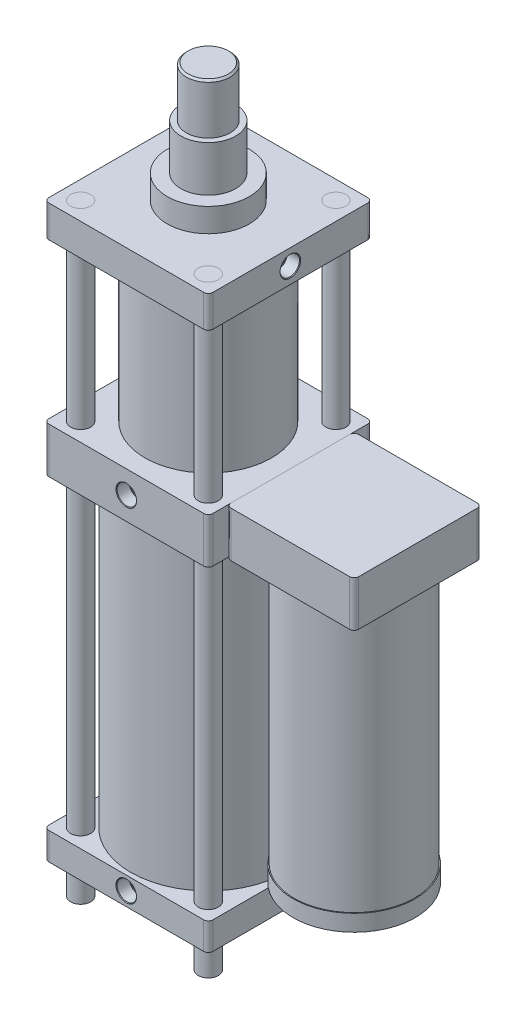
ISO-10303-21;
HEADER;
FILE_DESCRIPTION(('STEP AP214'),'2;1');
FILE_NAME('part.step','',(''),(''),'','','');
FILE_SCHEMA(('AUTOMOTIVE_DESIGN { 1 0 10303 214 1 1 1 1 }'));
ENDSEC;
DATA;
#1=APPLICATION_CONTEXT('core data for automotive mechanical design processes');
#2=APPLICATION_PROTOCOL_DEFINITION('international standard','automotive_design',2000,#1);
#3=PRODUCT_CONTEXT('',#1,'mechanical');
#4=PRODUCT('Part','Part','',(#3));
#5=PRODUCT_RELATED_PRODUCT_CATEGORY('part','',(#4));
#6=PRODUCT_DEFINITION_FORMATION('','',#4);
#7=PRODUCT_DEFINITION_CONTEXT('part definition',#1,'design');
#8=PRODUCT_DEFINITION('design','',#6,#7);
#9=PRODUCT_DEFINITION_SHAPE('','',#8);
#10=(LENGTH_UNIT() NAMED_UNIT(*) SI_UNIT(.MILLI.,.METRE.));
#11=(NAMED_UNIT(*) PLANE_ANGLE_UNIT() SI_UNIT($,.RADIAN.));
#12=(NAMED_UNIT(*) SI_UNIT($,.STERADIAN.) SOLID_ANGLE_UNIT());
#13=UNCERTAINTY_MEASURE_WITH_UNIT(LENGTH_MEASURE(1.E-05),#10,'distance_accuracy_value','');
#14=(GEOMETRIC_REPRESENTATION_CONTEXT(3) GLOBAL_UNCERTAINTY_ASSIGNED_CONTEXT((#13)) GLOBAL_UNIT_ASSIGNED_CONTEXT((#10,
#11,#12)) REPRESENTATION_CONTEXT('',''));
#15=CARTESIAN_POINT('',(0.,0.,0.));
#16=DIRECTION('',(0.,0.,1.));
#17=DIRECTION('',(1.,0.,0.));
#18=AXIS2_PLACEMENT_3D('',#15,#16,#17);
#19=CARTESIAN_POINT('',(70.,-626.,70.));
#20=DIRECTION('',(0.,1.,0.));
#21=DIRECTION('',(0.,0.,1.));
#22=AXIS2_PLACEMENT_3D('',#19,#20,#21);
#23=CYLINDRICAL_SURFACE('',#22,11.);
#24=CARTESIAN_POINT('',(70.,-626.,70.));
#25=DIRECTION('',(0.,-1.,0.));
#26=DIRECTION('',(0.,0.,-1.));
#27=AXIS2_PLACEMENT_3D('',#24,#25,#26);
#28=CIRCLE('',#27,11.);
#29=CARTESIAN_POINT('',(70.,-626.,59.));
#30=VERTEX_POINT('',#29);
#31=EDGE_CURVE('E11',#30,#30,#28,.T.);
#32=ORIENTED_EDGE('',*,*,#31,.F.);
#33=EDGE_LOOP('',(#32));
#34=FACE_BOUND('',#33,.T.);
#35=CARTESIAN_POINT('',(70.,35.,70.));
#36=DIRECTION('',(0.,1.,0.));
#37=DIRECTION('',(0.,0.,1.));
#38=AXIS2_PLACEMENT_3D('',#35,#36,#37);
#39=CIRCLE('',#38,11.);
#40=CARTESIAN_POINT('',(70.,35.,81.));
#41=VERTEX_POINT('',#40);
#42=EDGE_CURVE('E49',#41,#41,#39,.F.);
#43=ORIENTED_EDGE('',*,*,#42,.T.);
#44=EDGE_LOOP('',(#43));
#45=FACE_BOUND('',#44,.T.);
#46=ADVANCED_FACE('F43',(#34,#45),#23,.T.);
#47=CARTESIAN_POINT('',(70.,-626.,70.));
#48=DIRECTION('',(0.,-1.,0.));
#49=DIRECTION('',(0.,0.,-1.));
#50=AXIS2_PLACEMENT_3D('',#47,#48,#49);
#51=PLANE('',#50);
#52=ORIENTED_EDGE('',*,*,#31,.T.);
#53=EDGE_LOOP('',(#52));
#54=FACE_BOUND('',#53,.T.);
#55=ADVANCED_FACE('F58',(#54),#51,.T.);
#56=CARTESIAN_POINT('',(-85.,35.,85.));
#57=DIRECTION('',(0.,1.,0.));
#58=DIRECTION('',(0.,0.,1.));
#59=AXIS2_PLACEMENT_3D('',#56,#57,#58);
#60=PLANE('',#59);
#61=ORIENTED_EDGE('',*,*,#42,.F.);
#62=EDGE_LOOP('',(#61));
#63=FACE_BOUND('',#62,.T.);
#64=ADVANCED_FACE('F56',(#63),#60,.T.);
#65=CLOSED_SHELL('',(#46,#55,#64));
#66=MANIFOLD_SOLID_BREP('B2',#65);
#67=CARTESIAN_POINT('',(70.0000000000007,-626.,-69.9999999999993));
#68=DIRECTION('',(0.,1.,0.));
#69=DIRECTION('',(0.,0.,1.));
#70=AXIS2_PLACEMENT_3D('',#67,#68,#69);
#71=CYLINDRICAL_SURFACE('',#70,11.);
#72=CARTESIAN_POINT('',(70.0000000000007,-626.,-69.9999999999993));
#73=DIRECTION('',(0.,-1.,0.));
#74=DIRECTION('',(0.,0.,-1.));
#75=AXIS2_PLACEMENT_3D('',#72,#73,#74);
#76=CIRCLE('',#75,11.);
#77=CARTESIAN_POINT('',(70.0000000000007,-626.,-80.9999999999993));
#78=VERTEX_POINT('',#77);
#79=EDGE_CURVE('E42',#78,#78,#76,.T.);
#80=ORIENTED_EDGE('',*,*,#79,.F.);
#81=EDGE_LOOP('',(#80));
#82=FACE_BOUND('',#81,.T.);
#83=CARTESIAN_POINT('',(70.0000000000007,35.,-69.9999999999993));
#84=DIRECTION('',(0.,1.,0.));
#85=DIRECTION('',(0.,0.,1.));
#86=AXIS2_PLACEMENT_3D('',#83,#84,#85);
#87=CIRCLE('',#86,11.);
#88=CARTESIAN_POINT('',(70.0000000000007,35.,-58.9999999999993));
#89=VERTEX_POINT('',#88);
#90=EDGE_CURVE('E97',#89,#89,#87,.F.);
#91=ORIENTED_EDGE('',*,*,#90,.T.);
#92=EDGE_LOOP('',(#91));
#93=FACE_BOUND('',#92,.T.);
#94=ADVANCED_FACE('F91',(#82,#93),#71,.T.);
#95=CARTESIAN_POINT('',(70.0000000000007,-626.,-69.9999999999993));
#96=DIRECTION('',(0.,-1.,0.));
#97=DIRECTION('',(0.,0.,-1.));
#98=AXIS2_PLACEMENT_3D('',#95,#96,#97);
#99=PLANE('',#98);
#100=ORIENTED_EDGE('',*,*,#79,.T.);
#101=EDGE_LOOP('',(#100));
#102=FACE_BOUND('',#101,.T.);
#103=ADVANCED_FACE('F106',(#102),#99,.T.);
#104=CARTESIAN_POINT('',(-85.,35.,85.));
#105=DIRECTION('',(0.,1.,0.));
#106=DIRECTION('',(0.,0.,1.));
#107=AXIS2_PLACEMENT_3D('',#104,#105,#106);
#108=PLANE('',#107);
#109=ORIENTED_EDGE('',*,*,#90,.F.);
#110=EDGE_LOOP('',(#109));
#111=FACE_BOUND('',#110,.T.);
#112=ADVANCED_FACE('F104',(#111),#108,.T.);
#113=CLOSED_SHELL('',(#94,#103,#112));
#114=MANIFOLD_SOLID_BREP('B6',#113);
#115=CARTESIAN_POINT('',(-70.0000000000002,-626.,69.9999999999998));
#116=DIRECTION('',(0.,1.,0.));
#117=DIRECTION('',(0.,0.,1.));
#118=AXIS2_PLACEMENT_3D('',#115,#116,#117);
#119=CYLINDRICAL_SURFACE('',#118,11.);
#120=CARTESIAN_POINT('',(-70.0000000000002,-626.,69.9999999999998));
#121=DIRECTION('',(0.,-1.,0.));
#122=DIRECTION('',(0.,0.,-1.));
#123=AXIS2_PLACEMENT_3D('',#120,#121,#122);
#124=CIRCLE('',#123,11.);
#125=CARTESIAN_POINT('',(-70.0000000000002,-626.,58.9999999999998));
#126=VERTEX_POINT('',#125);
#127=EDGE_CURVE('E90',#126,#126,#124,.T.);
#128=ORIENTED_EDGE('',*,*,#127,.F.);
#129=EDGE_LOOP('',(#128));
#130=FACE_BOUND('',#129,.T.);
#131=CARTESIAN_POINT('',(-70.0000000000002,35.,69.9999999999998));
#132=DIRECTION('',(0.,1.,0.));
#133=DIRECTION('',(0.,0.,1.));
#134=AXIS2_PLACEMENT_3D('',#131,#132,#133);
#135=CIRCLE('',#134,11.);
#136=CARTESIAN_POINT('',(-70.0000000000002,35.,80.9999999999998));
#137=VERTEX_POINT('',#136);
#138=EDGE_CURVE('E145',#137,#137,#135,.F.);
#139=ORIENTED_EDGE('',*,*,#138,.T.);
#140=EDGE_LOOP('',(#139));
#141=FACE_BOUND('',#140,.T.);
#142=ADVANCED_FACE('F139',(#130,#141),#119,.T.);
#143=CARTESIAN_POINT('',(-70.0000000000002,-626.,69.9999999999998));
#144=DIRECTION('',(0.,-1.,0.));
#145=DIRECTION('',(0.,0.,-1.));
#146=AXIS2_PLACEMENT_3D('',#143,#144,#145);
#147=PLANE('',#146);
#148=ORIENTED_EDGE('',*,*,#127,.T.);
#149=EDGE_LOOP('',(#148));
#150=FACE_BOUND('',#149,.T.);
#151=ADVANCED_FACE('F154',(#150),#147,.T.);
#152=CARTESIAN_POINT('',(-85.,35.,85.));
#153=DIRECTION('',(0.,1.,0.));
#154=DIRECTION('',(0.,0.,1.));
#155=AXIS2_PLACEMENT_3D('',#152,#153,#154);
#156=PLANE('',#155);
#157=ORIENTED_EDGE('',*,*,#138,.F.);
#158=EDGE_LOOP('',(#157));
#159=FACE_BOUND('',#158,.T.);
#160=ADVANCED_FACE('F152',(#159),#156,.T.);
#161=CLOSED_SHELL('',(#142,#151,#160));
#162=MANIFOLD_SOLID_BREP('B37',#161);
#163=CARTESIAN_POINT('',(-69.9999999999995,-626.,-70.0000000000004));
#164=DIRECTION('',(0.,1.,0.));
#165=DIRECTION('',(0.,0.,1.));
#166=AXIS2_PLACEMENT_3D('',#163,#164,#165);
#167=CYLINDRICAL_SURFACE('',#166,11.);
#168=CARTESIAN_POINT('',(-69.9999999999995,-626.,-70.0000000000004));
#169=DIRECTION('',(0.,-1.,0.));
#170=DIRECTION('',(0.,0.,-1.));
#171=AXIS2_PLACEMENT_3D('',#168,#169,#170);
#172=CIRCLE('',#171,11.);
#173=CARTESIAN_POINT('',(-69.9999999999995,-626.,-81.0000000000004));
#174=VERTEX_POINT('',#173);
#175=EDGE_CURVE('E138',#174,#174,#172,.T.);
#176=ORIENTED_EDGE('',*,*,#175,.F.);
#177=EDGE_LOOP('',(#176));
#178=FACE_BOUND('',#177,.T.);
#179=CARTESIAN_POINT('',(-69.9999999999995,35.,-70.0000000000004));
#180=DIRECTION('',(0.,1.,0.));
#181=DIRECTION('',(0.,0.,1.));
#182=AXIS2_PLACEMENT_3D('',#179,#180,#181);
#183=CIRCLE('',#182,11.);
#184=CARTESIAN_POINT('',(-69.9999999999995,35.,-59.0000000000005));
#185=VERTEX_POINT('',#184);
#186=EDGE_CURVE('E195',#185,#185,#183,.F.);
#187=ORIENTED_EDGE('',*,*,#186,.T.);
#188=EDGE_LOOP('',(#187));
#189=FACE_BOUND('',#188,.T.);
#190=ADVANCED_FACE('F189',(#178,#189),#167,.T.);
#191=CARTESIAN_POINT('',(-69.9999999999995,-626.,-70.0000000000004));
#192=DIRECTION('',(0.,-1.,0.));
#193=DIRECTION('',(0.,0.,-1.));
#194=AXIS2_PLACEMENT_3D('',#191,#192,#193);
#195=PLANE('',#194);
#196=ORIENTED_EDGE('',*,*,#175,.T.);
#197=EDGE_LOOP('',(#196));
#198=FACE_BOUND('',#197,.T.);
#199=ADVANCED_FACE('F204',(#198),#195,.T.);
#200=CARTESIAN_POINT('',(-85.,35.,85.));
#201=DIRECTION('',(0.,1.,0.));
#202=DIRECTION('',(0.,0.,1.));
#203=AXIS2_PLACEMENT_3D('',#200,#201,#202);
#204=PLANE('',#203);
#205=ORIENTED_EDGE('',*,*,#186,.F.);
#206=EDGE_LOOP('',(#205));
#207=FACE_BOUND('',#206,.T.);
#208=ADVANCED_FACE('F202',(#207),#204,.T.);
#209=CLOSED_SHELL('',(#190,#199,#208));
#210=MANIFOLD_SOLID_BREP('B85',#209);
#211=CARTESIAN_POINT('',(168.660254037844,-545.,-15.));
#212=DIRECTION('',(-0.866025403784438,0.,0.5));
#213=DIRECTION('',(0.5,0.,0.866025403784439));
#214=AXIS2_PLACEMENT_3D('',#211,#212,#213);
#215=PLANE('',#214);
#216=DIRECTION('',(0.5,0.,0.866025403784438));
#217=VECTOR('',#216,1.);
#218=CARTESIAN_POINT('',(168.660254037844,-533.,-15.));
#219=LINE('',#218,#217);
#220=CARTESIAN_POINT('',(168.660254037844,-533.,-15.));
#221=VERTEX_POINT('',#220);
#222=CARTESIAN_POINT('',(177.320508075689,-533.,0.));
#223=VERTEX_POINT('',#222);
#224=EDGE_CURVE('E324',#221,#223,#219,.T.);
#225=ORIENTED_EDGE('',*,*,#224,.T.);
#226=DIRECTION('',(0.,1.,0.));
#227=VECTOR('',#226,1.);
#228=CARTESIAN_POINT('',(177.320508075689,-545.,0.));
#229=LINE('',#228,#227);
#230=CARTESIAN_POINT('',(177.320508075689,-545.,0.));
#231=VERTEX_POINT('',#230);
#232=EDGE_CURVE('E187',#231,#223,#229,.T.);
#233=ORIENTED_EDGE('',*,*,#232,.F.);
#234=DIRECTION('',(0.5,0.,0.866025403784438));
#235=VECTOR('',#234,1.);
#236=CARTESIAN_POINT('',(168.660254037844,-545.,-15.));
#237=LINE('',#236,#235);
#238=CARTESIAN_POINT('',(168.660254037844,-545.,-15.));
#239=VERTEX_POINT('',#238);
#240=EDGE_CURVE('E334',#239,#231,#237,.T.);
#241=ORIENTED_EDGE('',*,*,#240,.F.);
#242=DIRECTION('',(0.,1.,0.));
#243=VECTOR('',#242,1.);
#244=CARTESIAN_POINT('',(168.660254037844,-545.,-15.));
#245=LINE('',#244,#243);
#246=EDGE_CURVE('E320',#239,#221,#245,.T.);
#247=ORIENTED_EDGE('',*,*,#246,.T.);
#248=EDGE_LOOP('',(#225,#233,#241,#247));
#249=FACE_BOUND('',#248,.T.);
#250=ADVANCED_FACE('F239',(#249),#215,.F.);
#251=CARTESIAN_POINT('',(177.320508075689,-545.,0.));
#252=DIRECTION('',(-0.866025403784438,0.,-0.5));
#253=DIRECTION('',(-0.5,0.,0.866025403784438));
#254=AXIS2_PLACEMENT_3D('',#251,#252,#253);
#255=PLANE('',#254);
#256=DIRECTION('',(-0.5,0.,0.866025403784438));
#257=VECTOR('',#256,1.);
#258=CARTESIAN_POINT('',(177.320508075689,-533.,0.));
#259=LINE('',#258,#257);
#260=CARTESIAN_POINT('',(168.660254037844,-533.,14.9999999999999));
#261=VERTEX_POINT('',#260);
#262=EDGE_CURVE('E327',#223,#261,#259,.T.);
#263=ORIENTED_EDGE('',*,*,#262,.T.);
#264=DIRECTION('',(0.,1.,0.));
#265=VECTOR('',#264,1.);
#266=CARTESIAN_POINT('',(168.660254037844,-545.,14.9999999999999));
#267=LINE('',#266,#265);
#268=CARTESIAN_POINT('',(168.660254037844,-545.,14.9999999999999));
#269=VERTEX_POINT('',#268);
#270=EDGE_CURVE('E248',#269,#261,#267,.T.);
#271=ORIENTED_EDGE('',*,*,#270,.F.);
#272=DIRECTION('',(-0.5,0.,0.866025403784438));
#273=VECTOR('',#272,1.);
#274=CARTESIAN_POINT('',(177.320508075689,-545.,0.));
#275=LINE('',#274,#273);
#276=EDGE_CURVE('E293',#231,#269,#275,.T.);
#277=ORIENTED_EDGE('',*,*,#276,.F.);
#278=ORIENTED_EDGE('',*,*,#232,.T.);
#279=EDGE_LOOP('',(#263,#271,#277,#278));
#280=FACE_BOUND('',#279,.T.);
#281=ADVANCED_FACE('F361',(#280),#255,.F.);
#282=CARTESIAN_POINT('',(168.660254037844,-545.,14.9999999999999));
#283=DIRECTION('',(0.,0.,-1.));
#284=DIRECTION('',(-1.,0.,0.));
#285=AXIS2_PLACEMENT_3D('',#282,#283,#284);
#286=PLANE('',#285);
#287=DIRECTION('',(-1.,0.,0.));
#288=VECTOR('',#287,1.);
#289=CARTESIAN_POINT('',(168.660254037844,-533.,14.9999999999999));
#290=LINE('',#289,#288);
#291=CARTESIAN_POINT('',(151.339745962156,-533.,14.9999999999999));
#292=VERTEX_POINT('',#291);
#293=EDGE_CURVE('E329',#261,#292,#290,.T.);
#294=ORIENTED_EDGE('',*,*,#293,.T.);
#295=DIRECTION('',(0.,1.,0.));
#296=VECTOR('',#295,1.);
#297=CARTESIAN_POINT('',(151.339745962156,-545.,14.9999999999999));
#298=LINE('',#297,#296);
#299=CARTESIAN_POINT('',(151.339745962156,-545.,14.9999999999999));
#300=VERTEX_POINT('',#299);
#301=EDGE_CURVE('E315',#300,#292,#298,.T.);
#302=ORIENTED_EDGE('',*,*,#301,.F.);
#303=DIRECTION('',(-1.,0.,0.));
#304=VECTOR('',#303,1.);
#305=CARTESIAN_POINT('',(168.660254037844,-545.,14.9999999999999));
#306=LINE('',#305,#304);
#307=EDGE_CURVE('E306',#269,#300,#306,.T.);
#308=ORIENTED_EDGE('',*,*,#307,.F.);
#309=ORIENTED_EDGE('',*,*,#270,.T.);
#310=EDGE_LOOP('',(#294,#302,#308,#309));
#311=FACE_BOUND('',#310,.T.);
#312=ADVANCED_FACE('F341',(#311),#286,.F.);
#313=CARTESIAN_POINT('',(151.339745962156,-545.,14.9999999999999));
#314=DIRECTION('',(0.866025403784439,0.,-0.5));
#315=DIRECTION('',(-0.5,0.,-0.866025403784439));
#316=AXIS2_PLACEMENT_3D('',#313,#314,#315);
#317=PLANE('',#316);
#318=DIRECTION('',(-0.5,0.,-0.866025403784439));
#319=VECTOR('',#318,1.);
#320=CARTESIAN_POINT('',(151.339745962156,-533.,14.9999999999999));
#321=LINE('',#320,#319);
#322=CARTESIAN_POINT('',(142.679491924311,-533.,0.));
#323=VERTEX_POINT('',#322);
#324=EDGE_CURVE('E314',#292,#323,#321,.T.);
#325=ORIENTED_EDGE('',*,*,#324,.T.);
#326=DIRECTION('',(0.,1.,0.));
#327=VECTOR('',#326,1.);
#328=CARTESIAN_POINT('',(142.679491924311,-545.,0.));
#329=LINE('',#328,#327);
#330=CARTESIAN_POINT('',(142.679491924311,-545.,0.));
#331=VERTEX_POINT('',#330);
#332=EDGE_CURVE('E311',#331,#323,#329,.T.);
#333=ORIENTED_EDGE('',*,*,#332,.F.);
#334=DIRECTION('',(-0.5,0.,-0.866025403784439));
#335=VECTOR('',#334,1.);
#336=CARTESIAN_POINT('',(151.339745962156,-545.,14.9999999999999));
#337=LINE('',#336,#335);
#338=EDGE_CURVE('E300',#300,#331,#337,.T.);
#339=ORIENTED_EDGE('',*,*,#338,.F.);
#340=ORIENTED_EDGE('',*,*,#301,.T.);
#341=EDGE_LOOP('',(#325,#333,#339,#340));
#342=FACE_BOUND('',#341,.T.);
#343=ADVANCED_FACE('F312',(#342),#317,.F.);
#344=CARTESIAN_POINT('',(142.679491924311,-545.,0.));
#345=DIRECTION('',(0.866025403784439,0.,0.5));
#346=DIRECTION('',(0.5,0.,-0.866025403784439));
#347=AXIS2_PLACEMENT_3D('',#344,#345,#346);
#348=PLANE('',#347);
#349=DIRECTION('',(0.5,0.,-0.866025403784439));
#350=VECTOR('',#349,1.);
#351=CARTESIAN_POINT('',(142.679491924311,-533.,0.));
#352=LINE('',#351,#350);
#353=CARTESIAN_POINT('',(151.339745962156,-533.,-15.));
#354=VERTEX_POINT('',#353);
#355=EDGE_CURVE('E279',#323,#354,#352,.T.);
#356=ORIENTED_EDGE('',*,*,#355,.T.);
#357=DIRECTION('',(0.,1.,0.));
#358=VECTOR('',#357,1.);
#359=CARTESIAN_POINT('',(151.339745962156,-545.,-15.));
#360=LINE('',#359,#358);
#361=CARTESIAN_POINT('',(151.339745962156,-545.,-15.));
#362=VERTEX_POINT('',#361);
#363=EDGE_CURVE('E316',#362,#354,#360,.T.);
#364=ORIENTED_EDGE('',*,*,#363,.F.);
#365=DIRECTION('',(0.5,0.,-0.866025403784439));
#366=VECTOR('',#365,1.);
#367=CARTESIAN_POINT('',(142.679491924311,-545.,0.));
#368=LINE('',#367,#366);
#369=EDGE_CURVE('E304',#331,#362,#368,.T.);
#370=ORIENTED_EDGE('',*,*,#369,.F.);
#371=ORIENTED_EDGE('',*,*,#332,.T.);
#372=EDGE_LOOP('',(#356,#364,#370,#371));
#373=FACE_BOUND('',#372,.T.);
#374=ADVANCED_FACE('F318',(#373),#348,.F.);
#375=CARTESIAN_POINT('',(151.339745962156,-545.,-15.));
#376=DIRECTION('',(0.,0.,1.));
#377=DIRECTION('',(1.,0.,0.));
#378=AXIS2_PLACEMENT_3D('',#375,#376,#377);
#379=PLANE('',#378);
#380=DIRECTION('',(1.,0.,0.));
#381=VECTOR('',#380,1.);
#382=CARTESIAN_POINT('',(151.339745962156,-533.,-15.));
#383=LINE('',#382,#381);
#384=EDGE_CURVE('E285',#354,#221,#383,.T.);
#385=ORIENTED_EDGE('',*,*,#384,.T.);
#386=ORIENTED_EDGE('',*,*,#246,.F.);
#387=DIRECTION('',(1.,0.,0.));
#388=VECTOR('',#387,1.);
#389=CARTESIAN_POINT('',(151.339745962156,-545.,-15.));
#390=LINE('',#389,#388);
#391=EDGE_CURVE('E256',#362,#239,#390,.T.);
#392=ORIENTED_EDGE('',*,*,#391,.F.);
#393=ORIENTED_EDGE('',*,*,#363,.T.);
#394=EDGE_LOOP('',(#385,#386,#392,#393));
#395=FACE_BOUND('',#394,.T.);
#396=ADVANCED_FACE('F348',(#395),#379,.F.);
#397=CARTESIAN_POINT('',(0.,-545.,0.));
#398=DIRECTION('',(0.,-1.,0.));
#399=DIRECTION('',(0.,0.,-1.));
#400=AXIS2_PLACEMENT_3D('',#397,#398,#399);
#401=PLANE('',#400);
#402=CARTESIAN_POINT('',(160.,-545.,0.));
#403=DIRECTION('',(0.,-1.,0.));
#404=DIRECTION('',(0.,0.,-1.));
#405=AXIS2_PLACEMENT_3D('',#402,#403,#404);
#406=CIRCLE('',#405,11.3029619);
#407=CARTESIAN_POINT('',(160.,-545.,-11.3029619));
#408=VERTEX_POINT('',#407);
#409=EDGE_CURVE('E422',#408,#408,#406,.T.);
#410=ORIENTED_EDGE('',*,*,#409,.F.);
#411=EDGE_LOOP('',(#410));
#412=FACE_BOUND('',#411,.T.);
#413=ORIENTED_EDGE('',*,*,#240,.T.);
#414=ORIENTED_EDGE('',*,*,#276,.T.);
#415=ORIENTED_EDGE('',*,*,#307,.T.);
#416=ORIENTED_EDGE('',*,*,#338,.T.);
#417=ORIENTED_EDGE('',*,*,#369,.T.);
#418=ORIENTED_EDGE('',*,*,#391,.T.);
#419=EDGE_LOOP('',(#413,#414,#415,#416,#417,#418));
#420=FACE_BOUND('',#419,.T.);
#421=ADVANCED_FACE('F302',(#412,#420),#401,.T.);
#422=CARTESIAN_POINT('',(0.,-533.,0.));
#423=DIRECTION('',(0.,-1.,0.));
#424=DIRECTION('',(0.,0.,-1.));
#425=AXIS2_PLACEMENT_3D('',#422,#423,#424);
#426=PLANE('',#425);
#427=CARTESIAN_POINT('',(160.,-533.,0.));
#428=DIRECTION('',(0.,-1.,0.));
#429=DIRECTION('',(0.,0.,-1.));
#430=AXIS2_PLACEMENT_3D('',#427,#428,#429);
#431=CIRCLE('',#430,10.3276785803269);
#432=CARTESIAN_POINT('',(160.,-533.,-10.3276785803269));
#433=VERTEX_POINT('',#432);
#434=EDGE_CURVE('E242',#433,#433,#431,.T.);
#435=ORIENTED_EDGE('',*,*,#434,.T.);
#436=EDGE_LOOP('',(#435));
#437=FACE_BOUND('',#436,.T.);
#438=ORIENTED_EDGE('',*,*,#224,.F.);
#439=ORIENTED_EDGE('',*,*,#384,.F.);
#440=ORIENTED_EDGE('',*,*,#355,.F.);
#441=ORIENTED_EDGE('',*,*,#324,.F.);
#442=ORIENTED_EDGE('',*,*,#293,.F.);
#443=ORIENTED_EDGE('',*,*,#262,.F.);
#444=EDGE_LOOP('',(#438,#439,#440,#441,#442,#443));
#445=FACE_BOUND('',#444,.T.);
#446=ADVANCED_FACE('F344',(#437,#445),#426,.F.);
#447=CARTESIAN_POINT('',(160.,-544.365,0.));
#448=DIRECTION('',(0.,-1.,0.));
#449=DIRECTION('',(0.,0.,-1.));
#450=AXIS2_PLACEMENT_3D('',#447,#448,#449);
#451=CONICAL_SURFACE('',#450,10.6679619,0.0299323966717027);
#452=CARTESIAN_POINT('',(160.,-544.365,0.));
#453=DIRECTION('',(0.,-1.,0.));
#454=DIRECTION('',(0.,0.,-1.));
#455=AXIS2_PLACEMENT_3D('',#452,#453,#454);
#456=CIRCLE('',#455,10.6679619);
#457=CARTESIAN_POINT('',(160.,-544.365,-10.6679619));
#458=VERTEX_POINT('',#457);
#459=EDGE_CURVE('E419',#458,#458,#456,.T.);
#460=ORIENTED_EDGE('',*,*,#459,.T.);
#461=EDGE_LOOP('',(#460));
#462=FACE_BOUND('',#461,.T.);
#463=ORIENTED_EDGE('',*,*,#434,.F.);
#464=EDGE_LOOP('',(#463));
#465=FACE_BOUND('',#464,.T.);
#466=ADVANCED_FACE('F394',(#462,#465),#451,.F.);
#467=CARTESIAN_POINT('',(160.,-545.,0.));
#468=DIRECTION('',(0.,-1.,0.));
#469=DIRECTION('',(0.,0.,-1.));
#470=AXIS2_PLACEMENT_3D('',#467,#468,#469);
#471=CONICAL_SURFACE('',#470,11.3029619,0.785398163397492);
#472=ORIENTED_EDGE('',*,*,#459,.F.);
#473=EDGE_LOOP('',(#472));
#474=FACE_BOUND('',#473,.T.);
#475=ORIENTED_EDGE('',*,*,#409,.T.);
#476=EDGE_LOOP('',(#475));
#477=FACE_BOUND('',#476,.T.);
#478=ADVANCED_FACE('F402',(#474,#477),#471,.F.);
#479=CLOSED_SHELL('',(#250,#281,#312,#343,#374,#396,#421,#446,#466,#478));
#480=MANIFOLD_SOLID_BREP('B133',#479);
#481=CARTESIAN_POINT('',(160.,-533.,0.));
#482=DIRECTION('',(0.,1.,0.));
#483=DIRECTION('',(0.,0.,1.));
#484=AXIS2_PLACEMENT_3D('',#481,#482,#483);
#485=CYLINDRICAL_SURFACE('',#484,67.);
#486=CARTESIAN_POINT('',(160.,-533.,0.));
#487=DIRECTION('',(0.,-1.,0.));
#488=DIRECTION('',(0.,0.,-1.));
#489=AXIS2_PLACEMENT_3D('',#486,#487,#488);
#490=CIRCLE('',#489,67.);
#491=CARTESIAN_POINT('',(160.,-533.,-67.0000000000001));
#492=VERTEX_POINT('',#491);
#493=EDGE_CURVE('E237',#492,#492,#490,.T.);
#494=ORIENTED_EDGE('',*,*,#493,.F.);
#495=EDGE_LOOP('',(#494));
#496=FACE_BOUND('',#495,.T.);
#497=CARTESIAN_POINT('',(160.,-515.,0.));
#498=DIRECTION('',(0.,-1.,0.));
#499=DIRECTION('',(0.,0.,-1.));
#500=AXIS2_PLACEMENT_3D('',#497,#498,#499);
#501=CIRCLE('',#500,67.);
#502=CARTESIAN_POINT('',(160.,-515.,-67.0000000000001));
#503=VERTEX_POINT('',#502);
#504=EDGE_CURVE('E465',#503,#503,#501,.T.);
#505=ORIENTED_EDGE('',*,*,#504,.T.);
#506=EDGE_LOOP('',(#505));
#507=FACE_BOUND('',#506,.T.);
#508=ADVANCED_FACE('F458',(#496,#507),#485,.T.);
#509=CARTESIAN_POINT('',(160.,-533.,0.));
#510=DIRECTION('',(0.,-1.,0.));
#511=DIRECTION('',(0.,0.,-1.));
#512=AXIS2_PLACEMENT_3D('',#509,#510,#511);
#513=PLANE('',#512);
#514=CARTESIAN_POINT('',(160.,-533.,0.));
#515=DIRECTION('',(0.,-1.,0.));
#516=DIRECTION('',(0.,0.,-1.));
#517=AXIS2_PLACEMENT_3D('',#514,#515,#516);
#518=CIRCLE('',#517,10.3276785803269);
#519=CARTESIAN_POINT('',(160.,-533.,-10.3276785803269));
#520=VERTEX_POINT('',#519);
#521=EDGE_CURVE('E461',#520,#520,#518,.T.);
#522=ORIENTED_EDGE('',*,*,#521,.F.);
#523=EDGE_LOOP('',(#522));
#524=FACE_BOUND('',#523,.T.);
#525=ORIENTED_EDGE('',*,*,#493,.T.);
#526=EDGE_LOOP('',(#525));
#527=FACE_BOUND('',#526,.T.);
#528=ADVANCED_FACE('F491',(#524,#527),#513,.T.);
#529=CARTESIAN_POINT('',(160.,-515.,0.));
#530=DIRECTION('',(0.,-1.,0.));
#531=DIRECTION('',(0.,0.,-1.));
#532=AXIS2_PLACEMENT_3D('',#529,#530,#531);
#533=PLANE('',#532);
#534=ORIENTED_EDGE('',*,*,#504,.F.);
#535=EDGE_LOOP('',(#534));
#536=FACE_BOUND('',#535,.T.);
#537=ADVANCED_FACE('F473',(#536),#533,.F.);
#538=CARTESIAN_POINT('',(160.,-522.36,0.));
#539=DIRECTION('',(0.,-1.,0.));
#540=DIRECTION('',(0.,0.,-1.));
#541=AXIS2_PLACEMENT_3D('',#538,#539,#540);
#542=CONICAL_SURFACE('',#541,8.92809999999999,1.02974425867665);
#543=CARTESIAN_POINT('',(160.,-516.99545630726,0.));
#544=VERTEX_POINT('',#543);
#545=VERTEX_LOOP('',#544);
#546=FACE_BOUND('',#545,.T.);
#547=CARTESIAN_POINT('',(160.,-522.36,0.));
#548=DIRECTION('',(0.,-1.,0.));
#549=DIRECTION('',(0.,0.,-1.));
#550=AXIS2_PLACEMENT_3D('',#547,#548,#549);
#551=CIRCLE('',#550,8.92809999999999);
#552=CARTESIAN_POINT('',(160.,-522.36,-8.92810000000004));
#553=VERTEX_POINT('',#552);
#554=EDGE_CURVE('E477',#553,#553,#551,.T.);
#555=ORIENTED_EDGE('',*,*,#554,.T.);
#556=EDGE_LOOP('',(#555));
#557=FACE_BOUND('',#556,.T.);
#558=ADVANCED_FACE('F469',(#546,#557),#542,.F.);
#559=CARTESIAN_POINT('',(160.,-545.,0.));
#560=DIRECTION('',(0.,-1.,0.));
#561=DIRECTION('',(0.,0.,-1.));
#562=AXIS2_PLACEMENT_3D('',#559,#560,#561);
#563=CYLINDRICAL_SURFACE('',#562,8.92809999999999);
#564=ORIENTED_EDGE('',*,*,#554,.F.);
#565=EDGE_LOOP('',(#564));
#566=FACE_BOUND('',#565,.T.);
#567=CARTESIAN_POINT('',(160.,-531.43,0.));
#568=DIRECTION('',(0.,-1.,0.));
#569=DIRECTION('',(0.,0.,-1.));
#570=AXIS2_PLACEMENT_3D('',#567,#568,#569);
#571=CIRCLE('',#570,8.92809999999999);
#572=CARTESIAN_POINT('',(160.,-531.43,-8.92810000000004));
#573=VERTEX_POINT('',#572);
#574=EDGE_CURVE('E479',#573,#573,#571,.T.);
#575=ORIENTED_EDGE('',*,*,#574,.T.);
#576=EDGE_LOOP('',(#575));
#577=FACE_BOUND('',#576,.T.);
#578=ADVANCED_FACE('F472',(#566,#577),#563,.F.);
#579=CARTESIAN_POINT('',(168.9281,-531.43,0.));
#580=DIRECTION('',(0.,1.,0.));
#581=DIRECTION('',(0.,0.,1.));
#582=AXIS2_PLACEMENT_3D('',#579,#580,#581);
#583=PLANE('',#582);
#584=ORIENTED_EDGE('',*,*,#574,.F.);
#585=EDGE_LOOP('',(#584));
#586=FACE_BOUND('',#585,.T.);
#587=CARTESIAN_POINT('',(160.,-531.43,0.));
#588=DIRECTION('',(0.,-1.,0.));
#589=DIRECTION('',(0.,0.,-1.));
#590=AXIS2_PLACEMENT_3D('',#587,#588,#589);
#591=CIRCLE('',#590,10.2806706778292);
#592=CARTESIAN_POINT('',(160.,-531.43,-10.2806706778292));
#593=VERTEX_POINT('',#592);
#594=EDGE_CURVE('E483',#593,#593,#591,.T.);
#595=ORIENTED_EDGE('',*,*,#594,.T.);
#596=EDGE_LOOP('',(#595));
#597=FACE_BOUND('',#596,.T.);
#598=ADVANCED_FACE('F524',(#586,#597),#583,.F.);
#599=CARTESIAN_POINT('',(160.,-544.365,0.));
#600=DIRECTION('',(0.,-1.,0.));
#601=DIRECTION('',(0.,0.,-1.));
#602=AXIS2_PLACEMENT_3D('',#599,#600,#601);
#603=CONICAL_SURFACE('',#602,10.6679619,0.0299323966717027);
#604=ORIENTED_EDGE('',*,*,#521,.T.);
#605=EDGE_LOOP('',(#604));
#606=FACE_BOUND('',#605,.T.);
#607=ORIENTED_EDGE('',*,*,#594,.F.);
#608=EDGE_LOOP('',(#607));
#609=FACE_BOUND('',#608,.T.);
#610=ADVANCED_FACE('F533',(#606,#609),#603,.F.);
#611=CLOSED_SHELL('',(#508,#528,#537,#558,#578,#598,#610));
#612=MANIFOLD_SOLID_BREP('B181',#611);
#613=CARTESIAN_POINT('',(160.,-515.,0.));
#614=DIRECTION('',(0.,1.,0.));
#615=DIRECTION('',(0.,0.,1.));
#616=AXIS2_PLACEMENT_3D('',#613,#614,#615);
#617=CYLINDRICAL_SURFACE('',#616,66.);
#618=CARTESIAN_POINT('',(160.,-515.,0.));
#619=DIRECTION('',(0.,-1.,0.));
#620=DIRECTION('',(0.,0.,-1.));
#621=AXIS2_PLACEMENT_3D('',#618,#619,#620);
#622=CIRCLE('',#621,66.);
#623=CARTESIAN_POINT('',(160.,-515.,-66.0000000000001));
#624=VERTEX_POINT('',#623);
#625=EDGE_CURVE('E457',#624,#624,#622,.T.);
#626=ORIENTED_EDGE('',*,*,#625,.F.);
#627=EDGE_LOOP('',(#626));
#628=FACE_BOUND('',#627,.T.);
#629=CARTESIAN_POINT('',(160.,-225.,0.));
#630=DIRECTION('',(0.,-1.,0.));
#631=DIRECTION('',(0.,0.,-1.));
#632=AXIS2_PLACEMENT_3D('',#629,#630,#631);
#633=CIRCLE('',#632,66.);
#634=CARTESIAN_POINT('',(160.,-225.,-66.0000000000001));
#635=VERTEX_POINT('',#634);
#636=EDGE_CURVE('E573',#635,#635,#633,.T.);
#637=ORIENTED_EDGE('',*,*,#636,.T.);
#638=EDGE_LOOP('',(#637));
#639=FACE_BOUND('',#638,.T.);
#640=ADVANCED_FACE('F570',(#628,#639),#617,.T.);
#641=CARTESIAN_POINT('',(160.,-515.,0.));
#642=DIRECTION('',(0.,-1.,0.));
#643=DIRECTION('',(0.,0.,-1.));
#644=AXIS2_PLACEMENT_3D('',#641,#642,#643);
#645=PLANE('',#644);
#646=ORIENTED_EDGE('',*,*,#625,.T.);
#647=EDGE_LOOP('',(#646));
#648=FACE_BOUND('',#647,.T.);
#649=ADVANCED_FACE('F585',(#648),#645,.T.);
#650=CARTESIAN_POINT('',(160.,-225.,0.));
#651=DIRECTION('',(0.,-1.,0.));
#652=DIRECTION('',(0.,0.,-1.));
#653=AXIS2_PLACEMENT_3D('',#650,#651,#652);
#654=PLANE('',#653);
#655=ORIENTED_EDGE('',*,*,#636,.F.);
#656=EDGE_LOOP('',(#655));
#657=FACE_BOUND('',#656,.T.);
#658=ADVANCED_FACE('F583',(#657),#654,.F.);
#659=CLOSED_SHELL('',(#640,#649,#658));
#660=MANIFOLD_SOLID_BREP('B231',#659);
#661=CARTESIAN_POINT('',(-85.,-225.,-85.));
#662=DIRECTION('',(0.,-1.,0.));
#663=DIRECTION('',(0.,0.,-1.));
#664=AXIS2_PLACEMENT_3D('',#661,#662,#663);
#665=PLANE('',#664);
#666=CARTESIAN_POINT('',(95.,-225.,-65.));
#667=DIRECTION('',(0.,-1.,0.));
#668=DIRECTION('',(0.,0.,-1.));
#669=AXIS2_PLACEMENT_3D('',#666,#667,#668);
#670=CIRCLE('',#669,5.);
#671=CARTESIAN_POINT('',(95.0000000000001,-225.,-70.));
#672=VERTEX_POINT('',#671);
#673=CARTESIAN_POINT('',(90.,-225.,-65.));
#674=VERTEX_POINT('',#673);
#675=EDGE_CURVE('E628',#672,#674,#670,.F.);
#676=ORIENTED_EDGE('',*,*,#675,.F.);
#677=DIRECTION('',(-1.,0.,0.));
#678=VECTOR('',#677,1.);
#679=CARTESIAN_POINT('',(225.,-225.,-70.0000000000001));
#680=LINE('',#679,#678);
#681=CARTESIAN_POINT('',(225.,-225.,-70.0000000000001));
#682=VERTEX_POINT('',#681);
#683=EDGE_CURVE('E714',#682,#672,#680,.T.);
#684=ORIENTED_EDGE('',*,*,#683,.F.);
#685=CARTESIAN_POINT('',(225.,-225.,-65.0000000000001));
#686=DIRECTION('',(0.,-1.,0.));
#687=DIRECTION('',(0.,0.,-1.));
#688=AXIS2_PLACEMENT_3D('',#685,#686,#687);
#689=CIRCLE('',#688,5.);
#690=CARTESIAN_POINT('',(230.,-225.,-65.0000000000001));
#691=VERTEX_POINT('',#690);
#692=EDGE_CURVE('E718',#691,#682,#689,.F.);
#693=ORIENTED_EDGE('',*,*,#692,.F.);
#694=DIRECTION('',(0.,0.,-1.));
#695=VECTOR('',#694,1.);
#696=CARTESIAN_POINT('',(230.,-225.,64.9999999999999));
#697=LINE('',#696,#695);
#698=CARTESIAN_POINT('',(230.,-225.,64.9999999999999));
#699=VERTEX_POINT('',#698);
#700=EDGE_CURVE('E722',#699,#691,#697,.T.);
#701=ORIENTED_EDGE('',*,*,#700,.F.);
#702=CARTESIAN_POINT('',(225.,-225.,64.9999999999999));
#703=DIRECTION('',(0.,-1.,0.));
#704=DIRECTION('',(0.,0.,-1.));
#705=AXIS2_PLACEMENT_3D('',#702,#703,#704);
#706=CIRCLE('',#705,5.);
#707=CARTESIAN_POINT('',(225.,-225.,69.9999999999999));
#708=VERTEX_POINT('',#707);
#709=EDGE_CURVE('E726',#708,#699,#706,.F.);
#710=ORIENTED_EDGE('',*,*,#709,.F.);
#711=DIRECTION('',(1.,0.,0.));
#712=VECTOR('',#711,1.);
#713=CARTESIAN_POINT('',(225.,-225.,69.9999999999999));
#714=LINE('',#713,#712);
#715=CARTESIAN_POINT('',(95.0000000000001,-225.,70.));
#716=VERTEX_POINT('',#715);
#717=EDGE_CURVE('E663',#716,#708,#714,.T.);
#718=ORIENTED_EDGE('',*,*,#717,.F.);
#719=CARTESIAN_POINT('',(95.,-225.,64.9999999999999));
#720=DIRECTION('',(0.,-1.,0.));
#721=DIRECTION('',(0.,0.,-1.));
#722=AXIS2_PLACEMENT_3D('',#719,#720,#721);
#723=CIRCLE('',#722,5.);
#724=CARTESIAN_POINT('',(90.,-225.,64.9999999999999));
#725=VERTEX_POINT('',#724);
#726=EDGE_CURVE('E668',#725,#716,#723,.F.);
#727=ORIENTED_EDGE('',*,*,#726,.F.);
#728=DIRECTION('',(0.,0.,1.));
#729=VECTOR('',#728,1.);
#730=CARTESIAN_POINT('',(90.,-225.,64.9999999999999));
#731=LINE('',#730,#729);
#732=EDGE_CURVE('E695',#674,#725,#731,.T.);
#733=ORIENTED_EDGE('',*,*,#732,.F.);
#734=EDGE_LOOP('',(#676,#684,#693,#701,#710,#718,#727,#733));
#735=FACE_BOUND('',#734,.T.);
#736=ADVANCED_FACE('F620',(#735),#665,.T.);
#737=CARTESIAN_POINT('',(95.,-175.,-65.));
#738=DIRECTION('',(0.,1.,0.));
#739=DIRECTION('',(0.,0.,1.));
#740=AXIS2_PLACEMENT_3D('',#737,#738,#739);
#741=PLANE('',#740);
#742=CARTESIAN_POINT('',(95.,-175.,-65.));
#743=DIRECTION('',(0.,1.,0.));
#744=DIRECTION('',(0.,0.,1.));
#745=AXIS2_PLACEMENT_3D('',#742,#743,#744);
#746=CIRCLE('',#745,5.);
#747=CARTESIAN_POINT('',(95.0000000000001,-175.,-70.));
#748=VERTEX_POINT('',#747);
#749=CARTESIAN_POINT('',(90.,-175.,-65.));
#750=VERTEX_POINT('',#749);
#751=EDGE_CURVE('E705',#748,#750,#746,.T.);
#752=ORIENTED_EDGE('',*,*,#751,.T.);
#753=DIRECTION('',(0.,0.,1.));
#754=VECTOR('',#753,1.);
#755=CARTESIAN_POINT('',(90.,-175.,64.9999999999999));
#756=LINE('',#755,#754);
#757=CARTESIAN_POINT('',(90.,-175.,64.9999999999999));
#758=VERTEX_POINT('',#757);
#759=EDGE_CURVE('E693',#750,#758,#756,.T.);
#760=ORIENTED_EDGE('',*,*,#759,.T.);
#761=CARTESIAN_POINT('',(95.,-175.,64.9999999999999));
#762=DIRECTION('',(0.,1.,0.));
#763=DIRECTION('',(0.,0.,-1.));
#764=AXIS2_PLACEMENT_3D('',#761,#762,#763);
#765=CIRCLE('',#764,5.);
#766=CARTESIAN_POINT('',(95.0000000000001,-175.,70.));
#767=VERTEX_POINT('',#766);
#768=EDGE_CURVE('E697',#758,#767,#765,.T.);
#769=ORIENTED_EDGE('',*,*,#768,.T.);
#770=DIRECTION('',(1.,0.,0.));
#771=VECTOR('',#770,1.);
#772=CARTESIAN_POINT('',(225.,-175.,69.9999999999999));
#773=LINE('',#772,#771);
#774=CARTESIAN_POINT('',(225.,-175.,69.9999999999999));
#775=VERTEX_POINT('',#774);
#776=EDGE_CURVE('E701',#767,#775,#773,.T.);
#777=ORIENTED_EDGE('',*,*,#776,.T.);
#778=CARTESIAN_POINT('',(225.,-175.,64.9999999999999));
#779=DIRECTION('',(0.,1.,0.));
#780=DIRECTION('',(0.,0.,-1.));
#781=AXIS2_PLACEMENT_3D('',#778,#779,#780);
#782=CIRCLE('',#781,5.);
#783=CARTESIAN_POINT('',(230.,-175.,64.9999999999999));
#784=VERTEX_POINT('',#783);
#785=EDGE_CURVE('E743',#775,#784,#782,.T.);
#786=ORIENTED_EDGE('',*,*,#785,.T.);
#787=DIRECTION('',(0.,0.,-1.));
#788=VECTOR('',#787,1.);
#789=CARTESIAN_POINT('',(230.,-175.,64.9999999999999));
#790=LINE('',#789,#788);
#791=CARTESIAN_POINT('',(230.,-175.,-65.0000000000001));
#792=VERTEX_POINT('',#791);
#793=EDGE_CURVE('E748',#784,#792,#790,.T.);
#794=ORIENTED_EDGE('',*,*,#793,.T.);
#795=CARTESIAN_POINT('',(225.,-175.,-65.0000000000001));
#796=DIRECTION('',(0.,1.,0.));
#797=DIRECTION('',(0.,0.,1.));
#798=AXIS2_PLACEMENT_3D('',#795,#796,#797);
#799=CIRCLE('',#798,5.);
#800=CARTESIAN_POINT('',(225.,-175.,-70.0000000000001));
#801=VERTEX_POINT('',#800);
#802=EDGE_CURVE('E752',#792,#801,#799,.T.);
#803=ORIENTED_EDGE('',*,*,#802,.T.);
#804=DIRECTION('',(-1.,0.,0.));
#805=VECTOR('',#804,1.);
#806=CARTESIAN_POINT('',(225.,-175.,-70.0000000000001));
#807=LINE('',#806,#805);
#808=EDGE_CURVE('E711',#801,#748,#807,.T.);
#809=ORIENTED_EDGE('',*,*,#808,.T.);
#810=EDGE_LOOP('',(#752,#760,#769,#777,#786,#794,#803,#809));
#811=FACE_BOUND('',#810,.T.);
#812=ADVANCED_FACE('F703',(#811),#741,.T.);
#813=CARTESIAN_POINT('',(90.,-422.989898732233,64.9999999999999));
#814=DIRECTION('',(-1.,0.,0.));
#815=DIRECTION('',(0.,0.,1.));
#816=AXIS2_PLACEMENT_3D('',#813,#814,#815);
#817=PLANE('',#816);
#818=DIRECTION('',(0.,1.,0.));
#819=VECTOR('',#818,1.);
#820=CARTESIAN_POINT('',(90.,-422.989898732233,-65.));
#821=LINE('',#820,#819);
#822=EDGE_CURVE('E568',#674,#750,#821,.T.);
#823=ORIENTED_EDGE('',*,*,#822,.F.);
#824=ORIENTED_EDGE('',*,*,#732,.T.);
#825=DIRECTION('',(0.,1.,0.));
#826=VECTOR('',#825,1.);
#827=CARTESIAN_POINT('',(90.,-422.989898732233,64.9999999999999));
#828=LINE('',#827,#826);
#829=EDGE_CURVE('E690',#725,#758,#828,.T.);
#830=ORIENTED_EDGE('',*,*,#829,.T.);
#831=ORIENTED_EDGE('',*,*,#759,.F.);
#832=EDGE_LOOP('',(#823,#824,#830,#831));
#833=FACE_BOUND('',#832,.T.);
#834=ADVANCED_FACE('F691',(#833),#817,.T.);
#835=CARTESIAN_POINT('',(95.,-422.989898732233,64.9999999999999));
#836=DIRECTION('',(0.,1.,0.));
#837=DIRECTION('',(0.,0.,1.));
#838=AXIS2_PLACEMENT_3D('',#835,#836,#837);
#839=CYLINDRICAL_SURFACE('',#838,5.);
#840=ORIENTED_EDGE('',*,*,#829,.F.);
#841=ORIENTED_EDGE('',*,*,#726,.T.);
#842=DIRECTION('',(0.,1.,0.));
#843=VECTOR('',#842,1.);
#844=CARTESIAN_POINT('',(95.0000000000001,-422.989898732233,70.));
#845=LINE('',#844,#843);
#846=EDGE_CURVE('E685',#716,#767,#845,.T.);
#847=ORIENTED_EDGE('',*,*,#846,.T.);
#848=ORIENTED_EDGE('',*,*,#768,.F.);
#849=EDGE_LOOP('',(#840,#841,#847,#848));
#850=FACE_BOUND('',#849,.T.);
#851=ADVANCED_FACE('F698',(#850),#839,.T.);
#852=CARTESIAN_POINT('',(225.,-422.989898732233,69.9999999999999));
#853=DIRECTION('',(0.,0.,1.));
#854=DIRECTION('',(1.,0.,0.));
#855=AXIS2_PLACEMENT_3D('',#852,#853,#854);
#856=PLANE('',#855);
#857=ORIENTED_EDGE('',*,*,#846,.F.);
#858=ORIENTED_EDGE('',*,*,#717,.T.);
#859=DIRECTION('',(0.,1.,0.));
#860=VECTOR('',#859,1.);
#861=CARTESIAN_POINT('',(225.,-422.989898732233,69.9999999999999));
#862=LINE('',#861,#860);
#863=EDGE_CURVE('E729',#708,#775,#862,.T.);
#864=ORIENTED_EDGE('',*,*,#863,.T.);
#865=ORIENTED_EDGE('',*,*,#776,.F.);
#866=EDGE_LOOP('',(#857,#858,#864,#865));
#867=FACE_BOUND('',#866,.T.);
#868=ADVANCED_FACE('F740',(#867),#856,.T.);
#869=CARTESIAN_POINT('',(225.,-422.989898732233,64.9999999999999));
#870=DIRECTION('',(0.,1.,0.));
#871=DIRECTION('',(0.,0.,1.));
#872=AXIS2_PLACEMENT_3D('',#869,#870,#871);
#873=CYLINDRICAL_SURFACE('',#872,5.);
#874=ORIENTED_EDGE('',*,*,#863,.F.);
#875=ORIENTED_EDGE('',*,*,#709,.T.);
#876=DIRECTION('',(0.,1.,0.));
#877=VECTOR('',#876,1.);
#878=CARTESIAN_POINT('',(230.,-422.989898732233,64.9999999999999));
#879=LINE('',#878,#877);
#880=EDGE_CURVE('E725',#699,#784,#879,.T.);
#881=ORIENTED_EDGE('',*,*,#880,.T.);
#882=ORIENTED_EDGE('',*,*,#785,.F.);
#883=EDGE_LOOP('',(#874,#875,#881,#882));
#884=FACE_BOUND('',#883,.T.);
#885=ADVANCED_FACE('F744',(#884),#873,.T.);
#886=CARTESIAN_POINT('',(230.,-422.989898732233,64.9999999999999));
#887=DIRECTION('',(1.,0.,0.));
#888=DIRECTION('',(0.,0.,-1.));
#889=AXIS2_PLACEMENT_3D('',#886,#887,#888);
#890=PLANE('',#889);
#891=ORIENTED_EDGE('',*,*,#880,.F.);
#892=ORIENTED_EDGE('',*,*,#700,.T.);
#893=DIRECTION('',(0.,1.,0.));
#894=VECTOR('',#893,1.);
#895=CARTESIAN_POINT('',(230.,-422.989898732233,-65.0000000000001));
#896=LINE('',#895,#894);
#897=EDGE_CURVE('E721',#691,#792,#896,.T.);
#898=ORIENTED_EDGE('',*,*,#897,.T.);
#899=ORIENTED_EDGE('',*,*,#793,.F.);
#900=EDGE_LOOP('',(#891,#892,#898,#899));
#901=FACE_BOUND('',#900,.T.);
#902=ADVANCED_FACE('F777',(#901),#890,.T.);
#903=CARTESIAN_POINT('',(225.,-422.989898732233,-65.0000000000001));
#904=DIRECTION('',(0.,1.,0.));
#905=DIRECTION('',(0.,0.,1.));
#906=AXIS2_PLACEMENT_3D('',#903,#904,#905);
#907=CYLINDRICAL_SURFACE('',#906,5.);
#908=ORIENTED_EDGE('',*,*,#897,.F.);
#909=ORIENTED_EDGE('',*,*,#692,.T.);
#910=DIRECTION('',(0.,1.,0.));
#911=VECTOR('',#910,1.);
#912=CARTESIAN_POINT('',(225.,-422.989898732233,-70.0000000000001));
#913=LINE('',#912,#911);
#914=EDGE_CURVE('E717',#682,#801,#913,.T.);
#915=ORIENTED_EDGE('',*,*,#914,.T.);
#916=ORIENTED_EDGE('',*,*,#802,.F.);
#917=EDGE_LOOP('',(#908,#909,#915,#916));
#918=FACE_BOUND('',#917,.T.);
#919=ADVANCED_FACE('F767',(#918),#907,.T.);
#920=CARTESIAN_POINT('',(225.,-422.989898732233,-70.0000000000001));
#921=DIRECTION('',(0.,0.,-1.));
#922=DIRECTION('',(-1.,0.,0.));
#923=AXIS2_PLACEMENT_3D('',#920,#921,#922);
#924=PLANE('',#923);
#925=ORIENTED_EDGE('',*,*,#914,.F.);
#926=ORIENTED_EDGE('',*,*,#683,.T.);
#927=DIRECTION('',(0.,1.,0.));
#928=VECTOR('',#927,1.);
#929=CARTESIAN_POINT('',(95.0000000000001,-422.989898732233,-70.));
#930=LINE('',#929,#928);
#931=EDGE_CURVE('E713',#672,#748,#930,.T.);
#932=ORIENTED_EDGE('',*,*,#931,.T.);
#933=ORIENTED_EDGE('',*,*,#808,.F.);
#934=EDGE_LOOP('',(#925,#926,#932,#933));
#935=FACE_BOUND('',#934,.T.);
#936=ADVANCED_FACE('F759',(#935),#924,.T.);
#937=CARTESIAN_POINT('',(95.,-422.989898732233,-65.));
#938=DIRECTION('',(0.,1.,0.));
#939=DIRECTION('',(0.,0.,1.));
#940=AXIS2_PLACEMENT_3D('',#937,#938,#939);
#941=CYLINDRICAL_SURFACE('',#940,5.);
#942=ORIENTED_EDGE('',*,*,#931,.F.);
#943=ORIENTED_EDGE('',*,*,#675,.T.);
#944=ORIENTED_EDGE('',*,*,#822,.T.);
#945=ORIENTED_EDGE('',*,*,#751,.F.);
#946=EDGE_LOOP('',(#942,#943,#944,#945));
#947=FACE_BOUND('',#946,.T.);
#948=ADVANCED_FACE('F761',(#947),#941,.T.);
#949=CLOSED_SHELL('',(#736,#812,#834,#851,#868,#885,#902,#919,#936,#948));
#950=MANIFOLD_SOLID_BREP('B452',#949);
#951=CARTESIAN_POINT('',(0.,-175.,0.));
#952=DIRECTION('',(0.,1.,0.));
#953=DIRECTION('',(0.,0.,1.));
#954=AXIS2_PLACEMENT_3D('',#951,#952,#953);
#955=CYLINDRICAL_SURFACE('',#954,69.5);
#956=CARTESIAN_POINT('',(0.,-175.,0.));
#957=DIRECTION('',(0.,-1.,0.));
#958=DIRECTION('',(0.,0.,-1.));
#959=AXIS2_PLACEMENT_3D('',#956,#957,#958);
#960=CIRCLE('',#959,69.5);
#961=CARTESIAN_POINT('',(0.,-175.,-69.5));
#962=VERTEX_POINT('',#961);
#963=EDGE_CURVE('E618',#962,#962,#960,.T.);
#964=ORIENTED_EDGE('',*,*,#963,.F.);
#965=EDGE_LOOP('',(#964));
#966=FACE_BOUND('',#965,.T.);
#967=CARTESIAN_POINT('',(0.,0.,0.));
#968=DIRECTION('',(0.,-1.,0.));
#969=DIRECTION('',(0.,0.,-1.));
#970=AXIS2_PLACEMENT_3D('',#967,#968,#969);
#971=CIRCLE('',#970,69.5);
#972=CARTESIAN_POINT('',(0.,0.,-69.5));
#973=VERTEX_POINT('',#972);
#974=EDGE_CURVE('E860',#973,#973,#971,.T.);
#975=ORIENTED_EDGE('',*,*,#974,.T.);
#976=EDGE_LOOP('',(#975));
#977=FACE_BOUND('',#976,.T.);
#978=ADVANCED_FACE('F857',(#966,#977),#955,.T.);
#979=CARTESIAN_POINT('',(0.,0.,0.));
#980=DIRECTION('',(0.,-1.,0.));
#981=DIRECTION('',(0.,0.,-1.));
#982=AXIS2_PLACEMENT_3D('',#979,#980,#981);
#983=PLANE('',#982);
#984=ORIENTED_EDGE('',*,*,#974,.F.);
#985=EDGE_LOOP('',(#984));
#986=FACE_BOUND('',#985,.T.);
#987=ADVANCED_FACE('F993',(#986),#983,.F.);
#988=CARTESIAN_POINT('',(-85.,-225.,-85.));
#989=DIRECTION('',(0.,-1.,0.));
#990=DIRECTION('',(0.,0.,-1.));
#991=AXIS2_PLACEMENT_3D('',#988,#989,#990);
#992=PLANE('',#991);
#993=CARTESIAN_POINT('',(0.,-225.,0.));
#994=DIRECTION('',(0.,-1.,0.));
#995=DIRECTION('',(0.,0.,-1.));
#996=AXIS2_PLACEMENT_3D('',#993,#994,#995);
#997=CIRCLE('',#996,85.);
#998=CARTESIAN_POINT('',(0.,-225.,85.));
#999=VERTEX_POINT('',#998);
#1000=EDGE_CURVE('E1355',#999,#999,#997,.T.);
#1001=ORIENTED_EDGE('',*,*,#1000,.F.);
#1002=EDGE_LOOP('',(#1001));
#1003=FACE_BOUND('',#1002,.T.);
#1004=CARTESIAN_POINT('',(70.,-225.,70.));
#1005=DIRECTION('',(0.,-1.,0.));
#1006=DIRECTION('',(0.,0.,-1.));
#1007=AXIS2_PLACEMENT_3D('',#1004,#1005,#1006);
#1008=CIRCLE('',#1007,11.);
#1009=CARTESIAN_POINT('',(70.,-225.,59.));
#1010=VERTEX_POINT('',#1009);
#1011=EDGE_CURVE('E1368',#1010,#1010,#1008,.T.);
#1012=ORIENTED_EDGE('',*,*,#1011,.F.);
#1013=EDGE_LOOP('',(#1012));
#1014=FACE_BOUND('',#1013,.T.);
#1015=CARTESIAN_POINT('',(70.0000000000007,-225.,-69.9999999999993));
#1016=DIRECTION('',(0.,-1.,0.));
#1017=DIRECTION('',(0.,0.,-1.));
#1018=AXIS2_PLACEMENT_3D('',#1015,#1016,#1017);
#1019=CIRCLE('',#1018,11.);
#1020=CARTESIAN_POINT('',(70.0000000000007,-225.,-80.9999999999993));
#1021=VERTEX_POINT('',#1020);
#1022=EDGE_CURVE('E963',#1021,#1021,#1019,.T.);
#1023=ORIENTED_EDGE('',*,*,#1022,.F.);
#1024=EDGE_LOOP('',(#1023));
#1025=FACE_BOUND('',#1024,.T.);
#1026=CARTESIAN_POINT('',(-85.,-225.,-85.));
#1027=DIRECTION('',(0.,-1.,0.));
#1028=DIRECTION('',(0.,0.,-1.));
#1029=AXIS2_PLACEMENT_3D('',#1026,#1027,#1028);
#1030=CIRCLE('',#1029,5.);
#1031=CARTESIAN_POINT('',(-90.,-225.,-85.));
#1032=VERTEX_POINT('',#1031);
#1033=CARTESIAN_POINT('',(-85.,-225.,-90.));
#1034=VERTEX_POINT('',#1033);
#1035=EDGE_CURVE('E974',#1032,#1034,#1030,.T.);
#1036=ORIENTED_EDGE('',*,*,#1035,.T.);
#1037=DIRECTION('',(1.,0.,0.));
#1038=VECTOR('',#1037,1.);
#1039=CARTESIAN_POINT('',(85.,-225.,-90.));
#1040=LINE('',#1039,#1038);
#1041=CARTESIAN_POINT('',(85.,-225.,-90.));
#1042=VERTEX_POINT('',#1041);
#1043=EDGE_CURVE('E918',#1034,#1042,#1040,.T.);
#1044=ORIENTED_EDGE('',*,*,#1043,.T.);
#1045=CARTESIAN_POINT('',(85.,-225.,-85.));
#1046=DIRECTION('',(0.,-1.,0.));
#1047=DIRECTION('',(0.,0.,-1.));
#1048=AXIS2_PLACEMENT_3D('',#1045,#1046,#1047);
#1049=CIRCLE('',#1048,5.);
#1050=CARTESIAN_POINT('',(90.,-225.,-85.));
#1051=VERTEX_POINT('',#1050);
#1052=EDGE_CURVE('E1386',#1042,#1051,#1049,.T.);
#1053=ORIENTED_EDGE('',*,*,#1052,.T.);
#1054=DIRECTION('',(0.,0.,1.));
#1055=VECTOR('',#1054,1.);
#1056=CARTESIAN_POINT('',(90.,-225.,84.9999999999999));
#1057=LINE('',#1056,#1055);
#1058=CARTESIAN_POINT('',(90.,-225.,84.9999999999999));
#1059=VERTEX_POINT('',#1058);
#1060=EDGE_CURVE('E1388',#1051,#1059,#1057,.T.);
#1061=ORIENTED_EDGE('',*,*,#1060,.T.);
#1062=CARTESIAN_POINT('',(85.,-225.,84.9999999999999));
#1063=DIRECTION('',(0.,-1.,0.));
#1064=DIRECTION('',(0.,0.,-1.));
#1065=AXIS2_PLACEMENT_3D('',#1062,#1063,#1064);
#1066=CIRCLE('',#1065,5.);
#1067=CARTESIAN_POINT('',(85.,-225.,89.9999999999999));
#1068=VERTEX_POINT('',#1067);
#1069=EDGE_CURVE('E941',#1059,#1068,#1066,.T.);
#1070=ORIENTED_EDGE('',*,*,#1069,.T.);
#1071=DIRECTION('',(-1.,0.,0.));
#1072=VECTOR('',#1071,1.);
#1073=CARTESIAN_POINT('',(-84.9999999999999,-225.,90.));
#1074=LINE('',#1073,#1072);
#1075=CARTESIAN_POINT('',(-84.9999999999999,-225.,90.));
#1076=VERTEX_POINT('',#1075);
#1077=EDGE_CURVE('E934',#1068,#1076,#1074,.T.);
#1078=ORIENTED_EDGE('',*,*,#1077,.T.);
#1079=CARTESIAN_POINT('',(-85.,-225.,85.));
#1080=DIRECTION('',(0.,-1.,0.));
#1081=DIRECTION('',(0.,0.,-1.));
#1082=AXIS2_PLACEMENT_3D('',#1079,#1080,#1081);
#1083=CIRCLE('',#1082,5.);
#1084=CARTESIAN_POINT('',(-90.,-225.,85.));
#1085=VERTEX_POINT('',#1084);
#1086=EDGE_CURVE('E939',#1076,#1085,#1083,.T.);
#1087=ORIENTED_EDGE('',*,*,#1086,.T.);
#1088=DIRECTION('',(0.,0.,-1.));
#1089=VECTOR('',#1088,1.);
#1090=CARTESIAN_POINT('',(-90.,-225.,-85.));
#1091=LINE('',#1090,#1089);
#1092=EDGE_CURVE('E873',#1085,#1032,#1091,.T.);
#1093=ORIENTED_EDGE('',*,*,#1092,.T.);
#1094=EDGE_LOOP('',(#1036,#1044,#1053,#1061,#1070,#1078,#1087,#1093));
#1095=FACE_BOUND('',#1094,.T.);
#1096=CARTESIAN_POINT('',(-69.9999999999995,-225.,-70.0000000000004));
#1097=DIRECTION('',(0.,-1.,0.));
#1098=DIRECTION('',(0.,0.,-1.));
#1099=AXIS2_PLACEMENT_3D('',#1096,#1097,#1098);
#1100=CIRCLE('',#1099,11.);
#1101=CARTESIAN_POINT('',(-69.9999999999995,-225.,-81.0000000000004));
#1102=VERTEX_POINT('',#1101);
#1103=EDGE_CURVE('E1374',#1102,#1102,#1100,.T.);
#1104=ORIENTED_EDGE('',*,*,#1103,.F.);
#1105=EDGE_LOOP('',(#1104));
#1106=FACE_BOUND('',#1105,.T.);
#1107=CARTESIAN_POINT('',(-70.0000000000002,-225.,69.9999999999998));
#1108=DIRECTION('',(0.,-1.,0.));
#1109=DIRECTION('',(0.,0.,-1.));
#1110=AXIS2_PLACEMENT_3D('',#1107,#1108,#1109);
#1111=CIRCLE('',#1110,11.);
#1112=CARTESIAN_POINT('',(-70.0000000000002,-225.,58.9999999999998));
#1113=VERTEX_POINT('',#1112);
#1114=EDGE_CURVE('E1362',#1113,#1113,#1111,.T.);
#1115=ORIENTED_EDGE('',*,*,#1114,.F.);
#1116=EDGE_LOOP('',(#1115));
#1117=FACE_BOUND('',#1116,.T.);
#1118=ADVANCED_FACE('F936',(#1003,#1014,#1025,#1095,#1106,#1117),#992,.T.);
#1119=CARTESIAN_POINT('',(-85.,-175.,-85.));
#1120=DIRECTION('',(0.,-1.,0.));
#1121=DIRECTION('',(0.,0.,-1.));
#1122=AXIS2_PLACEMENT_3D('',#1119,#1120,#1121);
#1123=PLANE('',#1122);
#1124=ORIENTED_EDGE('',*,*,#963,.T.);
#1125=EDGE_LOOP('',(#1124));
#1126=FACE_BOUND('',#1125,.T.);
#1127=CARTESIAN_POINT('',(-85.,-175.,-85.));
#1128=DIRECTION('',(0.,-1.,0.));
#1129=DIRECTION('',(0.,0.,-1.));
#1130=AXIS2_PLACEMENT_3D('',#1127,#1128,#1129);
#1131=CIRCLE('',#1130,5.);
#1132=CARTESIAN_POINT('',(-90.,-175.,-85.));
#1133=VERTEX_POINT('',#1132);
#1134=CARTESIAN_POINT('',(-85.,-175.,-90.));
#1135=VERTEX_POINT('',#1134);
#1136=EDGE_CURVE('E959',#1133,#1135,#1131,.T.);
#1137=ORIENTED_EDGE('',*,*,#1136,.F.);
#1138=DIRECTION('',(0.,0.,-1.));
#1139=VECTOR('',#1138,1.);
#1140=CARTESIAN_POINT('',(-90.,-175.,-85.));
#1141=LINE('',#1140,#1139);
#1142=CARTESIAN_POINT('',(-90.,-175.,85.));
#1143=VERTEX_POINT('',#1142);
#1144=EDGE_CURVE('E909',#1143,#1133,#1141,.T.);
#1145=ORIENTED_EDGE('',*,*,#1144,.F.);
#1146=CARTESIAN_POINT('',(-85.,-175.,85.));
#1147=DIRECTION('',(0.,-1.,0.));
#1148=DIRECTION('',(0.,0.,-1.));
#1149=AXIS2_PLACEMENT_3D('',#1146,#1147,#1148);
#1150=CIRCLE('',#1149,5.);
#1151=CARTESIAN_POINT('',(-84.9999999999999,-175.,90.));
#1152=VERTEX_POINT('',#1151);
#1153=EDGE_CURVE('E903',#1152,#1143,#1150,.T.);
#1154=ORIENTED_EDGE('',*,*,#1153,.F.);
#1155=DIRECTION('',(-1.,0.,0.));
#1156=VECTOR('',#1155,1.);
#1157=CARTESIAN_POINT('',(-84.9999999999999,-175.,90.));
#1158=LINE('',#1157,#1156);
#1159=CARTESIAN_POINT('',(85.,-175.,89.9999999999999));
#1160=VERTEX_POINT('',#1159);
#1161=EDGE_CURVE('E949',#1160,#1152,#1158,.T.);
#1162=ORIENTED_EDGE('',*,*,#1161,.F.);
#1163=CARTESIAN_POINT('',(85.,-175.,84.9999999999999));
#1164=DIRECTION('',(0.,-1.,0.));
#1165=DIRECTION('',(0.,0.,-1.));
#1166=AXIS2_PLACEMENT_3D('',#1163,#1164,#1165);
#1167=CIRCLE('',#1166,5.);
#1168=CARTESIAN_POINT('',(90.,-175.,84.9999999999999));
#1169=VERTEX_POINT('',#1168);
#1170=EDGE_CURVE('E969',#1169,#1160,#1167,.T.);
#1171=ORIENTED_EDGE('',*,*,#1170,.F.);
#1172=DIRECTION('',(0.,0.,1.));
#1173=VECTOR('',#1172,1.);
#1174=CARTESIAN_POINT('',(90.,-175.,84.9999999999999));
#1175=LINE('',#1174,#1173);
#1176=CARTESIAN_POINT('',(90.,-175.,-85.));
#1177=VERTEX_POINT('',#1176);
#1178=EDGE_CURVE('E967',#1177,#1169,#1175,.T.);
#1179=ORIENTED_EDGE('',*,*,#1178,.F.);
#1180=CARTESIAN_POINT('',(85.,-175.,-85.));
#1181=DIRECTION('',(0.,-1.,0.));
#1182=DIRECTION('',(0.,0.,-1.));
#1183=AXIS2_PLACEMENT_3D('',#1180,#1181,#1182);
#1184=CIRCLE('',#1183,5.);
#1185=CARTESIAN_POINT('',(85.,-175.,-90.));
#1186=VERTEX_POINT('',#1185);
#1187=EDGE_CURVE('E965',#1186,#1177,#1184,.T.);
#1188=ORIENTED_EDGE('',*,*,#1187,.F.);
#1189=DIRECTION('',(1.,0.,0.));
#1190=VECTOR('',#1189,1.);
#1191=CARTESIAN_POINT('',(85.,-175.,-90.));
#1192=LINE('',#1191,#1190);
#1193=EDGE_CURVE('E962',#1135,#1186,#1192,.T.);
#1194=ORIENTED_EDGE('',*,*,#1193,.F.);
#1195=EDGE_LOOP('',(#1137,#1145,#1154,#1162,#1171,#1179,#1188,#1194));
#1196=FACE_BOUND('',#1195,.T.);
#1197=CARTESIAN_POINT('',(70.0000000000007,-175.,-69.9999999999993));
#1198=DIRECTION('',(0.,-1.,0.));
#1199=DIRECTION('',(0.,0.,-1.));
#1200=AXIS2_PLACEMENT_3D('',#1197,#1198,#1199);
#1201=CIRCLE('',#1200,11.);
#1202=CARTESIAN_POINT('',(70.0000000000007,-175.,-80.9999999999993));
#1203=VERTEX_POINT('',#1202);
#1204=EDGE_CURVE('E1377',#1203,#1203,#1201,.T.);
#1205=ORIENTED_EDGE('',*,*,#1204,.T.);
#1206=EDGE_LOOP('',(#1205));
#1207=FACE_BOUND('',#1206,.T.);
#1208=CARTESIAN_POINT('',(-69.9999999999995,-175.,-70.0000000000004));
#1209=DIRECTION('',(0.,-1.,0.));
#1210=DIRECTION('',(0.,0.,-1.));
#1211=AXIS2_PLACEMENT_3D('',#1208,#1209,#1210);
#1212=CIRCLE('',#1211,11.);
#1213=CARTESIAN_POINT('',(-69.9999999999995,-175.,-81.0000000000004));
#1214=VERTEX_POINT('',#1213);
#1215=EDGE_CURVE('E1371',#1214,#1214,#1212,.T.);
#1216=ORIENTED_EDGE('',*,*,#1215,.T.);
#1217=EDGE_LOOP('',(#1216));
#1218=FACE_BOUND('',#1217,.T.);
#1219=CARTESIAN_POINT('',(70.,-175.,70.));
#1220=DIRECTION('',(0.,-1.,0.));
#1221=DIRECTION('',(0.,0.,-1.));
#1222=AXIS2_PLACEMENT_3D('',#1219,#1220,#1221);
#1223=CIRCLE('',#1222,11.);
#1224=CARTESIAN_POINT('',(70.,-175.,59.));
#1225=VERTEX_POINT('',#1224);
#1226=EDGE_CURVE('E1365',#1225,#1225,#1223,.T.);
#1227=ORIENTED_EDGE('',*,*,#1226,.T.);
#1228=EDGE_LOOP('',(#1227));
#1229=FACE_BOUND('',#1228,.T.);
#1230=CARTESIAN_POINT('',(-70.0000000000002,-175.,69.9999999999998));
#1231=DIRECTION('',(0.,-1.,0.));
#1232=DIRECTION('',(0.,0.,-1.));
#1233=AXIS2_PLACEMENT_3D('',#1230,#1231,#1232);
#1234=CIRCLE('',#1233,11.);
#1235=CARTESIAN_POINT('',(-70.0000000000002,-175.,58.9999999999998));
#1236=VERTEX_POINT('',#1235);
#1237=EDGE_CURVE('E1359',#1236,#1236,#1234,.T.);
#1238=ORIENTED_EDGE('',*,*,#1237,.T.);
#1239=EDGE_LOOP('',(#1238));
#1240=FACE_BOUND('',#1239,.T.);
#1241=ADVANCED_FACE('F1000',(#1126,#1196,#1207,#1218,#1229,#1240),#1123,.F.);
#1242=CARTESIAN_POINT('',(-85.,-225.,-85.));
#1243=DIRECTION('',(0.,1.,0.));
#1244=DIRECTION('',(0.,0.,1.));
#1245=AXIS2_PLACEMENT_3D('',#1242,#1243,#1244);
#1246=CYLINDRICAL_SURFACE('',#1245,5.);
#1247=ORIENTED_EDGE('',*,*,#1136,.T.);
#1248=DIRECTION('',(0.,1.,0.));
#1249=VECTOR('',#1248,1.);
#1250=CARTESIAN_POINT('',(-85.,-225.,-90.));
#1251=LINE('',#1250,#1249);
#1252=EDGE_CURVE('E987',#1034,#1135,#1251,.T.);
#1253=ORIENTED_EDGE('',*,*,#1252,.F.);
#1254=ORIENTED_EDGE('',*,*,#1035,.F.);
#1255=DIRECTION('',(0.,1.,0.));
#1256=VECTOR('',#1255,1.);
#1257=CARTESIAN_POINT('',(-90.,-225.,-85.));
#1258=LINE('',#1257,#1256);
#1259=EDGE_CURVE('E955',#1032,#1133,#1258,.T.);
#1260=ORIENTED_EDGE('',*,*,#1259,.T.);
#1261=EDGE_LOOP('',(#1247,#1253,#1254,#1260));
#1262=FACE_BOUND('',#1261,.T.);
#1263=ADVANCED_FACE('F1006',(#1262),#1246,.T.);
#1264=CARTESIAN_POINT('',(85.,-225.,-90.));
#1265=DIRECTION('',(0.,0.,1.));
#1266=DIRECTION('',(1.,0.,0.));
#1267=AXIS2_PLACEMENT_3D('',#1264,#1265,#1266);
#1268=PLANE('',#1267);
#1269=CARTESIAN_POINT('',(0.,-200.,-90.));
#1270=DIRECTION('',(0.,0.,-1.));
#1271=DIRECTION('',(-1.,0.,0.));
#1272=AXIS2_PLACEMENT_3D('',#1269,#1270,#1271);
#1273=CIRCLE('',#1272,7.4929873);
#1274=CARTESIAN_POINT('',(-7.49298730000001,-200.,-90.));
#1275=VERTEX_POINT('',#1274);
#1276=EDGE_CURVE('E1201',#1275,#1275,#1273,.T.);
#1277=ORIENTED_EDGE('',*,*,#1276,.F.);
#1278=EDGE_LOOP('',(#1277));
#1279=FACE_BOUND('',#1278,.T.);
#1280=ORIENTED_EDGE('',*,*,#1193,.T.);
#1281=DIRECTION('',(0.,1.,0.));
#1282=VECTOR('',#1281,1.);
#1283=CARTESIAN_POINT('',(85.,-225.,-90.));
#1284=LINE('',#1283,#1282);
#1285=EDGE_CURVE('E984',#1042,#1186,#1284,.T.);
#1286=ORIENTED_EDGE('',*,*,#1285,.F.);
#1287=ORIENTED_EDGE('',*,*,#1043,.F.);
#1288=ORIENTED_EDGE('',*,*,#1252,.T.);
#1289=EDGE_LOOP('',(#1280,#1286,#1287,#1288));
#1290=FACE_BOUND('',#1289,.T.);
#1291=ADVANCED_FACE('F1009',(#1279,#1290),#1268,.F.);
#1292=CARTESIAN_POINT('',(85.,-225.,-85.));
#1293=DIRECTION('',(0.,1.,0.));
#1294=DIRECTION('',(0.,0.,1.));
#1295=AXIS2_PLACEMENT_3D('',#1292,#1293,#1294);
#1296=CYLINDRICAL_SURFACE('',#1295,5.);
#1297=ORIENTED_EDGE('',*,*,#1187,.T.);
#1298=DIRECTION('',(0.,1.,0.));
#1299=VECTOR('',#1298,1.);
#1300=CARTESIAN_POINT('',(90.,-225.,-85.));
#1301=LINE('',#1300,#1299);
#1302=EDGE_CURVE('E981',#1051,#1177,#1301,.T.);
#1303=ORIENTED_EDGE('',*,*,#1302,.F.);
#1304=ORIENTED_EDGE('',*,*,#1052,.F.);
#1305=ORIENTED_EDGE('',*,*,#1285,.T.);
#1306=EDGE_LOOP('',(#1297,#1303,#1304,#1305));
#1307=FACE_BOUND('',#1306,.T.);
#1308=ADVANCED_FACE('F1013',(#1307),#1296,.T.);
#1309=CARTESIAN_POINT('',(90.,-225.,84.9999999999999));
#1310=DIRECTION('',(-1.,0.,0.));
#1311=DIRECTION('',(0.,0.,1.));
#1312=AXIS2_PLACEMENT_3D('',#1309,#1310,#1311);
#1313=PLANE('',#1312);
#1314=ORIENTED_EDGE('',*,*,#1178,.T.);
#1315=DIRECTION('',(0.,1.,0.));
#1316=VECTOR('',#1315,1.);
#1317=CARTESIAN_POINT('',(90.,-225.,84.9999999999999));
#1318=LINE('',#1317,#1316);
#1319=EDGE_CURVE('E978',#1059,#1169,#1318,.T.);
#1320=ORIENTED_EDGE('',*,*,#1319,.F.);
#1321=ORIENTED_EDGE('',*,*,#1060,.F.);
#1322=ORIENTED_EDGE('',*,*,#1302,.T.);
#1323=EDGE_LOOP('',(#1314,#1320,#1321,#1322));
#1324=FACE_BOUND('',#1323,.T.);
#1325=ADVANCED_FACE('F1017',(#1324),#1313,.F.);
#1326=CARTESIAN_POINT('',(85.,-225.,84.9999999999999));
#1327=DIRECTION('',(0.,1.,0.));
#1328=DIRECTION('',(0.,0.,1.));
#1329=AXIS2_PLACEMENT_3D('',#1326,#1327,#1328);
#1330=CYLINDRICAL_SURFACE('',#1329,5.);
#1331=ORIENTED_EDGE('',*,*,#1170,.T.);
#1332=DIRECTION('',(0.,1.,0.));
#1333=VECTOR('',#1332,1.);
#1334=CARTESIAN_POINT('',(85.,-225.,89.9999999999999));
#1335=LINE('',#1334,#1333);
#1336=EDGE_CURVE('E950',#1068,#1160,#1335,.T.);
#1337=ORIENTED_EDGE('',*,*,#1336,.F.);
#1338=ORIENTED_EDGE('',*,*,#1069,.F.);
#1339=ORIENTED_EDGE('',*,*,#1319,.T.);
#1340=EDGE_LOOP('',(#1331,#1337,#1338,#1339));
#1341=FACE_BOUND('',#1340,.T.);
#1342=ADVANCED_FACE('F1021',(#1341),#1330,.T.);
#1343=CARTESIAN_POINT('',(-84.9999999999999,-225.,90.));
#1344=DIRECTION('',(0.,0.,-1.));
#1345=DIRECTION('',(-1.,0.,0.));
#1346=AXIS2_PLACEMENT_3D('',#1343,#1344,#1345);
#1347=PLANE('',#1346);
#1348=CARTESIAN_POINT('',(0.,-200.,90.));
#1349=DIRECTION('',(0.,0.,1.));
#1350=DIRECTION('',(1.,0.,0.));
#1351=AXIS2_PLACEMENT_3D('',#1348,#1349,#1350);
#1352=CIRCLE('',#1351,11.3029619);
#1353=CARTESIAN_POINT('',(11.3029619,-200.,90.));
#1354=VERTEX_POINT('',#1353);
#1355=EDGE_CURVE('E1229',#1354,#1354,#1352,.T.);
#1356=ORIENTED_EDGE('',*,*,#1355,.F.);
#1357=EDGE_LOOP('',(#1356));
#1358=FACE_BOUND('',#1357,.T.);
#1359=ORIENTED_EDGE('',*,*,#1161,.T.);
#1360=DIRECTION('',(0.,1.,0.));
#1361=VECTOR('',#1360,1.);
#1362=CARTESIAN_POINT('',(-84.9999999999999,-225.,90.));
#1363=LINE('',#1362,#1361);
#1364=EDGE_CURVE('E946',#1076,#1152,#1363,.T.);
#1365=ORIENTED_EDGE('',*,*,#1364,.F.);
#1366=ORIENTED_EDGE('',*,*,#1077,.F.);
#1367=ORIENTED_EDGE('',*,*,#1336,.T.);
#1368=EDGE_LOOP('',(#1359,#1365,#1366,#1367));
#1369=FACE_BOUND('',#1368,.T.);
#1370=ADVANCED_FACE('F947',(#1358,#1369),#1347,.F.);
#1371=CARTESIAN_POINT('',(-85.,-225.,85.));
#1372=DIRECTION('',(0.,1.,0.));
#1373=DIRECTION('',(0.,0.,1.));
#1374=AXIS2_PLACEMENT_3D('',#1371,#1372,#1373);
#1375=CYLINDRICAL_SURFACE('',#1374,5.);
#1376=ORIENTED_EDGE('',*,*,#1153,.T.);
#1377=DIRECTION('',(0.,1.,0.));
#1378=VECTOR('',#1377,1.);
#1379=CARTESIAN_POINT('',(-90.,-225.,85.));
#1380=LINE('',#1379,#1378);
#1381=EDGE_CURVE('E951',#1085,#1143,#1380,.T.);
#1382=ORIENTED_EDGE('',*,*,#1381,.F.);
#1383=ORIENTED_EDGE('',*,*,#1086,.F.);
#1384=ORIENTED_EDGE('',*,*,#1364,.T.);
#1385=EDGE_LOOP('',(#1376,#1382,#1383,#1384));
#1386=FACE_BOUND('',#1385,.T.);
#1387=ADVANCED_FACE('F953',(#1386),#1375,.T.);
#1388=CARTESIAN_POINT('',(-90.,-225.,-85.));
#1389=DIRECTION('',(1.,0.,0.));
#1390=DIRECTION('',(0.,0.,-1.));
#1391=AXIS2_PLACEMENT_3D('',#1388,#1389,#1390);
#1392=PLANE('',#1391);
#1393=CARTESIAN_POINT('',(-90.,-200.,0.));
#1394=DIRECTION('',(-1.,0.,0.));
#1395=DIRECTION('',(0.,0.,1.));
#1396=AXIS2_PLACEMENT_3D('',#1393,#1394,#1395);
#1397=CIRCLE('',#1396,7.4929873);
#1398=CARTESIAN_POINT('',(-90.,-200.,7.49298730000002));
#1399=VERTEX_POINT('',#1398);
#1400=EDGE_CURVE('E1214',#1399,#1399,#1397,.T.);
#1401=ORIENTED_EDGE('',*,*,#1400,.F.);
#1402=EDGE_LOOP('',(#1401));
#1403=FACE_BOUND('',#1402,.T.);
#1404=ORIENTED_EDGE('',*,*,#1144,.T.);
#1405=ORIENTED_EDGE('',*,*,#1259,.F.);
#1406=ORIENTED_EDGE('',*,*,#1092,.F.);
#1407=ORIENTED_EDGE('',*,*,#1381,.T.);
#1408=EDGE_LOOP('',(#1404,#1405,#1406,#1407));
#1409=FACE_BOUND('',#1408,.T.);
#1410=ADVANCED_FACE('F1031',(#1403,#1409),#1392,.F.);
#1411=CARTESIAN_POINT('',(70.0000000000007,-225.,-69.9999999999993));
#1412=DIRECTION('',(0.,1.,0.));
#1413=DIRECTION('',(0.,0.,1.));
#1414=AXIS2_PLACEMENT_3D('',#1411,#1412,#1413);
#1415=CYLINDRICAL_SURFACE('',#1414,11.);
#1416=ORIENTED_EDGE('',*,*,#1022,.T.);
#1417=EDGE_LOOP('',(#1416));
#1418=FACE_BOUND('',#1417,.T.);
#1419=ORIENTED_EDGE('',*,*,#1204,.F.);
#1420=EDGE_LOOP('',(#1419));
#1421=FACE_BOUND('',#1420,.T.);
#1422=ADVANCED_FACE('F1034',(#1418,#1421),#1415,.F.);
#1423=CARTESIAN_POINT('',(-69.9999999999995,-225.,-70.0000000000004));
#1424=DIRECTION('',(0.,1.,0.));
#1425=DIRECTION('',(0.,0.,1.));
#1426=AXIS2_PLACEMENT_3D('',#1423,#1424,#1425);
#1427=CYLINDRICAL_SURFACE('',#1426,11.);
#1428=ORIENTED_EDGE('',*,*,#1103,.T.);
#1429=EDGE_LOOP('',(#1428));
#1430=FACE_BOUND('',#1429,.T.);
#1431=ORIENTED_EDGE('',*,*,#1215,.F.);
#1432=EDGE_LOOP('',(#1431));
#1433=FACE_BOUND('',#1432,.T.);
#1434=ADVANCED_FACE('F1041',(#1430,#1433),#1427,.F.);
#1435=CARTESIAN_POINT('',(70.,-225.,70.));
#1436=DIRECTION('',(0.,1.,0.));
#1437=DIRECTION('',(0.,0.,1.));
#1438=AXIS2_PLACEMENT_3D('',#1435,#1436,#1437);
#1439=CYLINDRICAL_SURFACE('',#1438,11.);
#1440=ORIENTED_EDGE('',*,*,#1011,.T.);
#1441=EDGE_LOOP('',(#1440));
#1442=FACE_BOUND('',#1441,.T.);
#1443=ORIENTED_EDGE('',*,*,#1226,.F.);
#1444=EDGE_LOOP('',(#1443));
#1445=FACE_BOUND('',#1444,.T.);
#1446=ADVANCED_FACE('F1045',(#1442,#1445),#1439,.F.);
#1447=CARTESIAN_POINT('',(-70.0000000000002,-225.,69.9999999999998));
#1448=DIRECTION('',(0.,1.,0.));
#1449=DIRECTION('',(0.,0.,1.));
#1450=AXIS2_PLACEMENT_3D('',#1447,#1448,#1449);
#1451=CYLINDRICAL_SURFACE('',#1450,11.);
#1452=ORIENTED_EDGE('',*,*,#1114,.T.);
#1453=EDGE_LOOP('',(#1452));
#1454=FACE_BOUND('',#1453,.T.);
#1455=ORIENTED_EDGE('',*,*,#1237,.F.);
#1456=EDGE_LOOP('',(#1455));
#1457=FACE_BOUND('',#1456,.T.);
#1458=ADVANCED_FACE('F1049',(#1454,#1457),#1451,.F.);
#1459=CARTESIAN_POINT('',(0.,-561.,0.));
#1460=DIRECTION('',(0.,1.,0.));
#1461=DIRECTION('',(0.,0.,1.));
#1462=AXIS2_PLACEMENT_3D('',#1459,#1460,#1461);
#1463=CYLINDRICAL_SURFACE('',#1462,85.);
#1464=CARTESIAN_POINT('',(0.,-561.,0.));
#1465=DIRECTION('',(0.,-1.,0.));
#1466=DIRECTION('',(0.,0.,-1.));
#1467=AXIS2_PLACEMENT_3D('',#1464,#1465,#1466);
#1468=CIRCLE('',#1467,85.);
#1469=CARTESIAN_POINT('',(0.,-561.,85.));
#1470=VERTEX_POINT('',#1469);
#1471=EDGE_CURVE('E1356',#1470,#1470,#1468,.T.);
#1472=CARTESIAN_POINT('',(0.,-561.,85.));
#1473=CARTESIAN_POINT('',(0.,-557.5,85.));
#1474=CARTESIAN_POINT('',(0.,-554.,85.));
#1475=CARTESIAN_POINT('',(0.,-547.,85.));
#1476=CARTESIAN_POINT('',(0.,-543.5,85.));
#1477=CARTESIAN_POINT('',(0.,-536.5,85.));
#1478=CARTESIAN_POINT('',(0.,-533.,85.));
#1479=CARTESIAN_POINT('',(0.,-526.,85.));
#1480=CARTESIAN_POINT('',(0.,-522.5,85.));
#1481=CARTESIAN_POINT('',(0.,-515.5,85.));
#1482=CARTESIAN_POINT('',(0.,-512.,85.));
#1483=CARTESIAN_POINT('',(0.,-505.,85.));
#1484=CARTESIAN_POINT('',(0.,-501.5,85.));
#1485=CARTESIAN_POINT('',(0.,-494.5,85.));
#1486=CARTESIAN_POINT('',(0.,-491.,85.));
#1487=CARTESIAN_POINT('',(0.,-484.,85.));
#1488=CARTESIAN_POINT('',(0.,-480.5,85.));
#1489=CARTESIAN_POINT('',(0.,-473.5,85.));
#1490=CARTESIAN_POINT('',(0.,-470.,85.));
#1491=CARTESIAN_POINT('',(0.,-463.,85.));
#1492=CARTESIAN_POINT('',(0.,-459.5,85.));
#1493=CARTESIAN_POINT('',(0.,-452.5,85.));
#1494=CARTESIAN_POINT('',(0.,-449.,85.));
#1495=CARTESIAN_POINT('',(0.,-442.,85.));
#1496=CARTESIAN_POINT('',(0.,-438.5,85.));
#1497=CARTESIAN_POINT('',(0.,-431.5,85.));
#1498=CARTESIAN_POINT('',(0.,-428.,85.));
#1499=CARTESIAN_POINT('',(0.,-421.,85.));
#1500=CARTESIAN_POINT('',(0.,-417.5,85.));
#1501=CARTESIAN_POINT('',(0.,-410.5,85.));
#1502=CARTESIAN_POINT('',(0.,-407.,85.));
#1503=CARTESIAN_POINT('',(0.,-400.,85.));
#1504=CARTESIAN_POINT('',(0.,-396.5,85.));
#1505=CARTESIAN_POINT('',(0.,-389.5,85.));
#1506=CARTESIAN_POINT('',(0.,-386.,85.));
#1507=CARTESIAN_POINT('',(0.,-379.,85.));
#1508=CARTESIAN_POINT('',(0.,-375.5,85.));
#1509=CARTESIAN_POINT('',(0.,-368.5,85.));
#1510=CARTESIAN_POINT('',(0.,-365.,85.));
#1511=CARTESIAN_POINT('',(0.,-358.,85.));
#1512=CARTESIAN_POINT('',(0.,-354.5,85.));
#1513=CARTESIAN_POINT('',(0.,-347.5,85.));
#1514=CARTESIAN_POINT('',(0.,-344.,85.));
#1515=CARTESIAN_POINT('',(0.,-337.,85.));
#1516=CARTESIAN_POINT('',(0.,-333.5,85.));
#1517=CARTESIAN_POINT('',(0.,-326.5,85.));
#1518=CARTESIAN_POINT('',(0.,-323.,85.));
#1519=CARTESIAN_POINT('',(0.,-316.,85.));
#1520=CARTESIAN_POINT('',(0.,-312.5,85.));
#1521=CARTESIAN_POINT('',(0.,-305.5,85.));
#1522=CARTESIAN_POINT('',(0.,-302.,85.));
#1523=CARTESIAN_POINT('',(0.,-295.,85.));
#1524=CARTESIAN_POINT('',(0.,-291.5,85.));
#1525=CARTESIAN_POINT('',(0.,-284.5,85.));
#1526=CARTESIAN_POINT('',(0.,-281.,85.));
#1527=CARTESIAN_POINT('',(0.,-274.,85.));
#1528=CARTESIAN_POINT('',(0.,-270.5,85.));
#1529=CARTESIAN_POINT('',(0.,-263.5,85.));
#1530=CARTESIAN_POINT('',(0.,-260.,85.));
#1531=CARTESIAN_POINT('',(0.,-253.,85.));
#1532=CARTESIAN_POINT('',(0.,-249.5,85.));
#1533=CARTESIAN_POINT('',(0.,-242.5,85.));
#1534=CARTESIAN_POINT('',(0.,-239.,85.));
#1535=CARTESIAN_POINT('',(0.,-232.,85.));
#1536=CARTESIAN_POINT('',(0.,-228.5,85.));
#1537=CARTESIAN_POINT('',(0.,-225.,85.));
#1538=B_SPLINE_CURVE_WITH_KNOTS('',3,(#1472,#1473,#1474,#1475,#1476,#1477,#1478,#1479,#1480,
#1481,#1482,#1483,#1484,#1485,#1486,#1487,#1488,#1489,#1490,#1491,#1492,#1493,#1494,#1495,#1496,
#1497,#1498,#1499,#1500,#1501,#1502,#1503,#1504,#1505,#1506,#1507,#1508,#1509,#1510,#1511,#1512,
#1513,#1514,#1515,#1516,#1517,#1518,#1519,#1520,#1521,#1522,#1523,#1524,#1525,#1526,#1527,#1528,
#1529,#1530,#1531,#1532,#1533,#1534,#1535,#1536,#1537),.UNSPECIFIED.,.F.,.F.,(4,2,2,2,2,2,2,2,2,
2,2,2,2,2,2,2,2,2,2,2,2,2,2,2,2,2,2,2,2,2,2,2,4),(0.,10.5,20.9999999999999,31.5,
41.9999999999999,52.5,62.9999999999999,73.5,84.,94.4999999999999,105.,115.5,126.,136.5,147.,
157.5,168.,178.5,189.,199.5,210.,220.5,231.,241.5,252.,262.5,273.,283.5,294.,304.5,315.,325.5,
336.),.UNSPECIFIED.);
#1539=EDGE_CURVE('BSEAM1053',#1470,#999,#1538,.T.);
#1540=ORIENTED_EDGE('',*,*,#1471,.F.);
#1541=ORIENTED_EDGE('',*,*,#1000,.T.);
#1542=ORIENTED_EDGE('',*,*,#1539,.T.);
#1543=ORIENTED_EDGE('',*,*,#1539,.F.);
#1544=EDGE_LOOP('',(#1540,#1542,#1541,#1543));
#1545=FACE_BOUND('',#1544,.T.);
#1546=ADVANCED_FACE('F1053',(#1545),#1463,.T.);
#1547=CARTESIAN_POINT('',(-85.,-591.,-85.));
#1548=DIRECTION('',(0.,-1.,0.));
#1549=DIRECTION('',(0.,0.,-1.));
#1550=AXIS2_PLACEMENT_3D('',#1547,#1548,#1549);
#1551=PLANE('',#1550);
#1552=CARTESIAN_POINT('',(70.,-591.,70.));
#1553=DIRECTION('',(0.,-1.,0.));
#1554=DIRECTION('',(0.,0.,-1.));
#1555=AXIS2_PLACEMENT_3D('',#1552,#1553,#1554);
#1556=CIRCLE('',#1555,11.);
#1557=CARTESIAN_POINT('',(70.,-591.,59.));
#1558=VERTEX_POINT('',#1557);
#1559=EDGE_CURVE('E1266',#1558,#1558,#1556,.T.);
#1560=ORIENTED_EDGE('',*,*,#1559,.F.);
#1561=EDGE_LOOP('',(#1560));
#1562=FACE_BOUND('',#1561,.T.);
#1563=CARTESIAN_POINT('',(-69.9999999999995,-591.,-70.0000000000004));
#1564=DIRECTION('',(0.,-1.,0.));
#1565=DIRECTION('',(0.,0.,-1.));
#1566=AXIS2_PLACEMENT_3D('',#1563,#1564,#1565);
#1567=CIRCLE('',#1566,11.);
#1568=CARTESIAN_POINT('',(-69.9999999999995,-591.,-81.0000000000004));
#1569=VERTEX_POINT('',#1568);
#1570=EDGE_CURVE('E1278',#1569,#1569,#1567,.T.);
#1571=ORIENTED_EDGE('',*,*,#1570,.F.);
#1572=EDGE_LOOP('',(#1571));
#1573=FACE_BOUND('',#1572,.T.);
#1574=CARTESIAN_POINT('',(-85.,-591.,-85.));
#1575=DIRECTION('',(0.,-1.,0.));
#1576=DIRECTION('',(0.,0.,-1.));
#1577=AXIS2_PLACEMENT_3D('',#1574,#1575,#1576);
#1578=CIRCLE('',#1577,5.);
#1579=CARTESIAN_POINT('',(-90.,-591.,-85.));
#1580=VERTEX_POINT('',#1579);
#1581=CARTESIAN_POINT('',(-85.,-591.,-90.));
#1582=VERTEX_POINT('',#1581);
#1583=EDGE_CURVE('E1284',#1580,#1582,#1578,.T.);
#1584=ORIENTED_EDGE('',*,*,#1583,.T.);
#1585=DIRECTION('',(1.,0.,0.));
#1586=VECTOR('',#1585,1.);
#1587=CARTESIAN_POINT('',(-85.,-591.,-90.));
#1588=LINE('',#1587,#1586);
#1589=CARTESIAN_POINT('',(85.,-591.,-90.));
#1590=VERTEX_POINT('',#1589);
#1591=EDGE_CURVE('E1287',#1582,#1590,#1588,.T.);
#1592=ORIENTED_EDGE('',*,*,#1591,.T.);
#1593=CARTESIAN_POINT('',(85.,-591.,-85.));
#1594=DIRECTION('',(0.,-1.,0.));
#1595=DIRECTION('',(0.,0.,-1.));
#1596=AXIS2_PLACEMENT_3D('',#1593,#1594,#1595);
#1597=CIRCLE('',#1596,5.);
#1598=CARTESIAN_POINT('',(90.,-591.,-85.));
#1599=VERTEX_POINT('',#1598);
#1600=EDGE_CURVE('E1291',#1590,#1599,#1597,.T.);
#1601=ORIENTED_EDGE('',*,*,#1600,.T.);
#1602=DIRECTION('',(0.,0.,1.));
#1603=VECTOR('',#1602,1.);
#1604=CARTESIAN_POINT('',(90.,-591.,-85.));
#1605=LINE('',#1604,#1603);
#1606=CARTESIAN_POINT('',(90.,-591.,84.9999999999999));
#1607=VERTEX_POINT('',#1606);
#1608=EDGE_CURVE('E1294',#1599,#1607,#1605,.T.);
#1609=ORIENTED_EDGE('',*,*,#1608,.T.);
#1610=CARTESIAN_POINT('',(85.,-591.,84.9999999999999));
#1611=DIRECTION('',(0.,-1.,0.));
#1612=DIRECTION('',(0.,0.,-1.));
#1613=AXIS2_PLACEMENT_3D('',#1610,#1611,#1612);
#1614=CIRCLE('',#1613,5.);
#1615=CARTESIAN_POINT('',(85.,-591.,89.9999999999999));
#1616=VERTEX_POINT('',#1615);
#1617=EDGE_CURVE('E1297',#1607,#1616,#1614,.T.);
#1618=ORIENTED_EDGE('',*,*,#1617,.T.);
#1619=DIRECTION('',(-1.,0.,0.));
#1620=VECTOR('',#1619,1.);
#1621=CARTESIAN_POINT('',(85.,-591.,89.9999999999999));
#1622=LINE('',#1621,#1620);
#1623=CARTESIAN_POINT('',(-84.9999999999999,-591.,90.));
#1624=VERTEX_POINT('',#1623);
#1625=EDGE_CURVE('E1300',#1616,#1624,#1622,.T.);
#1626=ORIENTED_EDGE('',*,*,#1625,.T.);
#1627=CARTESIAN_POINT('',(-85.,-591.,85.));
#1628=DIRECTION('',(0.,-1.,0.));
#1629=DIRECTION('',(0.,0.,-1.));
#1630=AXIS2_PLACEMENT_3D('',#1627,#1628,#1629);
#1631=CIRCLE('',#1630,5.);
#1632=CARTESIAN_POINT('',(-90.,-591.,85.));
#1633=VERTEX_POINT('',#1632);
#1634=EDGE_CURVE('E1303',#1624,#1633,#1631,.T.);
#1635=ORIENTED_EDGE('',*,*,#1634,.T.);
#1636=DIRECTION('',(0.,0.,-1.));
#1637=VECTOR('',#1636,1.);
#1638=CARTESIAN_POINT('',(-90.,-591.,85.));
#1639=LINE('',#1638,#1637);
#1640=EDGE_CURVE('E1306',#1633,#1580,#1639,.T.);
#1641=ORIENTED_EDGE('',*,*,#1640,.T.);
#1642=EDGE_LOOP('',(#1584,#1592,#1601,#1609,#1618,#1626,#1635,#1641));
#1643=FACE_BOUND('',#1642,.T.);
#1644=CARTESIAN_POINT('',(70.0000000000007,-591.,-69.9999999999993));
#1645=DIRECTION('',(0.,-1.,0.));
#1646=DIRECTION('',(0.,0.,-1.));
#1647=AXIS2_PLACEMENT_3D('',#1644,#1645,#1646);
#1648=CIRCLE('',#1647,11.);
#1649=CARTESIAN_POINT('',(70.0000000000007,-591.,-80.9999999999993));
#1650=VERTEX_POINT('',#1649);
#1651=EDGE_CURVE('E1272',#1650,#1650,#1648,.T.);
#1652=ORIENTED_EDGE('',*,*,#1651,.F.);
#1653=EDGE_LOOP('',(#1652));
#1654=FACE_BOUND('',#1653,.T.);
#1655=CARTESIAN_POINT('',(-70.0000000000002,-591.,69.9999999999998));
#1656=DIRECTION('',(0.,-1.,0.));
#1657=DIRECTION('',(0.,0.,-1.));
#1658=AXIS2_PLACEMENT_3D('',#1655,#1656,#1657);
#1659=CIRCLE('',#1658,11.);
#1660=CARTESIAN_POINT('',(-70.0000000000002,-591.,58.9999999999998));
#1661=VERTEX_POINT('',#1660);
#1662=EDGE_CURVE('E1260',#1661,#1661,#1659,.T.);
#1663=ORIENTED_EDGE('',*,*,#1662,.F.);
#1664=EDGE_LOOP('',(#1663));
#1665=FACE_BOUND('',#1664,.T.);
#1666=ADVANCED_FACE('F1057',(#1562,#1573,#1643,#1654,#1665),#1551,.T.);
#1667=CARTESIAN_POINT('',(-85.,-561.,-85.));
#1668=DIRECTION('',(0.,-1.,0.));
#1669=DIRECTION('',(0.,0.,-1.));
#1670=AXIS2_PLACEMENT_3D('',#1667,#1668,#1669);
#1671=PLANE('',#1670);
#1672=ORIENTED_EDGE('',*,*,#1471,.T.);
#1673=EDGE_LOOP('',(#1672));
#1674=FACE_BOUND('',#1673,.T.);
#1675=CARTESIAN_POINT('',(-85.,-561.,-85.));
#1676=DIRECTION('',(0.,-1.,0.));
#1677=DIRECTION('',(0.,0.,-1.));
#1678=AXIS2_PLACEMENT_3D('',#1675,#1676,#1677);
#1679=CIRCLE('',#1678,5.);
#1680=CARTESIAN_POINT('',(-90.,-561.,-85.));
#1681=VERTEX_POINT('',#1680);
#1682=CARTESIAN_POINT('',(-85.,-561.,-90.));
#1683=VERTEX_POINT('',#1682);
#1684=EDGE_CURVE('E1281',#1681,#1683,#1679,.T.);
#1685=ORIENTED_EDGE('',*,*,#1684,.F.);
#1686=DIRECTION('',(0.,0.,-1.));
#1687=VECTOR('',#1686,1.);
#1688=CARTESIAN_POINT('',(-90.,-561.,85.));
#1689=LINE('',#1688,#1687);
#1690=CARTESIAN_POINT('',(-90.,-561.,85.));
#1691=VERTEX_POINT('',#1690);
#1692=EDGE_CURVE('E1288',#1691,#1681,#1689,.T.);
#1693=ORIENTED_EDGE('',*,*,#1692,.F.);
#1694=CARTESIAN_POINT('',(-85.,-561.,85.));
#1695=DIRECTION('',(0.,-1.,0.));
#1696=DIRECTION('',(0.,0.,-1.));
#1697=AXIS2_PLACEMENT_3D('',#1694,#1695,#1696);
#1698=CIRCLE('',#1697,5.);
#1699=CARTESIAN_POINT('',(-84.9999999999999,-561.,90.));
#1700=VERTEX_POINT('',#1699);
#1701=EDGE_CURVE('E1327',#1700,#1691,#1698,.T.);
#1702=ORIENTED_EDGE('',*,*,#1701,.F.);
#1703=DIRECTION('',(-1.,0.,0.));
#1704=VECTOR('',#1703,1.);
#1705=CARTESIAN_POINT('',(85.,-561.,89.9999999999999));
#1706=LINE('',#1705,#1704);
#1707=CARTESIAN_POINT('',(85.,-561.,89.9999999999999));
#1708=VERTEX_POINT('',#1707);
#1709=EDGE_CURVE('E1324',#1708,#1700,#1706,.T.);
#1710=ORIENTED_EDGE('',*,*,#1709,.F.);
#1711=CARTESIAN_POINT('',(85.,-561.,84.9999999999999));
#1712=DIRECTION('',(0.,-1.,0.));
#1713=DIRECTION('',(0.,0.,-1.));
#1714=AXIS2_PLACEMENT_3D('',#1711,#1712,#1713);
#1715=CIRCLE('',#1714,5.);
#1716=CARTESIAN_POINT('',(90.,-561.,84.9999999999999));
#1717=VERTEX_POINT('',#1716);
#1718=EDGE_CURVE('E1321',#1717,#1708,#1715,.T.);
#1719=ORIENTED_EDGE('',*,*,#1718,.F.);
#1720=DIRECTION('',(0.,0.,1.));
#1721=VECTOR('',#1720,1.);
#1722=CARTESIAN_POINT('',(90.,-561.,-85.));
#1723=LINE('',#1722,#1721);
#1724=CARTESIAN_POINT('',(90.,-561.,-85.));
#1725=VERTEX_POINT('',#1724);
#1726=EDGE_CURVE('E1318',#1725,#1717,#1723,.T.);
#1727=ORIENTED_EDGE('',*,*,#1726,.F.);
#1728=CARTESIAN_POINT('',(85.,-561.,-85.));
#1729=DIRECTION('',(0.,-1.,0.));
#1730=DIRECTION('',(0.,0.,-1.));
#1731=AXIS2_PLACEMENT_3D('',#1728,#1729,#1730);
#1732=CIRCLE('',#1731,5.);
#1733=CARTESIAN_POINT('',(85.,-561.,-90.));
#1734=VERTEX_POINT('',#1733);
#1735=EDGE_CURVE('E1315',#1734,#1725,#1732,.T.);
#1736=ORIENTED_EDGE('',*,*,#1735,.F.);
#1737=DIRECTION('',(1.,0.,0.));
#1738=VECTOR('',#1737,1.);
#1739=CARTESIAN_POINT('',(-85.,-561.,-90.));
#1740=LINE('',#1739,#1738);
#1741=EDGE_CURVE('E1312',#1683,#1734,#1740,.T.);
#1742=ORIENTED_EDGE('',*,*,#1741,.F.);
#1743=EDGE_LOOP('',(#1685,#1693,#1702,#1710,#1719,#1727,#1736,#1742));
#1744=FACE_BOUND('',#1743,.T.);
#1745=CARTESIAN_POINT('',(-69.9999999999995,-561.,-70.0000000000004));
#1746=DIRECTION('',(0.,-1.,0.));
#1747=DIRECTION('',(0.,0.,-1.));
#1748=AXIS2_PLACEMENT_3D('',#1745,#1746,#1747);
#1749=CIRCLE('',#1748,11.);
#1750=CARTESIAN_POINT('',(-69.9999999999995,-561.,-81.0000000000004));
#1751=VERTEX_POINT('',#1750);
#1752=EDGE_CURVE('E1275',#1751,#1751,#1749,.T.);
#1753=ORIENTED_EDGE('',*,*,#1752,.T.);
#1754=EDGE_LOOP('',(#1753));
#1755=FACE_BOUND('',#1754,.T.);
#1756=CARTESIAN_POINT('',(70.0000000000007,-561.,-69.9999999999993));
#1757=DIRECTION('',(0.,-1.,0.));
#1758=DIRECTION('',(0.,0.,-1.));
#1759=AXIS2_PLACEMENT_3D('',#1756,#1757,#1758);
#1760=CIRCLE('',#1759,11.);
#1761=CARTESIAN_POINT('',(70.0000000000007,-561.,-80.9999999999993));
#1762=VERTEX_POINT('',#1761);
#1763=EDGE_CURVE('E1269',#1762,#1762,#1760,.T.);
#1764=ORIENTED_EDGE('',*,*,#1763,.T.);
#1765=EDGE_LOOP('',(#1764));
#1766=FACE_BOUND('',#1765,.T.);
#1767=CARTESIAN_POINT('',(70.,-561.,70.));
#1768=DIRECTION('',(0.,-1.,0.));
#1769=DIRECTION('',(0.,0.,-1.));
#1770=AXIS2_PLACEMENT_3D('',#1767,#1768,#1769);
#1771=CIRCLE('',#1770,11.);
#1772=CARTESIAN_POINT('',(70.,-561.,59.));
#1773=VERTEX_POINT('',#1772);
#1774=EDGE_CURVE('E1263',#1773,#1773,#1771,.T.);
#1775=ORIENTED_EDGE('',*,*,#1774,.T.);
#1776=EDGE_LOOP('',(#1775));
#1777=FACE_BOUND('',#1776,.T.);
#1778=CARTESIAN_POINT('',(-70.0000000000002,-561.,69.9999999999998));
#1779=DIRECTION('',(0.,-1.,0.));
#1780=DIRECTION('',(0.,0.,-1.));
#1781=AXIS2_PLACEMENT_3D('',#1778,#1779,#1780);
#1782=CIRCLE('',#1781,11.);
#1783=CARTESIAN_POINT('',(-70.0000000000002,-561.,58.9999999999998));
#1784=VERTEX_POINT('',#1783);
#1785=EDGE_CURVE('E1259',#1784,#1784,#1782,.T.);
#1786=ORIENTED_EDGE('',*,*,#1785,.T.);
#1787=EDGE_LOOP('',(#1786));
#1788=FACE_BOUND('',#1787,.T.);
#1789=ADVANCED_FACE('F1063',(#1674,#1744,#1755,#1766,#1777,#1788),#1671,.F.);
#1790=CARTESIAN_POINT('',(-85.,-591.,-85.));
#1791=DIRECTION('',(0.,1.,0.));
#1792=DIRECTION('',(0.,0.,1.));
#1793=AXIS2_PLACEMENT_3D('',#1790,#1791,#1792);
#1794=CYLINDRICAL_SURFACE('',#1793,5.);
#1795=ORIENTED_EDGE('',*,*,#1684,.T.);
#1796=DIRECTION('',(0.,1.,0.));
#1797=VECTOR('',#1796,1.);
#1798=CARTESIAN_POINT('',(-85.,-591.,-90.));
#1799=LINE('',#1798,#1797);
#1800=EDGE_CURVE('E1352',#1582,#1683,#1799,.T.);
#1801=ORIENTED_EDGE('',*,*,#1800,.F.);
#1802=ORIENTED_EDGE('',*,*,#1583,.F.);
#1803=DIRECTION('',(0.,1.,0.));
#1804=VECTOR('',#1803,1.);
#1805=CARTESIAN_POINT('',(-90.,-591.,-85.));
#1806=LINE('',#1805,#1804);
#1807=EDGE_CURVE('E1309',#1580,#1681,#1806,.T.);
#1808=ORIENTED_EDGE('',*,*,#1807,.T.);
#1809=EDGE_LOOP('',(#1795,#1801,#1802,#1808));
#1810=FACE_BOUND('',#1809,.T.);
#1811=ADVANCED_FACE('F1059',(#1810),#1794,.T.);
#1812=CARTESIAN_POINT('',(-85.,-591.,-90.));
#1813=DIRECTION('',(0.,0.,1.));
#1814=DIRECTION('',(1.,0.,0.));
#1815=AXIS2_PLACEMENT_3D('',#1812,#1813,#1814);
#1816=PLANE('',#1815);
#1817=ORIENTED_EDGE('',*,*,#1741,.T.);
#1818=DIRECTION('',(0.,1.,0.));
#1819=VECTOR('',#1818,1.);
#1820=CARTESIAN_POINT('',(85.,-591.,-90.));
#1821=LINE('',#1820,#1819);
#1822=EDGE_CURVE('E1349',#1590,#1734,#1821,.T.);
#1823=ORIENTED_EDGE('',*,*,#1822,.F.);
#1824=ORIENTED_EDGE('',*,*,#1591,.F.);
#1825=ORIENTED_EDGE('',*,*,#1800,.T.);
#1826=EDGE_LOOP('',(#1817,#1823,#1824,#1825));
#1827=FACE_BOUND('',#1826,.T.);
#1828=ADVANCED_FACE('F1062',(#1827),#1816,.F.);
#1829=CARTESIAN_POINT('',(85.,-591.,-85.));
#1830=DIRECTION('',(0.,1.,0.));
#1831=DIRECTION('',(0.,0.,1.));
#1832=AXIS2_PLACEMENT_3D('',#1829,#1830,#1831);
#1833=CYLINDRICAL_SURFACE('',#1832,5.);
#1834=ORIENTED_EDGE('',*,*,#1735,.T.);
#1835=DIRECTION('',(0.,1.,0.));
#1836=VECTOR('',#1835,1.);
#1837=CARTESIAN_POINT('',(90.,-591.,-85.));
#1838=LINE('',#1837,#1836);
#1839=EDGE_CURVE('E1346',#1599,#1725,#1838,.T.);
#1840=ORIENTED_EDGE('',*,*,#1839,.F.);
#1841=ORIENTED_EDGE('',*,*,#1600,.F.);
#1842=ORIENTED_EDGE('',*,*,#1822,.T.);
#1843=EDGE_LOOP('',(#1834,#1840,#1841,#1842));
#1844=FACE_BOUND('',#1843,.T.);
#1845=ADVANCED_FACE('F1067',(#1844),#1833,.T.);
#1846=CARTESIAN_POINT('',(90.,-591.,-85.));
#1847=DIRECTION('',(-1.,0.,0.));
#1848=DIRECTION('',(0.,0.,1.));
#1849=AXIS2_PLACEMENT_3D('',#1846,#1847,#1848);
#1850=PLANE('',#1849);
#1851=ORIENTED_EDGE('',*,*,#1726,.T.);
#1852=DIRECTION('',(0.,1.,0.));
#1853=VECTOR('',#1852,1.);
#1854=CARTESIAN_POINT('',(90.,-591.,84.9999999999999));
#1855=LINE('',#1854,#1853);
#1856=EDGE_CURVE('E1343',#1607,#1717,#1855,.T.);
#1857=ORIENTED_EDGE('',*,*,#1856,.F.);
#1858=ORIENTED_EDGE('',*,*,#1608,.F.);
#1859=ORIENTED_EDGE('',*,*,#1839,.T.);
#1860=EDGE_LOOP('',(#1851,#1857,#1858,#1859));
#1861=FACE_BOUND('',#1860,.T.);
#1862=ADVANCED_FACE('F1071',(#1861),#1850,.F.);
#1863=CARTESIAN_POINT('',(85.,-591.,84.9999999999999));
#1864=DIRECTION('',(0.,1.,0.));
#1865=DIRECTION('',(0.,0.,1.));
#1866=AXIS2_PLACEMENT_3D('',#1863,#1864,#1865);
#1867=CYLINDRICAL_SURFACE('',#1866,5.);
#1868=ORIENTED_EDGE('',*,*,#1718,.T.);
#1869=DIRECTION('',(0.,1.,0.));
#1870=VECTOR('',#1869,1.);
#1871=CARTESIAN_POINT('',(85.,-591.,89.9999999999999));
#1872=LINE('',#1871,#1870);
#1873=EDGE_CURVE('E1340',#1616,#1708,#1872,.T.);
#1874=ORIENTED_EDGE('',*,*,#1873,.F.);
#1875=ORIENTED_EDGE('',*,*,#1617,.F.);
#1876=ORIENTED_EDGE('',*,*,#1856,.T.);
#1877=EDGE_LOOP('',(#1868,#1874,#1875,#1876));
#1878=FACE_BOUND('',#1877,.T.);
#1879=ADVANCED_FACE('F1075',(#1878),#1867,.T.);
#1880=CARTESIAN_POINT('',(85.,-591.,89.9999999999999));
#1881=DIRECTION('',(0.,0.,-1.));
#1882=DIRECTION('',(-1.,0.,0.));
#1883=AXIS2_PLACEMENT_3D('',#1880,#1881,#1882);
#1884=PLANE('',#1883);
#1885=CARTESIAN_POINT('',(0.,-576.,90.));
#1886=DIRECTION('',(0.,0.,1.));
#1887=DIRECTION('',(1.,0.,0.));
#1888=AXIS2_PLACEMENT_3D('',#1885,#1886,#1887);
#1889=CIRCLE('',#1888,11.3029619);
#1890=CARTESIAN_POINT('',(11.3029619,-576.,90.));
#1891=VERTEX_POINT('',#1890);
#1892=EDGE_CURVE('E1244',#1891,#1891,#1889,.T.);
#1893=ORIENTED_EDGE('',*,*,#1892,.F.);
#1894=EDGE_LOOP('',(#1893));
#1895=FACE_BOUND('',#1894,.T.);
#1896=ORIENTED_EDGE('',*,*,#1709,.T.);
#1897=DIRECTION('',(0.,1.,0.));
#1898=VECTOR('',#1897,1.);
#1899=CARTESIAN_POINT('',(-84.9999999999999,-591.,90.));
#1900=LINE('',#1899,#1898);
#1901=EDGE_CURVE('E1337',#1624,#1700,#1900,.T.);
#1902=ORIENTED_EDGE('',*,*,#1901,.F.);
#1903=ORIENTED_EDGE('',*,*,#1625,.F.);
#1904=ORIENTED_EDGE('',*,*,#1873,.T.);
#1905=EDGE_LOOP('',(#1896,#1902,#1903,#1904));
#1906=FACE_BOUND('',#1905,.T.);
#1907=ADVANCED_FACE('F1079',(#1895,#1906),#1884,.F.);
#1908=CARTESIAN_POINT('',(-85.,-591.,85.));
#1909=DIRECTION('',(0.,1.,0.));
#1910=DIRECTION('',(0.,0.,1.));
#1911=AXIS2_PLACEMENT_3D('',#1908,#1909,#1910);
#1912=CYLINDRICAL_SURFACE('',#1911,5.);
#1913=ORIENTED_EDGE('',*,*,#1701,.T.);
#1914=DIRECTION('',(0.,1.,0.));
#1915=VECTOR('',#1914,1.);
#1916=CARTESIAN_POINT('',(-90.,-591.,85.));
#1917=LINE('',#1916,#1915);
#1918=EDGE_CURVE('E1334',#1633,#1691,#1917,.T.);
#1919=ORIENTED_EDGE('',*,*,#1918,.F.);
#1920=ORIENTED_EDGE('',*,*,#1634,.F.);
#1921=ORIENTED_EDGE('',*,*,#1901,.T.);
#1922=EDGE_LOOP('',(#1913,#1919,#1920,#1921));
#1923=FACE_BOUND('',#1922,.T.);
#1924=ADVANCED_FACE('F1083',(#1923),#1912,.T.);
#1925=CARTESIAN_POINT('',(-90.,-591.,85.));
#1926=DIRECTION('',(1.,0.,0.));
#1927=DIRECTION('',(0.,0.,-1.));
#1928=AXIS2_PLACEMENT_3D('',#1925,#1926,#1927);
#1929=PLANE('',#1928);
#1930=ORIENTED_EDGE('',*,*,#1692,.T.);
#1931=ORIENTED_EDGE('',*,*,#1807,.F.);
#1932=ORIENTED_EDGE('',*,*,#1640,.F.);
#1933=ORIENTED_EDGE('',*,*,#1918,.T.);
#1934=EDGE_LOOP('',(#1930,#1931,#1932,#1933));
#1935=FACE_BOUND('',#1934,.T.);
#1936=ADVANCED_FACE('F1087',(#1935),#1929,.F.);
#1937=CARTESIAN_POINT('',(-69.9999999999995,-591.,-70.0000000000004));
#1938=DIRECTION('',(0.,1.,0.));
#1939=DIRECTION('',(0.,0.,1.));
#1940=AXIS2_PLACEMENT_3D('',#1937,#1938,#1939);
#1941=CYLINDRICAL_SURFACE('',#1940,11.);
#1942=ORIENTED_EDGE('',*,*,#1570,.T.);
#1943=EDGE_LOOP('',(#1942));
#1944=FACE_BOUND('',#1943,.T.);
#1945=ORIENTED_EDGE('',*,*,#1752,.F.);
#1946=EDGE_LOOP('',(#1945));
#1947=FACE_BOUND('',#1946,.T.);
#1948=ADVANCED_FACE('F1091',(#1944,#1947),#1941,.F.);
#1949=CARTESIAN_POINT('',(70.0000000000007,-591.,-69.9999999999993));
#1950=DIRECTION('',(0.,1.,0.));
#1951=DIRECTION('',(0.,0.,1.));
#1952=AXIS2_PLACEMENT_3D('',#1949,#1950,#1951);
#1953=CYLINDRICAL_SURFACE('',#1952,11.);
#1954=ORIENTED_EDGE('',*,*,#1651,.T.);
#1955=EDGE_LOOP('',(#1954));
#1956=FACE_BOUND('',#1955,.T.);
#1957=ORIENTED_EDGE('',*,*,#1763,.F.);
#1958=EDGE_LOOP('',(#1957));
#1959=FACE_BOUND('',#1958,.T.);
#1960=ADVANCED_FACE('F1101',(#1956,#1959),#1953,.F.);
#1961=CARTESIAN_POINT('',(70.,-591.,70.));
#1962=DIRECTION('',(0.,1.,0.));
#1963=DIRECTION('',(0.,0.,1.));
#1964=AXIS2_PLACEMENT_3D('',#1961,#1962,#1963);
#1965=CYLINDRICAL_SURFACE('',#1964,11.);
#1966=ORIENTED_EDGE('',*,*,#1559,.T.);
#1967=EDGE_LOOP('',(#1966));
#1968=FACE_BOUND('',#1967,.T.);
#1969=ORIENTED_EDGE('',*,*,#1774,.F.);
#1970=EDGE_LOOP('',(#1969));
#1971=FACE_BOUND('',#1970,.T.);
#1972=ADVANCED_FACE('F1105',(#1968,#1971),#1965,.F.);
#1973=CARTESIAN_POINT('',(-70.0000000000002,-591.,69.9999999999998));
#1974=DIRECTION('',(0.,1.,0.));
#1975=DIRECTION('',(0.,0.,1.));
#1976=AXIS2_PLACEMENT_3D('',#1973,#1974,#1975);
#1977=CYLINDRICAL_SURFACE('',#1976,11.);
#1978=ORIENTED_EDGE('',*,*,#1662,.T.);
#1979=EDGE_LOOP('',(#1978));
#1980=FACE_BOUND('',#1979,.T.);
#1981=ORIENTED_EDGE('',*,*,#1785,.F.);
#1982=EDGE_LOOP('',(#1981));
#1983=FACE_BOUND('',#1982,.T.);
#1984=ADVANCED_FACE('F1109',(#1980,#1983),#1977,.F.);
#1985=CARTESIAN_POINT('',(0.,-576.,67.36));
#1986=DIRECTION('',(0.,0.,1.));
#1987=DIRECTION('',(1.,0.,0.));
#1988=AXIS2_PLACEMENT_3D('',#1985,#1986,#1987);
#1989=CONICAL_SURFACE('',#1988,8.9281,1.02974425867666);
#1990=CARTESIAN_POINT('',(0.,-576.,61.99545630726));
#1991=VERTEX_POINT('',#1990);
#1992=VERTEX_LOOP('',#1991);
#1993=FACE_BOUND('',#1992,.T.);
#1994=CARTESIAN_POINT('',(0.,-576.,67.36));
#1995=DIRECTION('',(0.,0.,1.));
#1996=DIRECTION('',(1.,0.,0.));
#1997=AXIS2_PLACEMENT_3D('',#1994,#1995,#1996);
#1998=CIRCLE('',#1997,8.9281);
#1999=CARTESIAN_POINT('',(8.9281,-576.,67.36));
#2000=VERTEX_POINT('',#1999);
#2001=EDGE_CURVE('E1256',#2000,#2000,#1998,.T.);
#2002=ORIENTED_EDGE('',*,*,#2001,.T.);
#2003=EDGE_LOOP('',(#2002));
#2004=FACE_BOUND('',#2003,.T.);
#2005=ADVANCED_FACE('F1113',(#1993,#2004),#1989,.F.);
#2006=CARTESIAN_POINT('',(0.,-576.,90.));
#2007=DIRECTION('',(0.,0.,1.));
#2008=DIRECTION('',(1.,0.,0.));
#2009=AXIS2_PLACEMENT_3D('',#2006,#2007,#2008);
#2010=CYLINDRICAL_SURFACE('',#2009,8.92810000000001);
#2011=ORIENTED_EDGE('',*,*,#2001,.F.);
#2012=EDGE_LOOP('',(#2011));
#2013=FACE_BOUND('',#2012,.T.);
#2014=CARTESIAN_POINT('',(0.,-576.,76.43));
#2015=DIRECTION('',(0.,0.,1.));
#2016=DIRECTION('',(1.,0.,0.));
#2017=AXIS2_PLACEMENT_3D('',#2014,#2015,#2016);
#2018=CIRCLE('',#2017,8.92810000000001);
#2019=CARTESIAN_POINT('',(8.92810000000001,-576.,76.43));
#2020=VERTEX_POINT('',#2019);
#2021=EDGE_CURVE('E1253',#2020,#2020,#2018,.T.);
#2022=ORIENTED_EDGE('',*,*,#2021,.T.);
#2023=EDGE_LOOP('',(#2022));
#2024=FACE_BOUND('',#2023,.T.);
#2025=ADVANCED_FACE('F1117',(#2013,#2024),#2010,.F.);
#2026=CARTESIAN_POINT('',(8.92810000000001,-576.,76.43));
#2027=DIRECTION('',(0.,0.,-1.));
#2028=DIRECTION('',(-1.,0.,0.));
#2029=AXIS2_PLACEMENT_3D('',#2026,#2027,#2028);
#2030=PLANE('',#2029);
#2031=ORIENTED_EDGE('',*,*,#2021,.F.);
#2032=EDGE_LOOP('',(#2031));
#2033=FACE_BOUND('',#2032,.T.);
#2034=CARTESIAN_POINT('',(0.,-576.,76.43));
#2035=DIRECTION('',(0.,0.,1.));
#2036=DIRECTION('',(1.,0.,0.));
#2037=AXIS2_PLACEMENT_3D('',#2034,#2035,#2036);
#2038=CIRCLE('',#2037,10.2806706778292);
#2039=CARTESIAN_POINT('',(10.2806706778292,-576.,76.43));
#2040=VERTEX_POINT('',#2039);
#2041=EDGE_CURVE('E1250',#2040,#2040,#2038,.T.);
#2042=ORIENTED_EDGE('',*,*,#2041,.T.);
#2043=EDGE_LOOP('',(#2042));
#2044=FACE_BOUND('',#2043,.T.);
#2045=ADVANCED_FACE('F1121',(#2033,#2044),#2030,.F.);
#2046=CARTESIAN_POINT('',(0.,-576.,89.365));
#2047=DIRECTION('',(0.,0.,1.));
#2048=DIRECTION('',(1.,0.,0.));
#2049=AXIS2_PLACEMENT_3D('',#2046,#2047,#2048);
#2050=CONICAL_SURFACE('',#2049,10.6679619,0.0299323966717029);
#2051=ORIENTED_EDGE('',*,*,#2041,.F.);
#2052=EDGE_LOOP('',(#2051));
#2053=FACE_BOUND('',#2052,.T.);
#2054=CARTESIAN_POINT('',(0.,-576.,89.365));
#2055=DIRECTION('',(0.,0.,1.));
#2056=DIRECTION('',(1.,0.,0.));
#2057=AXIS2_PLACEMENT_3D('',#2054,#2055,#2056);
#2058=CIRCLE('',#2057,10.6679619);
#2059=CARTESIAN_POINT('',(10.6679619,-576.,89.365));
#2060=VERTEX_POINT('',#2059);
#2061=EDGE_CURVE('E1247',#2060,#2060,#2058,.T.);
#2062=ORIENTED_EDGE('',*,*,#2061,.T.);
#2063=EDGE_LOOP('',(#2062));
#2064=FACE_BOUND('',#2063,.T.);
#2065=ADVANCED_FACE('F1125',(#2053,#2064),#2050,.F.);
#2066=CARTESIAN_POINT('',(0.,-576.,90.));
#2067=DIRECTION('',(0.,0.,1.));
#2068=DIRECTION('',(1.,0.,0.));
#2069=AXIS2_PLACEMENT_3D('',#2066,#2067,#2068);
#2070=CONICAL_SURFACE('',#2069,11.3029619,0.785398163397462);
#2071=ORIENTED_EDGE('',*,*,#2061,.F.);
#2072=EDGE_LOOP('',(#2071));
#2073=FACE_BOUND('',#2072,.T.);
#2074=ORIENTED_EDGE('',*,*,#1892,.T.);
#2075=EDGE_LOOP('',(#2074));
#2076=FACE_BOUND('',#2075,.T.);
#2077=ADVANCED_FACE('F1129',(#2073,#2076),#2070,.F.);
#2078=CARTESIAN_POINT('',(0.,-200.,67.36));
#2079=DIRECTION('',(0.,0.,1.));
#2080=DIRECTION('',(1.,0.,0.));
#2081=AXIS2_PLACEMENT_3D('',#2078,#2079,#2080);
#2082=CONICAL_SURFACE('',#2081,8.9281,1.02974425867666);
#2083=CARTESIAN_POINT('',(0.,-200.,61.99545630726));
#2084=VERTEX_POINT('',#2083);
#2085=VERTEX_LOOP('',#2084);
#2086=FACE_BOUND('',#2085,.T.);
#2087=CARTESIAN_POINT('',(0.,-200.,67.36));
#2088=DIRECTION('',(0.,0.,1.));
#2089=DIRECTION('',(1.,0.,0.));
#2090=AXIS2_PLACEMENT_3D('',#2087,#2088,#2089);
#2091=CIRCLE('',#2090,8.9281);
#2092=CARTESIAN_POINT('',(8.9281,-200.,67.36));
#2093=VERTEX_POINT('',#2092);
#2094=EDGE_CURVE('E1241',#2093,#2093,#2091,.T.);
#2095=ORIENTED_EDGE('',*,*,#2094,.T.);
#2096=EDGE_LOOP('',(#2095));
#2097=FACE_BOUND('',#2096,.T.);
#2098=ADVANCED_FACE('F1133',(#2086,#2097),#2082,.F.);
#2099=CARTESIAN_POINT('',(0.,-200.,90.));
#2100=DIRECTION('',(0.,0.,1.));
#2101=DIRECTION('',(1.,0.,0.));
#2102=AXIS2_PLACEMENT_3D('',#2099,#2100,#2101);
#2103=CYLINDRICAL_SURFACE('',#2102,8.92810000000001);
#2104=ORIENTED_EDGE('',*,*,#2094,.F.);
#2105=EDGE_LOOP('',(#2104));
#2106=FACE_BOUND('',#2105,.T.);
#2107=CARTESIAN_POINT('',(0.,-200.,76.43));
#2108=DIRECTION('',(0.,0.,1.));
#2109=DIRECTION('',(1.,0.,0.));
#2110=AXIS2_PLACEMENT_3D('',#2107,#2108,#2109);
#2111=CIRCLE('',#2110,8.92810000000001);
#2112=CARTESIAN_POINT('',(8.92810000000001,-200.,76.43));
#2113=VERTEX_POINT('',#2112);
#2114=EDGE_CURVE('E1238',#2113,#2113,#2111,.T.);
#2115=ORIENTED_EDGE('',*,*,#2114,.T.);
#2116=EDGE_LOOP('',(#2115));
#2117=FACE_BOUND('',#2116,.T.);
#2118=ADVANCED_FACE('F1137',(#2106,#2117),#2103,.F.);
#2119=CARTESIAN_POINT('',(8.92810000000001,-200.,76.43));
#2120=DIRECTION('',(0.,0.,-1.));
#2121=DIRECTION('',(-1.,0.,0.));
#2122=AXIS2_PLACEMENT_3D('',#2119,#2120,#2121);
#2123=PLANE('',#2122);
#2124=ORIENTED_EDGE('',*,*,#2114,.F.);
#2125=EDGE_LOOP('',(#2124));
#2126=FACE_BOUND('',#2125,.T.);
#2127=CARTESIAN_POINT('',(0.,-200.,76.43));
#2128=DIRECTION('',(0.,0.,1.));
#2129=DIRECTION('',(1.,0.,0.));
#2130=AXIS2_PLACEMENT_3D('',#2127,#2128,#2129);
#2131=CIRCLE('',#2130,10.2806706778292);
#2132=CARTESIAN_POINT('',(10.2806706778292,-200.,76.43));
#2133=VERTEX_POINT('',#2132);
#2134=EDGE_CURVE('E1235',#2133,#2133,#2131,.T.);
#2135=ORIENTED_EDGE('',*,*,#2134,.T.);
#2136=EDGE_LOOP('',(#2135));
#2137=FACE_BOUND('',#2136,.T.);
#2138=ADVANCED_FACE('F1141',(#2126,#2137),#2123,.F.);
#2139=CARTESIAN_POINT('',(0.,-200.,89.365));
#2140=DIRECTION('',(0.,0.,1.));
#2141=DIRECTION('',(1.,0.,0.));
#2142=AXIS2_PLACEMENT_3D('',#2139,#2140,#2141);
#2143=CONICAL_SURFACE('',#2142,10.6679619,0.0299323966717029);
#2144=ORIENTED_EDGE('',*,*,#2134,.F.);
#2145=EDGE_LOOP('',(#2144));
#2146=FACE_BOUND('',#2145,.T.);
#2147=CARTESIAN_POINT('',(0.,-200.,89.365));
#2148=DIRECTION('',(0.,0.,1.));
#2149=DIRECTION('',(1.,0.,0.));
#2150=AXIS2_PLACEMENT_3D('',#2147,#2148,#2149);
#2151=CIRCLE('',#2150,10.6679619);
#2152=CARTESIAN_POINT('',(10.6679619,-200.,89.365));
#2153=VERTEX_POINT('',#2152);
#2154=EDGE_CURVE('E1232',#2153,#2153,#2151,.T.);
#2155=ORIENTED_EDGE('',*,*,#2154,.T.);
#2156=EDGE_LOOP('',(#2155));
#2157=FACE_BOUND('',#2156,.T.);
#2158=ADVANCED_FACE('F1145',(#2146,#2157),#2143,.F.);
#2159=CARTESIAN_POINT('',(0.,-200.,90.));
#2160=DIRECTION('',(0.,0.,1.));
#2161=DIRECTION('',(1.,0.,0.));
#2162=AXIS2_PLACEMENT_3D('',#2159,#2160,#2161);
#2163=CONICAL_SURFACE('',#2162,11.3029619,0.785398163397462);
#2164=ORIENTED_EDGE('',*,*,#2154,.F.);
#2165=EDGE_LOOP('',(#2164));
#2166=FACE_BOUND('',#2165,.T.);
#2167=ORIENTED_EDGE('',*,*,#1355,.T.);
#2168=EDGE_LOOP('',(#2167));
#2169=FACE_BOUND('',#2168,.T.);
#2170=ADVANCED_FACE('F1149',(#2166,#2169),#2163,.F.);
#2171=CARTESIAN_POINT('',(-72.93,-200.,0.));
#2172=DIRECTION('',(-1.,0.,0.));
#2173=DIRECTION('',(0.,0.,1.));
#2174=AXIS2_PLACEMENT_3D('',#2171,#2172,#2173);
#2175=CONICAL_SURFACE('',#2174,5.5626,1.02974425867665);
#2176=CARTESIAN_POINT('',(-69.5876527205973,-200.,0.));
#2177=VERTEX_POINT('',#2176);
#2178=VERTEX_LOOP('',#2177);
#2179=FACE_BOUND('',#2178,.T.);
#2180=CARTESIAN_POINT('',(-72.93,-200.,0.));
#2181=DIRECTION('',(-1.,0.,0.));
#2182=DIRECTION('',(0.,0.,1.));
#2183=AXIS2_PLACEMENT_3D('',#2180,#2181,#2182);
#2184=CIRCLE('',#2183,5.5626);
#2185=CARTESIAN_POINT('',(-72.93,-200.,5.56260000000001));
#2186=VERTEX_POINT('',#2185);
#2187=EDGE_CURVE('E1226',#2186,#2186,#2184,.T.);
#2188=ORIENTED_EDGE('',*,*,#2187,.T.);
#2189=EDGE_LOOP('',(#2188));
#2190=FACE_BOUND('',#2189,.T.);
#2191=ADVANCED_FACE('F1153',(#2179,#2190),#2175,.F.);
#2192=CARTESIAN_POINT('',(-90.,-200.,0.));
#2193=DIRECTION('',(-1.,0.,0.));
#2194=DIRECTION('',(0.,0.,1.));
#2195=AXIS2_PLACEMENT_3D('',#2192,#2193,#2194);
#2196=CYLINDRICAL_SURFACE('',#2195,5.5626);
#2197=ORIENTED_EDGE('',*,*,#2187,.F.);
#2198=EDGE_LOOP('',(#2197));
#2199=FACE_BOUND('',#2198,.T.);
#2200=CARTESIAN_POINT('',(-79.98,-200.,0.));
#2201=DIRECTION('',(-1.,0.,0.));
#2202=DIRECTION('',(0.,0.,1.));
#2203=AXIS2_PLACEMENT_3D('',#2200,#2201,#2202);
#2204=CIRCLE('',#2203,5.5626);
#2205=CARTESIAN_POINT('',(-79.98,-200.,5.56260000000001));
#2206=VERTEX_POINT('',#2205);
#2207=EDGE_CURVE('E1223',#2206,#2206,#2204,.T.);
#2208=ORIENTED_EDGE('',*,*,#2207,.T.);
#2209=EDGE_LOOP('',(#2208));
#2210=FACE_BOUND('',#2209,.T.);
#2211=ADVANCED_FACE('F1157',(#2199,#2210),#2196,.F.);
#2212=CARTESIAN_POINT('',(-79.98,-194.4374,0.));
#2213=DIRECTION('',(1.,0.,0.));
#2214=DIRECTION('',(0.,0.,-1.));
#2215=AXIS2_PLACEMENT_3D('',#2212,#2213,#2214);
#2216=PLANE('',#2215);
#2217=ORIENTED_EDGE('',*,*,#2207,.F.);
#2218=EDGE_LOOP('',(#2217));
#2219=FACE_BOUND('',#2218,.T.);
#2220=CARTESIAN_POINT('',(-79.98,-200.,0.));
#2221=DIRECTION('',(-1.,0.,0.));
#2222=DIRECTION('',(0.,0.,1.));
#2223=AXIS2_PLACEMENT_3D('',#2220,#2221,#2222);
#2224=CIRCLE('',#2223,6.57698783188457);
#2225=CARTESIAN_POINT('',(-79.98,-200.,6.57698783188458));
#2226=VERTEX_POINT('',#2225);
#2227=EDGE_CURVE('E1220',#2226,#2226,#2224,.T.);
#2228=ORIENTED_EDGE('',*,*,#2227,.T.);
#2229=EDGE_LOOP('',(#2228));
#2230=FACE_BOUND('',#2229,.T.);
#2231=ADVANCED_FACE('F1161',(#2219,#2230),#2216,.F.);
#2232=CARTESIAN_POINT('',(-89.365,-200.,0.));
#2233=DIRECTION('',(-1.,0.,0.));
#2234=DIRECTION('',(0.,0.,1.));
#2235=AXIS2_PLACEMENT_3D('',#2232,#2233,#2234);
#2236=CONICAL_SURFACE('',#2235,6.85798730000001,0.0299323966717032);
#2237=ORIENTED_EDGE('',*,*,#2227,.F.);
#2238=EDGE_LOOP('',(#2237));
#2239=FACE_BOUND('',#2238,.T.);
#2240=CARTESIAN_POINT('',(-89.365,-200.,0.));
#2241=DIRECTION('',(-1.,0.,0.));
#2242=DIRECTION('',(0.,0.,1.));
#2243=AXIS2_PLACEMENT_3D('',#2240,#2241,#2242);
#2244=CIRCLE('',#2243,6.85798730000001);
#2245=CARTESIAN_POINT('',(-89.365,-200.,6.85798730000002));
#2246=VERTEX_POINT('',#2245);
#2247=EDGE_CURVE('E1217',#2246,#2246,#2244,.T.);
#2248=ORIENTED_EDGE('',*,*,#2247,.T.);
#2249=EDGE_LOOP('',(#2248));
#2250=FACE_BOUND('',#2249,.T.);
#2251=ADVANCED_FACE('F1165',(#2239,#2250),#2236,.F.);
#2252=CARTESIAN_POINT('',(-90.,-200.,0.));
#2253=DIRECTION('',(-1.,0.,0.));
#2254=DIRECTION('',(0.,0.,1.));
#2255=AXIS2_PLACEMENT_3D('',#2252,#2253,#2254);
#2256=CONICAL_SURFACE('',#2255,7.4929873,0.785398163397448);
#2257=ORIENTED_EDGE('',*,*,#2247,.F.);
#2258=EDGE_LOOP('',(#2257));
#2259=FACE_BOUND('',#2258,.T.);
#2260=ORIENTED_EDGE('',*,*,#1400,.T.);
#2261=EDGE_LOOP('',(#2260));
#2262=FACE_BOUND('',#2261,.T.);
#2263=ADVANCED_FACE('F1169',(#2259,#2262),#2256,.F.);
#2264=CARTESIAN_POINT('',(0.,-200.,-72.93));
#2265=DIRECTION('',(0.,0.,-1.));
#2266=DIRECTION('',(-1.,0.,0.));
#2267=AXIS2_PLACEMENT_3D('',#2264,#2265,#2266);
#2268=CONICAL_SURFACE('',#2267,5.56260000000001,1.02974425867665);
#2269=CARTESIAN_POINT('',(0.,-200.,-69.5876527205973));
#2270=VERTEX_POINT('',#2269);
#2271=VERTEX_LOOP('',#2270);
#2272=FACE_BOUND('',#2271,.T.);
#2273=CARTESIAN_POINT('',(0.,-200.,-72.93));
#2274=DIRECTION('',(0.,0.,-1.));
#2275=DIRECTION('',(-1.,0.,0.));
#2276=AXIS2_PLACEMENT_3D('',#2273,#2274,#2275);
#2277=CIRCLE('',#2276,5.56260000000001);
#2278=CARTESIAN_POINT('',(-5.56260000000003,-200.,-72.93));
#2279=VERTEX_POINT('',#2278);
#2280=EDGE_CURVE('E1211',#2279,#2279,#2277,.T.);
#2281=ORIENTED_EDGE('',*,*,#2280,.T.);
#2282=EDGE_LOOP('',(#2281));
#2283=FACE_BOUND('',#2282,.T.);
#2284=ADVANCED_FACE('F1173',(#2272,#2283),#2268,.F.);
#2285=CARTESIAN_POINT('',(0.,-200.,-90.));
#2286=DIRECTION('',(0.,0.,-1.));
#2287=DIRECTION('',(-1.,0.,0.));
#2288=AXIS2_PLACEMENT_3D('',#2285,#2286,#2287);
#2289=CYLINDRICAL_SURFACE('',#2288,5.56260000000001);
#2290=ORIENTED_EDGE('',*,*,#2280,.F.);
#2291=EDGE_LOOP('',(#2290));
#2292=FACE_BOUND('',#2291,.T.);
#2293=CARTESIAN_POINT('',(0.,-200.,-79.98));
#2294=DIRECTION('',(0.,0.,-1.));
#2295=DIRECTION('',(-1.,0.,0.));
#2296=AXIS2_PLACEMENT_3D('',#2293,#2294,#2295);
#2297=CIRCLE('',#2296,5.56260000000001);
#2298=CARTESIAN_POINT('',(-5.56260000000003,-200.,-79.98));
#2299=VERTEX_POINT('',#2298);
#2300=EDGE_CURVE('E1208',#2299,#2299,#2297,.T.);
#2301=ORIENTED_EDGE('',*,*,#2300,.T.);
#2302=EDGE_LOOP('',(#2301));
#2303=FACE_BOUND('',#2302,.T.);
#2304=ADVANCED_FACE('F1177',(#2292,#2303),#2289,.F.);
#2305=CARTESIAN_POINT('',(5.5626,-200.,-79.98));
#2306=DIRECTION('',(0.,0.,1.));
#2307=DIRECTION('',(1.,0.,0.));
#2308=AXIS2_PLACEMENT_3D('',#2305,#2306,#2307);
#2309=PLANE('',#2308);
#2310=ORIENTED_EDGE('',*,*,#2300,.F.);
#2311=EDGE_LOOP('',(#2310));
#2312=FACE_BOUND('',#2311,.T.);
#2313=CARTESIAN_POINT('',(0.,-200.,-79.98));
#2314=DIRECTION('',(0.,0.,-1.));
#2315=DIRECTION('',(-1.,0.,0.));
#2316=AXIS2_PLACEMENT_3D('',#2313,#2314,#2315);
#2317=CIRCLE('',#2316,6.57698783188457);
#2318=CARTESIAN_POINT('',(-6.57698783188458,-200.,-79.98));
#2319=VERTEX_POINT('',#2318);
#2320=EDGE_CURVE('E1203',#2319,#2319,#2317,.T.);
#2321=ORIENTED_EDGE('',*,*,#2320,.T.);
#2322=EDGE_LOOP('',(#2321));
#2323=FACE_BOUND('',#2322,.T.);
#2324=ADVANCED_FACE('F1181',(#2312,#2323),#2309,.F.);
#2325=CARTESIAN_POINT('',(0.,-200.,-89.365));
#2326=DIRECTION('',(0.,0.,-1.));
#2327=DIRECTION('',(-1.,0.,0.));
#2328=AXIS2_PLACEMENT_3D('',#2325,#2326,#2327);
#2329=CONICAL_SURFACE('',#2328,6.8579873,0.0299323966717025);
#2330=ORIENTED_EDGE('',*,*,#2320,.F.);
#2331=EDGE_LOOP('',(#2330));
#2332=FACE_BOUND('',#2331,.T.);
#2333=CARTESIAN_POINT('',(0.,-200.,-89.365));
#2334=DIRECTION('',(0.,0.,-1.));
#2335=DIRECTION('',(-1.,0.,0.));
#2336=AXIS2_PLACEMENT_3D('',#2333,#2334,#2335);
#2337=CIRCLE('',#2336,6.8579873);
#2338=CARTESIAN_POINT('',(-6.85798730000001,-200.,-89.365));
#2339=VERTEX_POINT('',#2338);
#2340=EDGE_CURVE('E1198',#2339,#2339,#2337,.T.);
#2341=ORIENTED_EDGE('',*,*,#2340,.T.);
#2342=EDGE_LOOP('',(#2341));
#2343=FACE_BOUND('',#2342,.T.);
#2344=ADVANCED_FACE('F1185',(#2332,#2343),#2329,.F.);
#2345=CARTESIAN_POINT('',(0.,-200.,-90.));
#2346=DIRECTION('',(0.,0.,-1.));
#2347=DIRECTION('',(-1.,0.,0.));
#2348=AXIS2_PLACEMENT_3D('',#2345,#2346,#2347);
#2349=CONICAL_SURFACE('',#2348,7.4929873,0.785398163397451);
#2350=ORIENTED_EDGE('',*,*,#2340,.F.);
#2351=EDGE_LOOP('',(#2350));
#2352=FACE_BOUND('',#2351,.T.);
#2353=ORIENTED_EDGE('',*,*,#1276,.T.);
#2354=EDGE_LOOP('',(#2353));
#2355=FACE_BOUND('',#2354,.T.);
#2356=ADVANCED_FACE('F1189',(#2352,#2355),#2349,.F.);
#2357=CLOSED_SHELL('',(#978,#987,#1118,#1241,#1263,#1291,#1308,#1325,#1342,#1370,#1387,#1410,
#1422,#1434,#1446,#1458,#1546,#1666,#1789,#1811,#1828,#1845,#1862,#1879,#1907,#1924,#1936,#1948,
#1960,#1972,#1984,#2005,#2025,#2045,#2065,#2077,#2098,#2118,#2138,#2158,#2170,#2191,#2211,#2231,
#2251,#2263,#2284,#2304,#2324,#2344,#2356));
#2358=MANIFOLD_SOLID_BREP('B562',#2357);
#2359=CARTESIAN_POINT('',(-85.,35.,85.));
#2360=DIRECTION('',(0.,1.,0.));
#2361=DIRECTION('',(0.,0.,1.));
#2362=AXIS2_PLACEMENT_3D('',#2359,#2360,#2361);
#2363=PLANE('',#2362);
#2364=CARTESIAN_POINT('',(0.,35.,0.));
#2365=DIRECTION('',(0.,1.,0.));
#2366=DIRECTION('',(0.,0.,1.));
#2367=AXIS2_PLACEMENT_3D('',#2364,#2365,#2366);
#2368=CIRCLE('',#2367,45.);
#2369=CARTESIAN_POINT('',(0.,35.,-45.));
#2370=VERTEX_POINT('',#2369);
#2371=EDGE_CURVE('E2079',#2370,#2370,#2368,.T.);
#2372=ORIENTED_EDGE('',*,*,#2371,.F.);
#2373=EDGE_LOOP('',(#2372));
#2374=FACE_BOUND('',#2373,.T.);
#2375=CARTESIAN_POINT('',(-69.9999999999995,35.,-70.0000000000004));
#2376=DIRECTION('',(0.,1.,0.));
#2377=DIRECTION('',(0.,0.,1.));
#2378=AXIS2_PLACEMENT_3D('',#2375,#2376,#2377);
#2379=CIRCLE('',#2378,11.);
#2380=CARTESIAN_POINT('',(-69.9999999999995,35.,-59.0000000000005));
#2381=VERTEX_POINT('',#2380);
#2382=EDGE_CURVE('E2064',#2381,#2381,#2379,.T.);
#2383=ORIENTED_EDGE('',*,*,#2382,.F.);
#2384=EDGE_LOOP('',(#2383));
#2385=FACE_BOUND('',#2384,.T.);
#2386=CARTESIAN_POINT('',(70.,35.,70.));
#2387=DIRECTION('',(0.,1.,0.));
#2388=DIRECTION('',(0.,0.,1.));
#2389=AXIS2_PLACEMENT_3D('',#2386,#2387,#2388);
#2390=CIRCLE('',#2389,11.);
#2391=CARTESIAN_POINT('',(70.,35.,81.));
#2392=VERTEX_POINT('',#2391);
#2393=EDGE_CURVE('E1953',#2392,#2392,#2390,.T.);
#2394=ORIENTED_EDGE('',*,*,#2393,.F.);
#2395=EDGE_LOOP('',(#2394));
#2396=FACE_BOUND('',#2395,.T.);
#2397=CARTESIAN_POINT('',(-85.,35.,85.));
#2398=DIRECTION('',(0.,1.,0.));
#2399=DIRECTION('',(0.,0.,1.));
#2400=AXIS2_PLACEMENT_3D('',#2397,#2398,#2399);
#2401=CIRCLE('',#2400,5.);
#2402=CARTESIAN_POINT('',(-90.,35.,85.));
#2403=VERTEX_POINT('',#2402);
#2404=CARTESIAN_POINT('',(-84.9999999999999,35.,90.));
#2405=VERTEX_POINT('',#2404);
#2406=EDGE_CURVE('E1964',#2403,#2405,#2401,.T.);
#2407=ORIENTED_EDGE('',*,*,#2406,.T.);
#2408=DIRECTION('',(1.,0.,0.));
#2409=VECTOR('',#2408,1.);
#2410=CARTESIAN_POINT('',(85.,35.,89.9999999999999));
#2411=LINE('',#2410,#2409);
#2412=CARTESIAN_POINT('',(85.,35.,89.9999999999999));
#2413=VERTEX_POINT('',#2412);
#2414=EDGE_CURVE('E1911',#2405,#2413,#2411,.T.);
#2415=ORIENTED_EDGE('',*,*,#2414,.T.);
#2416=CARTESIAN_POINT('',(85.,35.,84.9999999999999));
#2417=DIRECTION('',(0.,1.,0.));
#2418=DIRECTION('',(0.,0.,-1.));
#2419=AXIS2_PLACEMENT_3D('',#2416,#2417,#2418);
#2420=CIRCLE('',#2419,5.);
#2421=CARTESIAN_POINT('',(90.,35.,84.9999999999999));
#2422=VERTEX_POINT('',#2421);
#2423=EDGE_CURVE('E2047',#2413,#2422,#2420,.T.);
#2424=ORIENTED_EDGE('',*,*,#2423,.T.);
#2425=DIRECTION('',(0.,0.,-1.));
#2426=VECTOR('',#2425,1.);
#2427=CARTESIAN_POINT('',(90.,35.,-85.));
#2428=LINE('',#2427,#2426);
#2429=CARTESIAN_POINT('',(90.,35.,-85.));
#2430=VERTEX_POINT('',#2429);
#2431=EDGE_CURVE('E2049',#2422,#2430,#2428,.T.);
#2432=ORIENTED_EDGE('',*,*,#2431,.T.);
#2433=CARTESIAN_POINT('',(85.,35.,-85.));
#2434=DIRECTION('',(0.,1.,0.));
#2435=DIRECTION('',(0.,0.,-1.));
#2436=AXIS2_PLACEMENT_3D('',#2433,#2434,#2435);
#2437=CIRCLE('',#2436,5.);
#2438=CARTESIAN_POINT('',(85.,35.,-90.));
#2439=VERTEX_POINT('',#2438);
#2440=EDGE_CURVE('E1931',#2430,#2439,#2437,.T.);
#2441=ORIENTED_EDGE('',*,*,#2440,.T.);
#2442=DIRECTION('',(-1.,0.,0.));
#2443=VECTOR('',#2442,1.);
#2444=CARTESIAN_POINT('',(85.,35.,-90.));
#2445=LINE('',#2444,#2443);
#2446=CARTESIAN_POINT('',(-85.,35.,-90.));
#2447=VERTEX_POINT('',#2446);
#2448=EDGE_CURVE('E1925',#2439,#2447,#2445,.T.);
#2449=ORIENTED_EDGE('',*,*,#2448,.T.);
#2450=CARTESIAN_POINT('',(-85.,35.,-85.));
#2451=DIRECTION('',(0.,1.,0.));
#2452=DIRECTION('',(0.,0.,-1.));
#2453=AXIS2_PLACEMENT_3D('',#2450,#2451,#2452);
#2454=CIRCLE('',#2453,5.);
#2455=CARTESIAN_POINT('',(-90.,35.,-85.));
#2456=VERTEX_POINT('',#2455);
#2457=EDGE_CURVE('E1929',#2447,#2456,#2454,.T.);
#2458=ORIENTED_EDGE('',*,*,#2457,.T.);
#2459=DIRECTION('',(0.,0.,1.));
#2460=VECTOR('',#2459,1.);
#2461=CARTESIAN_POINT('',(-90.,35.,-85.));
#2462=LINE('',#2461,#2460);
#2463=EDGE_CURVE('E1866',#2456,#2403,#2462,.T.);
#2464=ORIENTED_EDGE('',*,*,#2463,.T.);
#2465=EDGE_LOOP('',(#2407,#2415,#2424,#2432,#2441,#2449,#2458,#2464));
#2466=FACE_BOUND('',#2465,.T.);
#2467=CARTESIAN_POINT('',(-70.0000000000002,35.,69.9999999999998));
#2468=DIRECTION('',(0.,1.,0.));
#2469=DIRECTION('',(0.,0.,1.));
#2470=AXIS2_PLACEMENT_3D('',#2467,#2468,#2469);
#2471=CIRCLE('',#2470,11.);
#2472=CARTESIAN_POINT('',(-70.0000000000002,35.,80.9999999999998));
#2473=VERTEX_POINT('',#2472);
#2474=EDGE_CURVE('E2058',#2473,#2473,#2471,.T.);
#2475=ORIENTED_EDGE('',*,*,#2474,.F.);
#2476=EDGE_LOOP('',(#2475));
#2477=FACE_BOUND('',#2476,.T.);
#2478=CARTESIAN_POINT('',(70.0000000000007,35.,-69.9999999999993));
#2479=DIRECTION('',(0.,1.,0.));
#2480=DIRECTION('',(0.,0.,1.));
#2481=AXIS2_PLACEMENT_3D('',#2478,#2479,#2480);
#2482=CIRCLE('',#2481,11.);
#2483=CARTESIAN_POINT('',(70.0000000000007,35.,-58.9999999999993));
#2484=VERTEX_POINT('',#2483);
#2485=EDGE_CURVE('E2070',#2484,#2484,#2482,.T.);
#2486=ORIENTED_EDGE('',*,*,#2485,.F.);
#2487=EDGE_LOOP('',(#2486));
#2488=FACE_BOUND('',#2487,.T.);
#2489=ADVANCED_FACE('F1849',(#2374,#2385,#2396,#2466,#2477,#2488),#2363,.T.);
#2490=CARTESIAN_POINT('',(-85.,0.,85.));
#2491=DIRECTION('',(0.,1.,0.));
#2492=DIRECTION('',(0.,0.,1.));
#2493=AXIS2_PLACEMENT_3D('',#2490,#2491,#2492);
#2494=PLANE('',#2493);
#2495=CARTESIAN_POINT('',(-85.,0.,85.));
#2496=DIRECTION('',(0.,1.,0.));
#2497=DIRECTION('',(0.,0.,1.));
#2498=AXIS2_PLACEMENT_3D('',#2495,#2496,#2497);
#2499=CIRCLE('',#2498,5.);
#2500=CARTESIAN_POINT('',(-90.,0.,85.));
#2501=VERTEX_POINT('',#2500);
#2502=CARTESIAN_POINT('',(-84.9999999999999,0.,90.));
#2503=VERTEX_POINT('',#2502);
#2504=EDGE_CURVE('E1949',#2501,#2503,#2499,.T.);
#2505=ORIENTED_EDGE('',*,*,#2504,.F.);
#2506=DIRECTION('',(0.,0.,1.));
#2507=VECTOR('',#2506,1.);
#2508=CARTESIAN_POINT('',(-90.,0.,-85.));
#2509=LINE('',#2508,#2507);
#2510=CARTESIAN_POINT('',(-90.,0.,-85.));
#2511=VERTEX_POINT('',#2510);
#2512=EDGE_CURVE('E1902',#2511,#2501,#2509,.T.);
#2513=ORIENTED_EDGE('',*,*,#2512,.F.);
#2514=CARTESIAN_POINT('',(-85.,0.,-85.));
#2515=DIRECTION('',(0.,1.,0.));
#2516=DIRECTION('',(0.,0.,-1.));
#2517=AXIS2_PLACEMENT_3D('',#2514,#2515,#2516);
#2518=CIRCLE('',#2517,5.);
#2519=CARTESIAN_POINT('',(-85.,0.,-90.));
#2520=VERTEX_POINT('',#2519);
#2521=EDGE_CURVE('E1896',#2520,#2511,#2518,.T.);
#2522=ORIENTED_EDGE('',*,*,#2521,.F.);
#2523=DIRECTION('',(-1.,0.,0.));
#2524=VECTOR('',#2523,1.);
#2525=CARTESIAN_POINT('',(85.,0.,-90.));
#2526=LINE('',#2525,#2524);
#2527=CARTESIAN_POINT('',(85.,0.,-90.));
#2528=VERTEX_POINT('',#2527);
#2529=EDGE_CURVE('E1939',#2528,#2520,#2526,.T.);
#2530=ORIENTED_EDGE('',*,*,#2529,.F.);
#2531=CARTESIAN_POINT('',(85.,0.,-85.));
#2532=DIRECTION('',(0.,1.,0.));
#2533=DIRECTION('',(0.,0.,-1.));
#2534=AXIS2_PLACEMENT_3D('',#2531,#2532,#2533);
#2535=CIRCLE('',#2534,5.);
#2536=CARTESIAN_POINT('',(90.,0.,-85.));
#2537=VERTEX_POINT('',#2536);
#2538=EDGE_CURVE('E1959',#2537,#2528,#2535,.T.);
#2539=ORIENTED_EDGE('',*,*,#2538,.F.);
#2540=DIRECTION('',(0.,0.,-1.));
#2541=VECTOR('',#2540,1.);
#2542=CARTESIAN_POINT('',(90.,0.,-85.));
#2543=LINE('',#2542,#2541);
#2544=CARTESIAN_POINT('',(90.,0.,84.9999999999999));
#2545=VERTEX_POINT('',#2544);
#2546=EDGE_CURVE('E1957',#2545,#2537,#2543,.T.);
#2547=ORIENTED_EDGE('',*,*,#2546,.F.);
#2548=CARTESIAN_POINT('',(85.,0.,84.9999999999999));
#2549=DIRECTION('',(0.,1.,0.));
#2550=DIRECTION('',(0.,0.,-1.));
#2551=AXIS2_PLACEMENT_3D('',#2548,#2549,#2550);
#2552=CIRCLE('',#2551,5.);
#2553=CARTESIAN_POINT('',(85.,0.,89.9999999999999));
#2554=VERTEX_POINT('',#2553);
#2555=EDGE_CURVE('E1955',#2554,#2545,#2552,.T.);
#2556=ORIENTED_EDGE('',*,*,#2555,.F.);
#2557=DIRECTION('',(1.,0.,0.));
#2558=VECTOR('',#2557,1.);
#2559=CARTESIAN_POINT('',(85.,0.,89.9999999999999));
#2560=LINE('',#2559,#2558);
#2561=EDGE_CURVE('E1952',#2503,#2554,#2560,.T.);
#2562=ORIENTED_EDGE('',*,*,#2561,.F.);
#2563=EDGE_LOOP('',(#2505,#2513,#2522,#2530,#2539,#2547,#2556,#2562));
#2564=FACE_BOUND('',#2563,.T.);
#2565=CARTESIAN_POINT('',(70.,0.,70.));
#2566=DIRECTION('',(0.,1.,0.));
#2567=DIRECTION('',(0.,0.,1.));
#2568=AXIS2_PLACEMENT_3D('',#2565,#2566,#2567);
#2569=CIRCLE('',#2568,11.);
#2570=CARTESIAN_POINT('',(70.,0.,81.));
#2571=VERTEX_POINT('',#2570);
#2572=EDGE_CURVE('E2055',#2571,#2571,#2569,.T.);
#2573=ORIENTED_EDGE('',*,*,#2572,.T.);
#2574=EDGE_LOOP('',(#2573));
#2575=FACE_BOUND('',#2574,.T.);
#2576=CARTESIAN_POINT('',(-70.0000000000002,0.,69.9999999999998));
#2577=DIRECTION('',(0.,1.,0.));
#2578=DIRECTION('',(0.,0.,1.));
#2579=AXIS2_PLACEMENT_3D('',#2576,#2577,#2578);
#2580=CIRCLE('',#2579,11.);
#2581=CARTESIAN_POINT('',(-70.0000000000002,0.,80.9999999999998));
#2582=VERTEX_POINT('',#2581);
#2583=EDGE_CURVE('E2061',#2582,#2582,#2580,.T.);
#2584=ORIENTED_EDGE('',*,*,#2583,.T.);
#2585=EDGE_LOOP('',(#2584));
#2586=FACE_BOUND('',#2585,.T.);
#2587=CARTESIAN_POINT('',(-69.9999999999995,0.,-70.0000000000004));
#2588=DIRECTION('',(0.,1.,0.));
#2589=DIRECTION('',(0.,0.,1.));
#2590=AXIS2_PLACEMENT_3D('',#2587,#2588,#2589);
#2591=CIRCLE('',#2590,11.);
#2592=CARTESIAN_POINT('',(-69.9999999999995,0.,-59.0000000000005));
#2593=VERTEX_POINT('',#2592);
#2594=EDGE_CURVE('E2067',#2593,#2593,#2591,.T.);
#2595=ORIENTED_EDGE('',*,*,#2594,.T.);
#2596=EDGE_LOOP('',(#2595));
#2597=FACE_BOUND('',#2596,.T.);
#2598=CARTESIAN_POINT('',(70.0000000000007,0.,-69.9999999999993));
#2599=DIRECTION('',(0.,1.,0.));
#2600=DIRECTION('',(0.,0.,1.));
#2601=AXIS2_PLACEMENT_3D('',#2598,#2599,#2600);
#2602=CIRCLE('',#2601,11.);
#2603=CARTESIAN_POINT('',(70.0000000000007,0.,-58.9999999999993));
#2604=VERTEX_POINT('',#2603);
#2605=EDGE_CURVE('E2073',#2604,#2604,#2602,.T.);
#2606=ORIENTED_EDGE('',*,*,#2605,.T.);
#2607=EDGE_LOOP('',(#2606));
#2608=FACE_BOUND('',#2607,.T.);
#2609=ADVANCED_FACE('F1997',(#2564,#2575,#2586,#2597,#2608),#2494,.F.);
#2610=CARTESIAN_POINT('',(-85.,35.,85.));
#2611=DIRECTION('',(0.,-1.,0.));
#2612=DIRECTION('',(0.,0.,-1.));
#2613=AXIS2_PLACEMENT_3D('',#2610,#2611,#2612);
#2614=CYLINDRICAL_SURFACE('',#2613,5.);
#2615=ORIENTED_EDGE('',*,*,#2504,.T.);
#2616=DIRECTION('',(0.,-1.,0.));
#2617=VECTOR('',#2616,1.);
#2618=CARTESIAN_POINT('',(-84.9999999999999,35.,90.));
#2619=LINE('',#2618,#2617);
#2620=EDGE_CURVE('E1977',#2405,#2503,#2619,.T.);
#2621=ORIENTED_EDGE('',*,*,#2620,.F.);
#2622=ORIENTED_EDGE('',*,*,#2406,.F.);
#2623=DIRECTION('',(0.,-1.,0.));
#2624=VECTOR('',#2623,1.);
#2625=CARTESIAN_POINT('',(-90.,35.,85.));
#2626=LINE('',#2625,#2624);
#2627=EDGE_CURVE('E1945',#2403,#2501,#2626,.T.);
#2628=ORIENTED_EDGE('',*,*,#2627,.T.);
#2629=EDGE_LOOP('',(#2615,#2621,#2622,#2628));
#2630=FACE_BOUND('',#2629,.T.);
#2631=ADVANCED_FACE('F2005',(#2630),#2614,.T.);
#2632=CARTESIAN_POINT('',(85.,35.,89.9999999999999));
#2633=DIRECTION('',(0.,0.,-1.));
#2634=DIRECTION('',(-1.,0.,0.));
#2635=AXIS2_PLACEMENT_3D('',#2632,#2633,#2634);
#2636=PLANE('',#2635);
#2637=ORIENTED_EDGE('',*,*,#2561,.T.);
#2638=DIRECTION('',(0.,-1.,0.));
#2639=VECTOR('',#2638,1.);
#2640=CARTESIAN_POINT('',(85.,35.,89.9999999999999));
#2641=LINE('',#2640,#2639);
#2642=EDGE_CURVE('E1974',#2413,#2554,#2641,.T.);
#2643=ORIENTED_EDGE('',*,*,#2642,.F.);
#2644=ORIENTED_EDGE('',*,*,#2414,.F.);
#2645=ORIENTED_EDGE('',*,*,#2620,.T.);
#2646=EDGE_LOOP('',(#2637,#2643,#2644,#2645));
#2647=FACE_BOUND('',#2646,.T.);
#2648=ADVANCED_FACE('F2032',(#2647),#2636,.F.);
#2649=CARTESIAN_POINT('',(85.,35.,84.9999999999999));
#2650=DIRECTION('',(0.,-1.,0.));
#2651=DIRECTION('',(0.,0.,-1.));
#2652=AXIS2_PLACEMENT_3D('',#2649,#2650,#2651);
#2653=CYLINDRICAL_SURFACE('',#2652,5.);
#2654=ORIENTED_EDGE('',*,*,#2555,.T.);
#2655=DIRECTION('',(0.,-1.,0.));
#2656=VECTOR('',#2655,1.);
#2657=CARTESIAN_POINT('',(90.,35.,84.9999999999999));
#2658=LINE('',#2657,#2656);
#2659=EDGE_CURVE('E1971',#2422,#2545,#2658,.T.);
#2660=ORIENTED_EDGE('',*,*,#2659,.F.);
#2661=ORIENTED_EDGE('',*,*,#2423,.F.);
#2662=ORIENTED_EDGE('',*,*,#2642,.T.);
#2663=EDGE_LOOP('',(#2654,#2660,#2661,#2662));
#2664=FACE_BOUND('',#2663,.T.);
#2665=ADVANCED_FACE('F2028',(#2664),#2653,.T.);
#2666=CARTESIAN_POINT('',(90.,35.,-85.));
#2667=DIRECTION('',(-1.,0.,0.));
#2668=DIRECTION('',(0.,0.,1.));
#2669=AXIS2_PLACEMENT_3D('',#2666,#2667,#2668);
#2670=PLANE('',#2669);
#2671=CARTESIAN_POINT('',(90.,17.5,0.));
#2672=DIRECTION('',(1.,0.,0.));
#2673=DIRECTION('',(0.,0.,-1.));
#2674=AXIS2_PLACEMENT_3D('',#2671,#2672,#2673);
#2675=CIRCLE('',#2674,11.3029619);
#2676=CARTESIAN_POINT('',(90.,17.5,-11.3029619));
#2677=VERTEX_POINT('',#2676);
#2678=EDGE_CURVE('E2105',#2677,#2677,#2675,.T.);
#2679=ORIENTED_EDGE('',*,*,#2678,.F.);
#2680=EDGE_LOOP('',(#2679));
#2681=FACE_BOUND('',#2680,.T.);
#2682=ORIENTED_EDGE('',*,*,#2546,.T.);
#2683=DIRECTION('',(0.,-1.,0.));
#2684=VECTOR('',#2683,1.);
#2685=CARTESIAN_POINT('',(90.,35.,-85.));
#2686=LINE('',#2685,#2684);
#2687=EDGE_CURVE('E1968',#2430,#2537,#2686,.T.);
#2688=ORIENTED_EDGE('',*,*,#2687,.F.);
#2689=ORIENTED_EDGE('',*,*,#2431,.F.);
#2690=ORIENTED_EDGE('',*,*,#2659,.T.);
#2691=EDGE_LOOP('',(#2682,#2688,#2689,#2690));
#2692=FACE_BOUND('',#2691,.T.);
#2693=ADVANCED_FACE('F2024',(#2681,#2692),#2670,.F.);
#2694=CARTESIAN_POINT('',(85.,35.,-85.));
#2695=DIRECTION('',(0.,-1.,0.));
#2696=DIRECTION('',(0.,0.,-1.));
#2697=AXIS2_PLACEMENT_3D('',#2694,#2695,#2696);
#2698=CYLINDRICAL_SURFACE('',#2697,5.);
#2699=ORIENTED_EDGE('',*,*,#2538,.T.);
#2700=DIRECTION('',(0.,-1.,0.));
#2701=VECTOR('',#2700,1.);
#2702=CARTESIAN_POINT('',(85.,35.,-90.));
#2703=LINE('',#2702,#2701);
#2704=EDGE_CURVE('E1940',#2439,#2528,#2703,.T.);
#2705=ORIENTED_EDGE('',*,*,#2704,.F.);
#2706=ORIENTED_EDGE('',*,*,#2440,.F.);
#2707=ORIENTED_EDGE('',*,*,#2687,.T.);
#2708=EDGE_LOOP('',(#2699,#2705,#2706,#2707));
#2709=FACE_BOUND('',#2708,.T.);
#2710=ADVANCED_FACE('F2021',(#2709),#2698,.T.);
#2711=CARTESIAN_POINT('',(85.,35.,-90.));
#2712=DIRECTION('',(0.,0.,1.));
#2713=DIRECTION('',(1.,0.,0.));
#2714=AXIS2_PLACEMENT_3D('',#2711,#2712,#2713);
#2715=PLANE('',#2714);
#2716=ORIENTED_EDGE('',*,*,#2529,.T.);
#2717=DIRECTION('',(0.,-1.,0.));
#2718=VECTOR('',#2717,1.);
#2719=CARTESIAN_POINT('',(-85.,35.,-90.));
#2720=LINE('',#2719,#2718);
#2721=EDGE_CURVE('E1936',#2447,#2520,#2720,.T.);
#2722=ORIENTED_EDGE('',*,*,#2721,.F.);
#2723=ORIENTED_EDGE('',*,*,#2448,.F.);
#2724=ORIENTED_EDGE('',*,*,#2704,.T.);
#2725=EDGE_LOOP('',(#2716,#2722,#2723,#2724));
#2726=FACE_BOUND('',#2725,.T.);
#2727=ADVANCED_FACE('F1937',(#2726),#2715,.F.);
#2728=CARTESIAN_POINT('',(-85.,35.,-85.));
#2729=DIRECTION('',(0.,-1.,0.));
#2730=DIRECTION('',(0.,0.,-1.));
#2731=AXIS2_PLACEMENT_3D('',#2728,#2729,#2730);
#2732=CYLINDRICAL_SURFACE('',#2731,5.);
#2733=ORIENTED_EDGE('',*,*,#2521,.T.);
#2734=DIRECTION('',(0.,-1.,0.));
#2735=VECTOR('',#2734,1.);
#2736=CARTESIAN_POINT('',(-90.,35.,-85.));
#2737=LINE('',#2736,#2735);
#2738=EDGE_CURVE('E1941',#2456,#2511,#2737,.T.);
#2739=ORIENTED_EDGE('',*,*,#2738,.F.);
#2740=ORIENTED_EDGE('',*,*,#2457,.F.);
#2741=ORIENTED_EDGE('',*,*,#2721,.T.);
#2742=EDGE_LOOP('',(#2733,#2739,#2740,#2741));
#2743=FACE_BOUND('',#2742,.T.);
#2744=ADVANCED_FACE('F1943',(#2743),#2732,.T.);
#2745=CARTESIAN_POINT('',(-90.,35.,-85.));
#2746=DIRECTION('',(1.,0.,0.));
#2747=DIRECTION('',(0.,0.,-1.));
#2748=AXIS2_PLACEMENT_3D('',#2745,#2746,#2747);
#2749=PLANE('',#2748);
#2750=ORIENTED_EDGE('',*,*,#2512,.T.);
#2751=ORIENTED_EDGE('',*,*,#2627,.F.);
#2752=ORIENTED_EDGE('',*,*,#2463,.F.);
#2753=ORIENTED_EDGE('',*,*,#2738,.T.);
#2754=EDGE_LOOP('',(#2750,#2751,#2752,#2753));
#2755=FACE_BOUND('',#2754,.T.);
#2756=ADVANCED_FACE('F2014',(#2755),#2749,.F.);
#2757=CARTESIAN_POINT('',(70.,35.,70.));
#2758=DIRECTION('',(0.,-1.,0.));
#2759=DIRECTION('',(0.,0.,-1.));
#2760=AXIS2_PLACEMENT_3D('',#2757,#2758,#2759);
#2761=CYLINDRICAL_SURFACE('',#2760,11.);
#2762=ORIENTED_EDGE('',*,*,#2393,.T.);
#2763=EDGE_LOOP('',(#2762));
#2764=FACE_BOUND('',#2763,.T.);
#2765=ORIENTED_EDGE('',*,*,#2572,.F.);
#2766=EDGE_LOOP('',(#2765));
#2767=FACE_BOUND('',#2766,.T.);
#2768=ADVANCED_FACE('F2011',(#2764,#2767),#2761,.F.);
#2769=CARTESIAN_POINT('',(-70.0000000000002,35.,69.9999999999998));
#2770=DIRECTION('',(0.,-1.,0.));
#2771=DIRECTION('',(0.,0.,-1.));
#2772=AXIS2_PLACEMENT_3D('',#2769,#2770,#2771);
#2773=CYLINDRICAL_SURFACE('',#2772,11.);
#2774=ORIENTED_EDGE('',*,*,#2474,.T.);
#2775=EDGE_LOOP('',(#2774));
#2776=FACE_BOUND('',#2775,.T.);
#2777=ORIENTED_EDGE('',*,*,#2583,.F.);
#2778=EDGE_LOOP('',(#2777));
#2779=FACE_BOUND('',#2778,.T.);
#2780=ADVANCED_FACE('F2156',(#2776,#2779),#2773,.F.);
#2781=CARTESIAN_POINT('',(-69.9999999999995,35.,-70.0000000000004));
#2782=DIRECTION('',(0.,-1.,0.));
#2783=DIRECTION('',(0.,0.,-1.));
#2784=AXIS2_PLACEMENT_3D('',#2781,#2782,#2783);
#2785=CYLINDRICAL_SURFACE('',#2784,11.);
#2786=ORIENTED_EDGE('',*,*,#2382,.T.);
#2787=EDGE_LOOP('',(#2786));
#2788=FACE_BOUND('',#2787,.T.);
#2789=ORIENTED_EDGE('',*,*,#2594,.F.);
#2790=EDGE_LOOP('',(#2789));
#2791=FACE_BOUND('',#2790,.T.);
#2792=ADVANCED_FACE('F2153',(#2788,#2791),#2785,.F.);
#2793=CARTESIAN_POINT('',(70.0000000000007,35.,-69.9999999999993));
#2794=DIRECTION('',(0.,-1.,0.));
#2795=DIRECTION('',(0.,0.,-1.));
#2796=AXIS2_PLACEMENT_3D('',#2793,#2794,#2795);
#2797=CYLINDRICAL_SURFACE('',#2796,11.);
#2798=ORIENTED_EDGE('',*,*,#2485,.T.);
#2799=EDGE_LOOP('',(#2798));
#2800=FACE_BOUND('',#2799,.T.);
#2801=ORIENTED_EDGE('',*,*,#2605,.F.);
#2802=EDGE_LOOP('',(#2801));
#2803=FACE_BOUND('',#2802,.T.);
#2804=ADVANCED_FACE('F2149',(#2800,#2803),#2797,.F.);
#2805=CARTESIAN_POINT('',(0.,61.,0.));
#2806=DIRECTION('',(0.,-1.,0.));
#2807=DIRECTION('',(0.,0.,-1.));
#2808=AXIS2_PLACEMENT_3D('',#2805,#2806,#2807);
#2809=CYLINDRICAL_SURFACE('',#2808,45.);
#2810=CARTESIAN_POINT('',(0.,61.,0.));
#2811=DIRECTION('',(0.,1.,0.));
#2812=DIRECTION('',(0.,0.,1.));
#2813=AXIS2_PLACEMENT_3D('',#2810,#2811,#2812);
#2814=CIRCLE('',#2813,45.);
#2815=CARTESIAN_POINT('',(0.,61.,-45.));
#2816=VERTEX_POINT('',#2815);
#2817=EDGE_CURVE('E2076',#2816,#2816,#2814,.T.);
#2818=CARTESIAN_POINT('',(0.,61.,-45.));
#2819=CARTESIAN_POINT('',(0.,60.7291666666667,-45.));
#2820=CARTESIAN_POINT('',(0.,60.4583333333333,-45.));
#2821=CARTESIAN_POINT('',(0.,59.9166666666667,-45.));
#2822=CARTESIAN_POINT('',(0.,59.6458333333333,-45.));
#2823=CARTESIAN_POINT('',(0.,59.1041666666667,-45.));
#2824=CARTESIAN_POINT('',(0.,58.8333333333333,-45.));
#2825=CARTESIAN_POINT('',(0.,58.2916666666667,-45.));
#2826=CARTESIAN_POINT('',(0.,58.0208333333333,-45.));
#2827=CARTESIAN_POINT('',(0.,57.4791666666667,-45.));
#2828=CARTESIAN_POINT('',(0.,57.2083333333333,-45.));
#2829=CARTESIAN_POINT('',(0.,56.6666666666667,-45.));
#2830=CARTESIAN_POINT('',(0.,56.3958333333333,-45.));
#2831=CARTESIAN_POINT('',(0.,55.8541666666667,-45.));
#2832=CARTESIAN_POINT('',(0.,55.5833333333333,-45.));
#2833=CARTESIAN_POINT('',(0.,55.0416666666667,-45.));
#2834=CARTESIAN_POINT('',(0.,54.7708333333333,-45.));
#2835=CARTESIAN_POINT('',(0.,54.2291666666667,-45.));
#2836=CARTESIAN_POINT('',(0.,53.9583333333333,-45.));
#2837=CARTESIAN_POINT('',(0.,53.4166666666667,-45.));
#2838=CARTESIAN_POINT('',(0.,53.1458333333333,-45.));
#2839=CARTESIAN_POINT('',(0.,52.6041666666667,-45.));
#2840=CARTESIAN_POINT('',(0.,52.3333333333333,-45.));
#2841=CARTESIAN_POINT('',(0.,51.7916666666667,-45.));
#2842=CARTESIAN_POINT('',(0.,51.5208333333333,-45.));
#2843=CARTESIAN_POINT('',(0.,50.9791666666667,-45.));
#2844=CARTESIAN_POINT('',(0.,50.7083333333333,-45.));
#2845=CARTESIAN_POINT('',(0.,50.1666666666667,-45.));
#2846=CARTESIAN_POINT('',(0.,49.8958333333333,-45.));
#2847=CARTESIAN_POINT('',(0.,49.3541666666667,-45.));
#2848=CARTESIAN_POINT('',(0.,49.0833333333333,-45.));
#2849=CARTESIAN_POINT('',(0.,48.5416666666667,-45.));
#2850=CARTESIAN_POINT('',(0.,48.2708333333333,-45.));
#2851=CARTESIAN_POINT('',(0.,47.7291666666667,-45.));
#2852=CARTESIAN_POINT('',(0.,47.4583333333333,-45.));
#2853=CARTESIAN_POINT('',(0.,46.9166666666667,-45.));
#2854=CARTESIAN_POINT('',(0.,46.6458333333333,-45.));
#2855=CARTESIAN_POINT('',(0.,46.1041666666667,-45.));
#2856=CARTESIAN_POINT('',(0.,45.8333333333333,-45.));
#2857=CARTESIAN_POINT('',(0.,45.2916666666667,-45.));
#2858=CARTESIAN_POINT('',(0.,45.0208333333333,-45.));
#2859=CARTESIAN_POINT('',(0.,44.4791666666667,-45.));
#2860=CARTESIAN_POINT('',(0.,44.2083333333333,-45.));
#2861=CARTESIAN_POINT('',(0.,43.6666666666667,-45.));
#2862=CARTESIAN_POINT('',(0.,43.3958333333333,-45.));
#2863=CARTESIAN_POINT('',(0.,42.8541666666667,-45.));
#2864=CARTESIAN_POINT('',(0.,42.5833333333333,-45.));
#2865=CARTESIAN_POINT('',(0.,42.0416666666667,-45.));
#2866=CARTESIAN_POINT('',(0.,41.7708333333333,-45.));
#2867=CARTESIAN_POINT('',(0.,41.2291666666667,-45.));
#2868=CARTESIAN_POINT('',(0.,40.9583333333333,-45.));
#2869=CARTESIAN_POINT('',(0.,40.4166666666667,-45.));
#2870=CARTESIAN_POINT('',(0.,40.1458333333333,-45.));
#2871=CARTESIAN_POINT('',(0.,39.6041666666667,-45.));
#2872=CARTESIAN_POINT('',(0.,39.3333333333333,-45.));
#2873=CARTESIAN_POINT('',(0.,38.7916666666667,-45.));
#2874=CARTESIAN_POINT('',(0.,38.5208333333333,-45.));
#2875=CARTESIAN_POINT('',(0.,37.9791666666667,-45.));
#2876=CARTESIAN_POINT('',(0.,37.7083333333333,-45.));
#2877=CARTESIAN_POINT('',(0.,37.1666666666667,-45.));
#2878=CARTESIAN_POINT('',(0.,36.8958333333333,-45.));
#2879=CARTESIAN_POINT('',(0.,36.3541666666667,-45.));
#2880=CARTESIAN_POINT('',(0.,36.0833333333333,-45.));
#2881=CARTESIAN_POINT('',(0.,35.5416666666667,-45.));
#2882=CARTESIAN_POINT('',(0.,35.2708333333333,-45.));
#2883=CARTESIAN_POINT('',(0.,35.,-45.));
#2884=B_SPLINE_CURVE_WITH_KNOTS('',3,(#2818,#2819,#2820,#2821,#2822,#2823,#2824,#2825,#2826,
#2827,#2828,#2829,#2830,#2831,#2832,#2833,#2834,#2835,#2836,#2837,#2838,#2839,#2840,#2841,#2842,
#2843,#2844,#2845,#2846,#2847,#2848,#2849,#2850,#2851,#2852,#2853,#2854,#2855,#2856,#2857,#2858,
#2859,#2860,#2861,#2862,#2863,#2864,#2865,#2866,#2867,#2868,#2869,#2870,#2871,#2872,#2873,#2874,
#2875,#2876,#2877,#2878,#2879,#2880,#2881,#2882,#2883),.UNSPECIFIED.,.F.,.F.,(4,2,2,2,2,2,2,2,2,
2,2,2,2,2,2,2,2,2,2,2,2,2,2,2,2,2,2,2,2,2,2,2,4),(0.,0.812499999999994,1.62499999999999,2.4375,
3.25,4.0625,4.875,5.6875,6.5,7.31249999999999,8.12499999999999,8.93749999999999,
9.74999999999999,10.5625,11.375,12.1875,13.,13.8125,14.625,15.4375,16.25,17.0625,17.875,18.6875,
19.5,20.3125,21.125,21.9375,22.75,23.5625,24.375,25.1875,26.),.UNSPECIFIED.);
#2885=EDGE_CURVE('BSEAM2145',#2816,#2370,#2884,.T.);
#2886=ORIENTED_EDGE('',*,*,#2817,.F.);
#2887=ORIENTED_EDGE('',*,*,#2371,.T.);
#2888=ORIENTED_EDGE('',*,*,#2885,.T.);
#2889=ORIENTED_EDGE('',*,*,#2885,.F.);
#2890=EDGE_LOOP('',(#2886,#2888,#2887,#2889));
#2891=FACE_BOUND('',#2890,.T.);
#2892=ADVANCED_FACE('F2145',(#2891),#2809,.T.);
#2893=CARTESIAN_POINT('',(0.,61.,0.));
#2894=DIRECTION('',(0.,1.,0.));
#2895=DIRECTION('',(0.,0.,1.));
#2896=AXIS2_PLACEMENT_3D('',#2893,#2894,#2895);
#2897=PLANE('',#2896);
#2898=CARTESIAN_POINT('',(0.,61.,0.));
#2899=DIRECTION('',(0.,1.,0.));
#2900=DIRECTION('',(0.,0.,1.));
#2901=AXIS2_PLACEMENT_3D('',#2898,#2899,#2900);
#2902=CIRCLE('',#2901,30.);
#2903=CARTESIAN_POINT('',(0.,61.,30.));
#2904=VERTEX_POINT('',#2903);
#2905=EDGE_CURVE('E2085',#2904,#2904,#2902,.T.);
#2906=ORIENTED_EDGE('',*,*,#2905,.F.);
#2907=EDGE_LOOP('',(#2906));
#2908=FACE_BOUND('',#2907,.T.);
#2909=ORIENTED_EDGE('',*,*,#2817,.T.);
#2910=EDGE_LOOP('',(#2909));
#2911=FACE_BOUND('',#2910,.T.);
#2912=ADVANCED_FACE('F2141',(#2908,#2911),#2897,.T.);
#2913=CARTESIAN_POINT('',(0.,111.,0.));
#2914=DIRECTION('',(0.,-1.,0.));
#2915=DIRECTION('',(0.,0.,-1.));
#2916=AXIS2_PLACEMENT_3D('',#2913,#2914,#2915);
#2917=CYLINDRICAL_SURFACE('',#2916,30.);
#2918=CARTESIAN_POINT('',(0.,111.,0.));
#2919=DIRECTION('',(0.,1.,0.));
#2920=DIRECTION('',(0.,0.,1.));
#2921=AXIS2_PLACEMENT_3D('',#2918,#2919,#2920);
#2922=CIRCLE('',#2921,30.);
#2923=CARTESIAN_POINT('',(0.,111.,30.));
#2924=VERTEX_POINT('',#2923);
#2925=EDGE_CURVE('E2082',#2924,#2924,#2922,.T.);
#2926=ORIENTED_EDGE('',*,*,#2925,.F.);
#2927=EDGE_LOOP('',(#2926));
#2928=FACE_BOUND('',#2927,.T.);
#2929=ORIENTED_EDGE('',*,*,#2905,.T.);
#2930=EDGE_LOOP('',(#2929));
#2931=FACE_BOUND('',#2930,.T.);
#2932=ADVANCED_FACE('F2137',(#2928,#2931),#2917,.T.);
#2933=CARTESIAN_POINT('',(0.,111.,0.));
#2934=DIRECTION('',(0.,1.,0.));
#2935=DIRECTION('',(0.,0.,1.));
#2936=AXIS2_PLACEMENT_3D('',#2933,#2934,#2935);
#2937=PLANE('',#2936);
#2938=CARTESIAN_POINT('',(0.,111.,0.));
#2939=DIRECTION('',(0.,1.,0.));
#2940=DIRECTION('',(0.,0.,1.));
#2941=AXIS2_PLACEMENT_3D('',#2938,#2939,#2940);
#2942=CIRCLE('',#2941,24.);
#2943=CARTESIAN_POINT('',(0.,111.,24.));
#2944=VERTEX_POINT('',#2943);
#2945=EDGE_CURVE('E2088',#2944,#2944,#2942,.T.);
#2946=ORIENTED_EDGE('',*,*,#2945,.F.);
#2947=EDGE_LOOP('',(#2946));
#2948=FACE_BOUND('',#2947,.T.);
#2949=ORIENTED_EDGE('',*,*,#2925,.T.);
#2950=EDGE_LOOP('',(#2949));
#2951=FACE_BOUND('',#2950,.T.);
#2952=ADVANCED_FACE('F2133',(#2948,#2951),#2937,.T.);
#2953=CARTESIAN_POINT('',(0.,166.,0.));
#2954=DIRECTION('',(0.,-1.,0.));
#2955=DIRECTION('',(0.,0.,-1.));
#2956=AXIS2_PLACEMENT_3D('',#2953,#2954,#2955);
#2957=CYLINDRICAL_SURFACE('',#2956,24.);
#2958=CARTESIAN_POINT('',(0.,164.,0.));
#2959=DIRECTION('',(0.,1.,0.));
#2960=DIRECTION('',(0.,0.,1.));
#2961=AXIS2_PLACEMENT_3D('',#2958,#2959,#2960);
#2962=CIRCLE('',#2961,24.);
#2963=CARTESIAN_POINT('',(0.,164.,24.));
#2964=VERTEX_POINT('',#2963);
#2965=EDGE_CURVE('E855',#2964,#2964,#2962,.F.);
#2966=ORIENTED_EDGE('',*,*,#2965,.T.);
#2967=EDGE_LOOP('',(#2966));
#2968=FACE_BOUND('',#2967,.T.);
#2969=ORIENTED_EDGE('',*,*,#2945,.T.);
#2970=EDGE_LOOP('',(#2969));
#2971=FACE_BOUND('',#2970,.T.);
#2972=ADVANCED_FACE('F1993',(#2968,#2971),#2957,.T.);
#2973=CARTESIAN_POINT('',(0.,166.,0.));
#2974=DIRECTION('',(0.,1.,0.));
#2975=DIRECTION('',(0.,0.,1.));
#2976=AXIS2_PLACEMENT_3D('',#2973,#2974,#2975);
#2977=PLANE('',#2976);
#2978=CARTESIAN_POINT('',(0.,166.,0.));
#2979=DIRECTION('',(0.,1.,0.));
#2980=DIRECTION('',(0.,0.,1.));
#2981=AXIS2_PLACEMENT_3D('',#2978,#2979,#2980);
#2982=CIRCLE('',#2981,22.);
#2983=CARTESIAN_POINT('',(0.,166.,22.));
#2984=VERTEX_POINT('',#2983);
#2985=EDGE_CURVE('E1858',#2984,#2984,#2982,.T.);
#2986=ORIENTED_EDGE('',*,*,#2985,.T.);
#2987=EDGE_LOOP('',(#2986));
#2988=FACE_BOUND('',#2987,.T.);
#2989=ADVANCED_FACE('F1981',(#2988),#2977,.T.);
#2990=CARTESIAN_POINT('',(0.,166.,0.));
#2991=DIRECTION('',(0.,-1.,0.));
#2992=DIRECTION('',(0.,0.,-1.));
#2993=AXIS2_PLACEMENT_3D('',#2990,#2991,#2992);
#2994=CONICAL_SURFACE('',#2993,22.,0.785398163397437);
#2995=ORIENTED_EDGE('',*,*,#2965,.F.);
#2996=EDGE_LOOP('',(#2995));
#2997=FACE_BOUND('',#2996,.T.);
#2998=ORIENTED_EDGE('',*,*,#2985,.F.);
#2999=EDGE_LOOP('',(#2998));
#3000=FACE_BOUND('',#2999,.T.);
#3001=ADVANCED_FACE('F1851',(#2997,#3000),#2994,.T.);
#3002=CARTESIAN_POINT('',(67.36,17.5,0.));
#3003=DIRECTION('',(1.,0.,0.));
#3004=DIRECTION('',(0.,0.,-1.));
#3005=AXIS2_PLACEMENT_3D('',#3002,#3003,#3004);
#3006=CONICAL_SURFACE('',#3005,8.9281,1.02974425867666);
#3007=CARTESIAN_POINT('',(61.99545630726,17.5,0.));
#3008=VERTEX_POINT('',#3007);
#3009=VERTEX_LOOP('',#3008);
#3010=FACE_BOUND('',#3009,.T.);
#3011=CARTESIAN_POINT('',(67.36,17.5,0.));
#3012=DIRECTION('',(1.,0.,0.));
#3013=DIRECTION('',(0.,0.,-1.));
#3014=AXIS2_PLACEMENT_3D('',#3011,#3012,#3013);
#3015=CIRCLE('',#3014,8.9281);
#3016=CARTESIAN_POINT('',(67.36,17.5,-8.92810000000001));
#3017=VERTEX_POINT('',#3016);
#3018=EDGE_CURVE('E2093',#3017,#3017,#3015,.T.);
#3019=ORIENTED_EDGE('',*,*,#3018,.T.);
#3020=EDGE_LOOP('',(#3019));
#3021=FACE_BOUND('',#3020,.T.);
#3022=ADVANCED_FACE('F1984',(#3010,#3021),#3006,.F.);
#3023=CARTESIAN_POINT('',(90.,17.5,0.));
#3024=DIRECTION('',(1.,0.,0.));
#3025=DIRECTION('',(0.,0.,-1.));
#3026=AXIS2_PLACEMENT_3D('',#3023,#3024,#3025);
#3027=CYLINDRICAL_SURFACE('',#3026,8.9281);
#3028=ORIENTED_EDGE('',*,*,#3018,.F.);
#3029=EDGE_LOOP('',(#3028));
#3030=FACE_BOUND('',#3029,.T.);
#3031=CARTESIAN_POINT('',(76.43,17.5,0.));
#3032=DIRECTION('',(1.,0.,0.));
#3033=DIRECTION('',(0.,0.,-1.));
#3034=AXIS2_PLACEMENT_3D('',#3031,#3032,#3033);
#3035=CIRCLE('',#3034,8.9281);
#3036=CARTESIAN_POINT('',(76.43,17.5,-8.92810000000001));
#3037=VERTEX_POINT('',#3036);
#3038=EDGE_CURVE('E2096',#3037,#3037,#3035,.T.);
#3039=ORIENTED_EDGE('',*,*,#3038,.T.);
#3040=EDGE_LOOP('',(#3039));
#3041=FACE_BOUND('',#3040,.T.);
#3042=ADVANCED_FACE('F1990',(#3030,#3041),#3027,.F.);
#3043=CARTESIAN_POINT('',(76.43,26.4281,0.));
#3044=DIRECTION('',(-1.,0.,0.));
#3045=DIRECTION('',(0.,0.,1.));
#3046=AXIS2_PLACEMENT_3D('',#3043,#3044,#3045);
#3047=PLANE('',#3046);
#3048=ORIENTED_EDGE('',*,*,#3038,.F.);
#3049=EDGE_LOOP('',(#3048));
#3050=FACE_BOUND('',#3049,.T.);
#3051=CARTESIAN_POINT('',(76.43,17.5,0.));
#3052=DIRECTION('',(1.,0.,0.));
#3053=DIRECTION('',(0.,0.,-1.));
#3054=AXIS2_PLACEMENT_3D('',#3051,#3052,#3053);
#3055=CIRCLE('',#3054,10.2806706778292);
#3056=CARTESIAN_POINT('',(76.43,17.5,-10.2806706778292));
#3057=VERTEX_POINT('',#3056);
#3058=EDGE_CURVE('E2099',#3057,#3057,#3055,.T.);
#3059=ORIENTED_EDGE('',*,*,#3058,.T.);
#3060=EDGE_LOOP('',(#3059));
#3061=FACE_BOUND('',#3060,.T.);
#3062=ADVANCED_FACE('F2120',(#3050,#3061),#3047,.F.);
#3063=CARTESIAN_POINT('',(89.365,17.5,0.));
#3064=DIRECTION('',(1.,0.,0.));
#3065=DIRECTION('',(0.,0.,-1.));
#3066=AXIS2_PLACEMENT_3D('',#3063,#3064,#3065);
#3067=CONICAL_SURFACE('',#3066,10.6679619,0.0299323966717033);
#3068=ORIENTED_EDGE('',*,*,#3058,.F.);
#3069=EDGE_LOOP('',(#3068));
#3070=FACE_BOUND('',#3069,.T.);
#3071=CARTESIAN_POINT('',(89.365,17.5,0.));
#3072=DIRECTION('',(1.,0.,0.));
#3073=DIRECTION('',(0.,0.,-1.));
#3074=AXIS2_PLACEMENT_3D('',#3071,#3072,#3073);
#3075=CIRCLE('',#3074,10.6679619);
#3076=CARTESIAN_POINT('',(89.365,17.5,-10.6679619));
#3077=VERTEX_POINT('',#3076);
#3078=EDGE_CURVE('E2102',#3077,#3077,#3075,.T.);
#3079=ORIENTED_EDGE('',*,*,#3078,.T.);
#3080=EDGE_LOOP('',(#3079));
#3081=FACE_BOUND('',#3080,.T.);
#3082=ADVANCED_FACE('F2114',(#3070,#3081),#3067,.F.);
#3083=CARTESIAN_POINT('',(90.,17.5,0.));
#3084=DIRECTION('',(1.,0.,0.));
#3085=DIRECTION('',(0.,0.,-1.));
#3086=AXIS2_PLACEMENT_3D('',#3083,#3084,#3085);
#3087=CONICAL_SURFACE('',#3086,11.3029619,0.785398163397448);
#3088=ORIENTED_EDGE('',*,*,#3078,.F.);
#3089=EDGE_LOOP('',(#3088));
#3090=FACE_BOUND('',#3089,.T.);
#3091=ORIENTED_EDGE('',*,*,#2678,.T.);
#3092=EDGE_LOOP('',(#3091));
#3093=FACE_BOUND('',#3092,.T.);
#3094=ADVANCED_FACE('F2109',(#3090,#3093),#3087,.F.);
#3095=CLOSED_SHELL('',(#2489,#2609,#2631,#2648,#2665,#2693,#2710,#2727,#2744,#2756,#2768,#2780,
#2792,#2804,#2892,#2912,#2932,#2952,#2972,#2989,#3001,#3022,#3042,#3062,#3082,#3094));
#3096=MANIFOLD_SOLID_BREP('B612',#3095);
#3097=ADVANCED_BREP_SHAPE_REPRESENTATION('',(#18,#66,#114,#162,#210,#480,#612,#660,#950,#2358,
#3096),#14);
#3098=SHAPE_DEFINITION_REPRESENTATION(#9,#3097);
ENDSEC;
END-ISO-10303-21;
